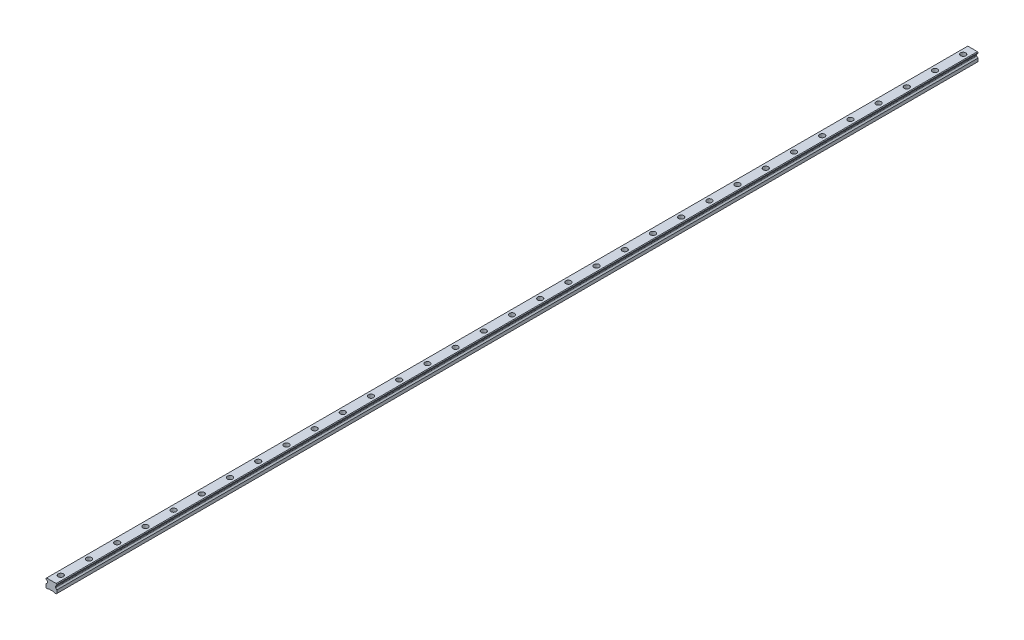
ISO-10303-21;
HEADER;
FILE_DESCRIPTION(('STEP AP214'),'2;1');
FILE_NAME('part.step','',(''),(''),'','','');
FILE_SCHEMA(('AUTOMOTIVE_DESIGN { 1 0 10303 214 1 1 1 1 }'));
ENDSEC;
DATA;
#1=APPLICATION_CONTEXT('core data for automotive mechanical design processes');
#2=APPLICATION_PROTOCOL_DEFINITION('international standard','automotive_design',2000,#1);
#3=PRODUCT_CONTEXT('',#1,'mechanical');
#4=PRODUCT('Part','Part','',(#3));
#5=PRODUCT_RELATED_PRODUCT_CATEGORY('part','',(#4));
#6=PRODUCT_DEFINITION_FORMATION('','',#4);
#7=PRODUCT_DEFINITION_CONTEXT('part definition',#1,'design');
#8=PRODUCT_DEFINITION('design','',#6,#7);
#9=PRODUCT_DEFINITION_SHAPE('','',#8);
#10=(LENGTH_UNIT() NAMED_UNIT(*) SI_UNIT(.MILLI.,.METRE.));
#11=(NAMED_UNIT(*) PLANE_ANGLE_UNIT() SI_UNIT($,.RADIAN.));
#12=(NAMED_UNIT(*) SI_UNIT($,.STERADIAN.) SOLID_ANGLE_UNIT());
#13=UNCERTAINTY_MEASURE_WITH_UNIT(LENGTH_MEASURE(1.E-05),#10,'distance_accuracy_value','');
#14=(GEOMETRIC_REPRESENTATION_CONTEXT(3) GLOBAL_UNCERTAINTY_ASSIGNED_CONTEXT((#13)) GLOBAL_UNIT_ASSIGNED_CONTEXT((#10,
#11,#12)) REPRESENTATION_CONTEXT('',''));
#15=CARTESIAN_POINT('',(0.,0.,0.));
#16=DIRECTION('',(0.,0.,1.));
#17=DIRECTION('',(1.,0.,0.));
#18=AXIS2_PLACEMENT_3D('',#15,#16,#17);
#19=CARTESIAN_POINT('',(0.,10.2,-960.));
#20=DIRECTION('',(0.,1.,0.));
#21=DIRECTION('',(0.,0.,1.));
#22=AXIS2_PLACEMENT_3D('',#19,#20,#21);
#23=PLANE('',#22);
#24=CARTESIAN_POINT('',(0.,10.2,-960.));
#25=DIRECTION('',(0.,1.,0.));
#26=DIRECTION('',(0.,0.,1.));
#27=AXIS2_PLACEMENT_3D('',#24,#25,#26);
#28=CIRCLE('',#27,3.5);
#29=CARTESIAN_POINT('',(0.,10.2,-956.5));
#30=VERTEX_POINT('',#29);
#31=EDGE_CURVE('E606',#30,#30,#28,.T.);
#32=ORIENTED_EDGE('',*,*,#31,.F.);
#33=EDGE_LOOP('',(#32));
#34=FACE_BOUND('',#33,.T.);
#35=CARTESIAN_POINT('',(0.,10.2,-960.));
#36=DIRECTION('',(0.,1.,0.));
#37=DIRECTION('',(0.,0.,1.));
#38=AXIS2_PLACEMENT_3D('',#35,#36,#37);
#39=CIRCLE('',#38,5.5);
#40=CARTESIAN_POINT('',(0.,10.2,-954.5));
#41=VERTEX_POINT('',#40);
#42=EDGE_CURVE('E11',#41,#41,#39,.T.);
#43=ORIENTED_EDGE('',*,*,#42,.T.);
#44=EDGE_LOOP('',(#43));
#45=FACE_BOUND('',#44,.T.);
#46=ADVANCED_FACE('F39',(#34,#45),#23,.T.);
#47=CARTESIAN_POINT('',(0.,10.2,-960.));
#48=DIRECTION('',(0.,1.,0.));
#49=DIRECTION('',(0.,0.,1.));
#50=AXIS2_PLACEMENT_3D('',#47,#48,#49);
#51=CYLINDRICAL_SURFACE('',#50,5.5);
#52=ORIENTED_EDGE('',*,*,#42,.F.);
#53=EDGE_LOOP('',(#52));
#54=FACE_BOUND('',#53,.T.);
#55=CARTESIAN_POINT('',(0.,19.2,-960.));
#56=DIRECTION('',(0.,1.,0.));
#57=DIRECTION('',(0.,0.,1.));
#58=AXIS2_PLACEMENT_3D('',#55,#56,#57);
#59=CIRCLE('',#58,5.5);
#60=CARTESIAN_POINT('',(0.,19.2,-954.5));
#61=VERTEX_POINT('',#60);
#62=EDGE_CURVE('E48',#61,#61,#59,.T.);
#63=ORIENTED_EDGE('',*,*,#62,.T.);
#64=EDGE_LOOP('',(#63));
#65=FACE_BOUND('',#64,.T.);
#66=ADVANCED_FACE('F1090',(#54,#65),#51,.F.);
#67=CARTESIAN_POINT('',(0.,10.2,-900.));
#68=DIRECTION('',(0.,1.,0.));
#69=DIRECTION('',(0.,0.,1.));
#70=AXIS2_PLACEMENT_3D('',#67,#68,#69);
#71=PLANE('',#70);
#72=CARTESIAN_POINT('',(0.,10.2,-900.));
#73=DIRECTION('',(0.,1.,0.));
#74=DIRECTION('',(0.,0.,1.));
#75=AXIS2_PLACEMENT_3D('',#72,#73,#74);
#76=CIRCLE('',#75,3.5);
#77=CARTESIAN_POINT('',(0.,10.2,-896.5));
#78=VERTEX_POINT('',#77);
#79=EDGE_CURVE('E611',#78,#78,#76,.T.);
#80=ORIENTED_EDGE('',*,*,#79,.F.);
#81=EDGE_LOOP('',(#80));
#82=FACE_BOUND('',#81,.T.);
#83=CARTESIAN_POINT('',(0.,10.2,-900.));
#84=DIRECTION('',(0.,1.,0.));
#85=DIRECTION('',(0.,0.,1.));
#86=AXIS2_PLACEMENT_3D('',#83,#84,#85);
#87=CIRCLE('',#86,5.5);
#88=CARTESIAN_POINT('',(0.,10.2,-894.5));
#89=VERTEX_POINT('',#88);
#90=EDGE_CURVE('E590',#89,#89,#87,.T.);
#91=ORIENTED_EDGE('',*,*,#90,.T.);
#92=EDGE_LOOP('',(#91));
#93=FACE_BOUND('',#92,.T.);
#94=ADVANCED_FACE('F1092',(#82,#93),#71,.T.);
#95=CARTESIAN_POINT('',(0.,10.2,-900.));
#96=DIRECTION('',(0.,1.,0.));
#97=DIRECTION('',(0.,0.,1.));
#98=AXIS2_PLACEMENT_3D('',#95,#96,#97);
#99=CYLINDRICAL_SURFACE('',#98,5.5);
#100=ORIENTED_EDGE('',*,*,#90,.F.);
#101=EDGE_LOOP('',(#100));
#102=FACE_BOUND('',#101,.T.);
#103=CARTESIAN_POINT('',(0.,19.2,-900.));
#104=DIRECTION('',(0.,1.,0.));
#105=DIRECTION('',(0.,0.,1.));
#106=AXIS2_PLACEMENT_3D('',#103,#104,#105);
#107=CIRCLE('',#106,5.5);
#108=CARTESIAN_POINT('',(0.,19.2,-894.5));
#109=VERTEX_POINT('',#108);
#110=EDGE_CURVE('E586',#109,#109,#107,.T.);
#111=ORIENTED_EDGE('',*,*,#110,.T.);
#112=EDGE_LOOP('',(#111));
#113=FACE_BOUND('',#112,.T.);
#114=ADVANCED_FACE('F1098',(#102,#113),#99,.F.);
#115=CARTESIAN_POINT('',(0.,10.2,-840.));
#116=DIRECTION('',(0.,1.,0.));
#117=DIRECTION('',(0.,0.,1.));
#118=AXIS2_PLACEMENT_3D('',#115,#116,#117);
#119=PLANE('',#118);
#120=CARTESIAN_POINT('',(0.,10.2,-840.));
#121=DIRECTION('',(0.,1.,0.));
#122=DIRECTION('',(0.,0.,1.));
#123=AXIS2_PLACEMENT_3D('',#120,#121,#122);
#124=CIRCLE('',#123,3.5);
#125=CARTESIAN_POINT('',(0.,10.2,-836.5));
#126=VERTEX_POINT('',#125);
#127=EDGE_CURVE('E616',#126,#126,#124,.T.);
#128=ORIENTED_EDGE('',*,*,#127,.F.);
#129=EDGE_LOOP('',(#128));
#130=FACE_BOUND('',#129,.T.);
#131=CARTESIAN_POINT('',(0.,10.2,-840.));
#132=DIRECTION('',(0.,1.,0.));
#133=DIRECTION('',(0.,0.,1.));
#134=AXIS2_PLACEMENT_3D('',#131,#132,#133);
#135=CIRCLE('',#134,5.5);
#136=CARTESIAN_POINT('',(0.,10.2,-834.5));
#137=VERTEX_POINT('',#136);
#138=EDGE_CURVE('E582',#137,#137,#135,.T.);
#139=ORIENTED_EDGE('',*,*,#138,.T.);
#140=EDGE_LOOP('',(#139));
#141=FACE_BOUND('',#140,.T.);
#142=ADVANCED_FACE('F1106',(#130,#141),#119,.T.);
#143=CARTESIAN_POINT('',(0.,10.2,-840.));
#144=DIRECTION('',(0.,1.,0.));
#145=DIRECTION('',(0.,0.,1.));
#146=AXIS2_PLACEMENT_3D('',#143,#144,#145);
#147=CYLINDRICAL_SURFACE('',#146,5.5);
#148=ORIENTED_EDGE('',*,*,#138,.F.);
#149=EDGE_LOOP('',(#148));
#150=FACE_BOUND('',#149,.T.);
#151=CARTESIAN_POINT('',(0.,19.2,-840.));
#152=DIRECTION('',(0.,1.,0.));
#153=DIRECTION('',(0.,0.,1.));
#154=AXIS2_PLACEMENT_3D('',#151,#152,#153);
#155=CIRCLE('',#154,5.5);
#156=CARTESIAN_POINT('',(0.,19.2,-834.5));
#157=VERTEX_POINT('',#156);
#158=EDGE_CURVE('E578',#157,#157,#155,.T.);
#159=ORIENTED_EDGE('',*,*,#158,.T.);
#160=EDGE_LOOP('',(#159));
#161=FACE_BOUND('',#160,.T.);
#162=ADVANCED_FACE('F1110',(#150,#161),#147,.F.);
#163=CARTESIAN_POINT('',(0.,10.2,-780.));
#164=DIRECTION('',(0.,1.,0.));
#165=DIRECTION('',(0.,0.,1.));
#166=AXIS2_PLACEMENT_3D('',#163,#164,#165);
#167=PLANE('',#166);
#168=CARTESIAN_POINT('',(0.,10.2,-780.));
#169=DIRECTION('',(0.,1.,0.));
#170=DIRECTION('',(0.,0.,1.));
#171=AXIS2_PLACEMENT_3D('',#168,#169,#170);
#172=CIRCLE('',#171,3.5);
#173=CARTESIAN_POINT('',(0.,10.2,-776.5));
#174=VERTEX_POINT('',#173);
#175=EDGE_CURVE('E621',#174,#174,#172,.T.);
#176=ORIENTED_EDGE('',*,*,#175,.F.);
#177=EDGE_LOOP('',(#176));
#178=FACE_BOUND('',#177,.T.);
#179=CARTESIAN_POINT('',(0.,10.2,-780.));
#180=DIRECTION('',(0.,1.,0.));
#181=DIRECTION('',(0.,0.,1.));
#182=AXIS2_PLACEMENT_3D('',#179,#180,#181);
#183=CIRCLE('',#182,5.5);
#184=CARTESIAN_POINT('',(0.,10.2,-774.5));
#185=VERTEX_POINT('',#184);
#186=EDGE_CURVE('E574',#185,#185,#183,.T.);
#187=ORIENTED_EDGE('',*,*,#186,.T.);
#188=EDGE_LOOP('',(#187));
#189=FACE_BOUND('',#188,.T.);
#190=ADVANCED_FACE('F1114',(#178,#189),#167,.T.);
#191=CARTESIAN_POINT('',(0.,10.2,-780.));
#192=DIRECTION('',(0.,1.,0.));
#193=DIRECTION('',(0.,0.,1.));
#194=AXIS2_PLACEMENT_3D('',#191,#192,#193);
#195=CYLINDRICAL_SURFACE('',#194,5.5);
#196=ORIENTED_EDGE('',*,*,#186,.F.);
#197=EDGE_LOOP('',(#196));
#198=FACE_BOUND('',#197,.T.);
#199=CARTESIAN_POINT('',(0.,19.2,-780.));
#200=DIRECTION('',(0.,1.,0.));
#201=DIRECTION('',(0.,0.,1.));
#202=AXIS2_PLACEMENT_3D('',#199,#200,#201);
#203=CIRCLE('',#202,5.5);
#204=CARTESIAN_POINT('',(0.,19.2,-774.5));
#205=VERTEX_POINT('',#204);
#206=EDGE_CURVE('E570',#205,#205,#203,.T.);
#207=ORIENTED_EDGE('',*,*,#206,.T.);
#208=EDGE_LOOP('',(#207));
#209=FACE_BOUND('',#208,.T.);
#210=ADVANCED_FACE('F1118',(#198,#209),#195,.F.);
#211=CARTESIAN_POINT('',(0.,10.2,-720.));
#212=DIRECTION('',(0.,1.,0.));
#213=DIRECTION('',(0.,0.,1.));
#214=AXIS2_PLACEMENT_3D('',#211,#212,#213);
#215=PLANE('',#214);
#216=CARTESIAN_POINT('',(0.,10.2,-720.));
#217=DIRECTION('',(0.,1.,0.));
#218=DIRECTION('',(0.,0.,1.));
#219=AXIS2_PLACEMENT_3D('',#216,#217,#218);
#220=CIRCLE('',#219,3.5);
#221=CARTESIAN_POINT('',(0.,10.2,-716.5));
#222=VERTEX_POINT('',#221);
#223=EDGE_CURVE('E626',#222,#222,#220,.T.);
#224=ORIENTED_EDGE('',*,*,#223,.F.);
#225=EDGE_LOOP('',(#224));
#226=FACE_BOUND('',#225,.T.);
#227=CARTESIAN_POINT('',(0.,10.2,-720.));
#228=DIRECTION('',(0.,1.,0.));
#229=DIRECTION('',(0.,0.,1.));
#230=AXIS2_PLACEMENT_3D('',#227,#228,#229);
#231=CIRCLE('',#230,5.5);
#232=CARTESIAN_POINT('',(0.,10.2,-714.5));
#233=VERTEX_POINT('',#232);
#234=EDGE_CURVE('E566',#233,#233,#231,.T.);
#235=ORIENTED_EDGE('',*,*,#234,.T.);
#236=EDGE_LOOP('',(#235));
#237=FACE_BOUND('',#236,.T.);
#238=ADVANCED_FACE('F1122',(#226,#237),#215,.T.);
#239=CARTESIAN_POINT('',(0.,10.2,-720.));
#240=DIRECTION('',(0.,1.,0.));
#241=DIRECTION('',(0.,0.,1.));
#242=AXIS2_PLACEMENT_3D('',#239,#240,#241);
#243=CYLINDRICAL_SURFACE('',#242,5.5);
#244=ORIENTED_EDGE('',*,*,#234,.F.);
#245=EDGE_LOOP('',(#244));
#246=FACE_BOUND('',#245,.T.);
#247=CARTESIAN_POINT('',(0.,19.2,-720.));
#248=DIRECTION('',(0.,1.,0.));
#249=DIRECTION('',(0.,0.,1.));
#250=AXIS2_PLACEMENT_3D('',#247,#248,#249);
#251=CIRCLE('',#250,5.5);
#252=CARTESIAN_POINT('',(0.,19.2,-714.5));
#253=VERTEX_POINT('',#252);
#254=EDGE_CURVE('E562',#253,#253,#251,.T.);
#255=ORIENTED_EDGE('',*,*,#254,.T.);
#256=EDGE_LOOP('',(#255));
#257=FACE_BOUND('',#256,.T.);
#258=ADVANCED_FACE('F1126',(#246,#257),#243,.F.);
#259=CARTESIAN_POINT('',(0.,10.2,-660.));
#260=DIRECTION('',(0.,1.,0.));
#261=DIRECTION('',(0.,0.,1.));
#262=AXIS2_PLACEMENT_3D('',#259,#260,#261);
#263=PLANE('',#262);
#264=CARTESIAN_POINT('',(0.,10.2,-660.));
#265=DIRECTION('',(0.,1.,0.));
#266=DIRECTION('',(0.,0.,1.));
#267=AXIS2_PLACEMENT_3D('',#264,#265,#266);
#268=CIRCLE('',#267,3.5);
#269=CARTESIAN_POINT('',(0.,10.2,-656.5));
#270=VERTEX_POINT('',#269);
#271=EDGE_CURVE('E631',#270,#270,#268,.T.);
#272=ORIENTED_EDGE('',*,*,#271,.F.);
#273=EDGE_LOOP('',(#272));
#274=FACE_BOUND('',#273,.T.);
#275=CARTESIAN_POINT('',(0.,10.2,-660.));
#276=DIRECTION('',(0.,1.,0.));
#277=DIRECTION('',(0.,0.,1.));
#278=AXIS2_PLACEMENT_3D('',#275,#276,#277);
#279=CIRCLE('',#278,5.5);
#280=CARTESIAN_POINT('',(0.,10.2,-654.5));
#281=VERTEX_POINT('',#280);
#282=EDGE_CURVE('E558',#281,#281,#279,.T.);
#283=ORIENTED_EDGE('',*,*,#282,.T.);
#284=EDGE_LOOP('',(#283));
#285=FACE_BOUND('',#284,.T.);
#286=ADVANCED_FACE('F1130',(#274,#285),#263,.T.);
#287=CARTESIAN_POINT('',(0.,10.2,-660.));
#288=DIRECTION('',(0.,1.,0.));
#289=DIRECTION('',(0.,0.,1.));
#290=AXIS2_PLACEMENT_3D('',#287,#288,#289);
#291=CYLINDRICAL_SURFACE('',#290,5.5);
#292=ORIENTED_EDGE('',*,*,#282,.F.);
#293=EDGE_LOOP('',(#292));
#294=FACE_BOUND('',#293,.T.);
#295=CARTESIAN_POINT('',(0.,19.2,-660.));
#296=DIRECTION('',(0.,1.,0.));
#297=DIRECTION('',(0.,0.,1.));
#298=AXIS2_PLACEMENT_3D('',#295,#296,#297);
#299=CIRCLE('',#298,5.5);
#300=CARTESIAN_POINT('',(0.,19.2,-654.5));
#301=VERTEX_POINT('',#300);
#302=EDGE_CURVE('E554',#301,#301,#299,.T.);
#303=ORIENTED_EDGE('',*,*,#302,.T.);
#304=EDGE_LOOP('',(#303));
#305=FACE_BOUND('',#304,.T.);
#306=ADVANCED_FACE('F1134',(#294,#305),#291,.F.);
#307=CARTESIAN_POINT('',(0.,10.2,-600.));
#308=DIRECTION('',(0.,1.,0.));
#309=DIRECTION('',(0.,0.,1.));
#310=AXIS2_PLACEMENT_3D('',#307,#308,#309);
#311=PLANE('',#310);
#312=CARTESIAN_POINT('',(0.,10.2,-600.));
#313=DIRECTION('',(0.,1.,0.));
#314=DIRECTION('',(0.,0.,1.));
#315=AXIS2_PLACEMENT_3D('',#312,#313,#314);
#316=CIRCLE('',#315,3.5);
#317=CARTESIAN_POINT('',(0.,10.2,-596.5));
#318=VERTEX_POINT('',#317);
#319=EDGE_CURVE('E636',#318,#318,#316,.T.);
#320=ORIENTED_EDGE('',*,*,#319,.F.);
#321=EDGE_LOOP('',(#320));
#322=FACE_BOUND('',#321,.T.);
#323=CARTESIAN_POINT('',(0.,10.2,-600.));
#324=DIRECTION('',(0.,1.,0.));
#325=DIRECTION('',(0.,0.,1.));
#326=AXIS2_PLACEMENT_3D('',#323,#324,#325);
#327=CIRCLE('',#326,5.5);
#328=CARTESIAN_POINT('',(0.,10.2,-594.5));
#329=VERTEX_POINT('',#328);
#330=EDGE_CURVE('E550',#329,#329,#327,.T.);
#331=ORIENTED_EDGE('',*,*,#330,.T.);
#332=EDGE_LOOP('',(#331));
#333=FACE_BOUND('',#332,.T.);
#334=ADVANCED_FACE('F1138',(#322,#333),#311,.T.);
#335=CARTESIAN_POINT('',(0.,10.2,-600.));
#336=DIRECTION('',(0.,1.,0.));
#337=DIRECTION('',(0.,0.,1.));
#338=AXIS2_PLACEMENT_3D('',#335,#336,#337);
#339=CYLINDRICAL_SURFACE('',#338,5.5);
#340=ORIENTED_EDGE('',*,*,#330,.F.);
#341=EDGE_LOOP('',(#340));
#342=FACE_BOUND('',#341,.T.);
#343=CARTESIAN_POINT('',(0.,19.2,-600.));
#344=DIRECTION('',(0.,1.,0.));
#345=DIRECTION('',(0.,0.,1.));
#346=AXIS2_PLACEMENT_3D('',#343,#344,#345);
#347=CIRCLE('',#346,5.5);
#348=CARTESIAN_POINT('',(0.,19.2,-594.5));
#349=VERTEX_POINT('',#348);
#350=EDGE_CURVE('E546',#349,#349,#347,.T.);
#351=ORIENTED_EDGE('',*,*,#350,.T.);
#352=EDGE_LOOP('',(#351));
#353=FACE_BOUND('',#352,.T.);
#354=ADVANCED_FACE('F1142',(#342,#353),#339,.F.);
#355=CARTESIAN_POINT('',(0.,10.2,-540.));
#356=DIRECTION('',(0.,1.,0.));
#357=DIRECTION('',(0.,0.,1.));
#358=AXIS2_PLACEMENT_3D('',#355,#356,#357);
#359=PLANE('',#358);
#360=CARTESIAN_POINT('',(0.,10.2,-540.));
#361=DIRECTION('',(0.,1.,0.));
#362=DIRECTION('',(0.,0.,1.));
#363=AXIS2_PLACEMENT_3D('',#360,#361,#362);
#364=CIRCLE('',#363,3.5);
#365=CARTESIAN_POINT('',(0.,10.2,-536.5));
#366=VERTEX_POINT('',#365);
#367=EDGE_CURVE('E641',#366,#366,#364,.T.);
#368=ORIENTED_EDGE('',*,*,#367,.F.);
#369=EDGE_LOOP('',(#368));
#370=FACE_BOUND('',#369,.T.);
#371=CARTESIAN_POINT('',(0.,10.2,-540.));
#372=DIRECTION('',(0.,1.,0.));
#373=DIRECTION('',(0.,0.,1.));
#374=AXIS2_PLACEMENT_3D('',#371,#372,#373);
#375=CIRCLE('',#374,5.5);
#376=CARTESIAN_POINT('',(0.,10.2,-534.5));
#377=VERTEX_POINT('',#376);
#378=EDGE_CURVE('E542',#377,#377,#375,.T.);
#379=ORIENTED_EDGE('',*,*,#378,.T.);
#380=EDGE_LOOP('',(#379));
#381=FACE_BOUND('',#380,.T.);
#382=ADVANCED_FACE('F1146',(#370,#381),#359,.T.);
#383=CARTESIAN_POINT('',(0.,10.2,-540.));
#384=DIRECTION('',(0.,1.,0.));
#385=DIRECTION('',(0.,0.,1.));
#386=AXIS2_PLACEMENT_3D('',#383,#384,#385);
#387=CYLINDRICAL_SURFACE('',#386,5.5);
#388=ORIENTED_EDGE('',*,*,#378,.F.);
#389=EDGE_LOOP('',(#388));
#390=FACE_BOUND('',#389,.T.);
#391=CARTESIAN_POINT('',(0.,19.2,-540.));
#392=DIRECTION('',(0.,1.,0.));
#393=DIRECTION('',(0.,0.,1.));
#394=AXIS2_PLACEMENT_3D('',#391,#392,#393);
#395=CIRCLE('',#394,5.5);
#396=CARTESIAN_POINT('',(0.,19.2,-534.5));
#397=VERTEX_POINT('',#396);
#398=EDGE_CURVE('E538',#397,#397,#395,.T.);
#399=ORIENTED_EDGE('',*,*,#398,.T.);
#400=EDGE_LOOP('',(#399));
#401=FACE_BOUND('',#400,.T.);
#402=ADVANCED_FACE('F1150',(#390,#401),#387,.F.);
#403=CARTESIAN_POINT('',(0.,10.2,-480.));
#404=DIRECTION('',(0.,1.,0.));
#405=DIRECTION('',(0.,0.,1.));
#406=AXIS2_PLACEMENT_3D('',#403,#404,#405);
#407=PLANE('',#406);
#408=CARTESIAN_POINT('',(0.,10.2,-480.));
#409=DIRECTION('',(0.,1.,0.));
#410=DIRECTION('',(0.,0.,1.));
#411=AXIS2_PLACEMENT_3D('',#408,#409,#410);
#412=CIRCLE('',#411,3.5);
#413=CARTESIAN_POINT('',(0.,10.2,-476.5));
#414=VERTEX_POINT('',#413);
#415=EDGE_CURVE('E646',#414,#414,#412,.T.);
#416=ORIENTED_EDGE('',*,*,#415,.F.);
#417=EDGE_LOOP('',(#416));
#418=FACE_BOUND('',#417,.T.);
#419=CARTESIAN_POINT('',(0.,10.2,-480.));
#420=DIRECTION('',(0.,1.,0.));
#421=DIRECTION('',(0.,0.,1.));
#422=AXIS2_PLACEMENT_3D('',#419,#420,#421);
#423=CIRCLE('',#422,5.5);
#424=CARTESIAN_POINT('',(0.,10.2,-474.5));
#425=VERTEX_POINT('',#424);
#426=EDGE_CURVE('E534',#425,#425,#423,.T.);
#427=ORIENTED_EDGE('',*,*,#426,.T.);
#428=EDGE_LOOP('',(#427));
#429=FACE_BOUND('',#428,.T.);
#430=ADVANCED_FACE('F1154',(#418,#429),#407,.T.);
#431=CARTESIAN_POINT('',(0.,10.2,-480.));
#432=DIRECTION('',(0.,1.,0.));
#433=DIRECTION('',(0.,0.,1.));
#434=AXIS2_PLACEMENT_3D('',#431,#432,#433);
#435=CYLINDRICAL_SURFACE('',#434,5.5);
#436=ORIENTED_EDGE('',*,*,#426,.F.);
#437=EDGE_LOOP('',(#436));
#438=FACE_BOUND('',#437,.T.);
#439=CARTESIAN_POINT('',(0.,19.2,-480.));
#440=DIRECTION('',(0.,1.,0.));
#441=DIRECTION('',(0.,0.,1.));
#442=AXIS2_PLACEMENT_3D('',#439,#440,#441);
#443=CIRCLE('',#442,5.5);
#444=CARTESIAN_POINT('',(0.,19.2,-474.5));
#445=VERTEX_POINT('',#444);
#446=EDGE_CURVE('E530',#445,#445,#443,.T.);
#447=ORIENTED_EDGE('',*,*,#446,.T.);
#448=EDGE_LOOP('',(#447));
#449=FACE_BOUND('',#448,.T.);
#450=ADVANCED_FACE('F1158',(#438,#449),#435,.F.);
#451=CARTESIAN_POINT('',(0.,10.2,-420.));
#452=DIRECTION('',(0.,1.,0.));
#453=DIRECTION('',(0.,0.,1.));
#454=AXIS2_PLACEMENT_3D('',#451,#452,#453);
#455=PLANE('',#454);
#456=CARTESIAN_POINT('',(0.,10.2,-420.));
#457=DIRECTION('',(0.,1.,0.));
#458=DIRECTION('',(0.,0.,1.));
#459=AXIS2_PLACEMENT_3D('',#456,#457,#458);
#460=CIRCLE('',#459,3.5);
#461=CARTESIAN_POINT('',(0.,10.2,-416.5));
#462=VERTEX_POINT('',#461);
#463=EDGE_CURVE('E651',#462,#462,#460,.T.);
#464=ORIENTED_EDGE('',*,*,#463,.F.);
#465=EDGE_LOOP('',(#464));
#466=FACE_BOUND('',#465,.T.);
#467=CARTESIAN_POINT('',(0.,10.2,-420.));
#468=DIRECTION('',(0.,1.,0.));
#469=DIRECTION('',(0.,0.,1.));
#470=AXIS2_PLACEMENT_3D('',#467,#468,#469);
#471=CIRCLE('',#470,5.5);
#472=CARTESIAN_POINT('',(0.,10.2,-414.5));
#473=VERTEX_POINT('',#472);
#474=EDGE_CURVE('E526',#473,#473,#471,.T.);
#475=ORIENTED_EDGE('',*,*,#474,.T.);
#476=EDGE_LOOP('',(#475));
#477=FACE_BOUND('',#476,.T.);
#478=ADVANCED_FACE('F1162',(#466,#477),#455,.T.);
#479=CARTESIAN_POINT('',(0.,10.2,-420.));
#480=DIRECTION('',(0.,1.,0.));
#481=DIRECTION('',(0.,0.,1.));
#482=AXIS2_PLACEMENT_3D('',#479,#480,#481);
#483=CYLINDRICAL_SURFACE('',#482,5.5);
#484=ORIENTED_EDGE('',*,*,#474,.F.);
#485=EDGE_LOOP('',(#484));
#486=FACE_BOUND('',#485,.T.);
#487=CARTESIAN_POINT('',(0.,19.2,-420.));
#488=DIRECTION('',(0.,1.,0.));
#489=DIRECTION('',(0.,0.,1.));
#490=AXIS2_PLACEMENT_3D('',#487,#488,#489);
#491=CIRCLE('',#490,5.5);
#492=CARTESIAN_POINT('',(0.,19.2,-414.5));
#493=VERTEX_POINT('',#492);
#494=EDGE_CURVE('E522',#493,#493,#491,.T.);
#495=ORIENTED_EDGE('',*,*,#494,.T.);
#496=EDGE_LOOP('',(#495));
#497=FACE_BOUND('',#496,.T.);
#498=ADVANCED_FACE('F1166',(#486,#497),#483,.F.);
#499=CARTESIAN_POINT('',(0.,10.2,-360.));
#500=DIRECTION('',(0.,1.,0.));
#501=DIRECTION('',(0.,0.,1.));
#502=AXIS2_PLACEMENT_3D('',#499,#500,#501);
#503=PLANE('',#502);
#504=CARTESIAN_POINT('',(0.,10.2,-360.));
#505=DIRECTION('',(0.,1.,0.));
#506=DIRECTION('',(0.,0.,1.));
#507=AXIS2_PLACEMENT_3D('',#504,#505,#506);
#508=CIRCLE('',#507,3.5);
#509=CARTESIAN_POINT('',(0.,10.2,-356.5));
#510=VERTEX_POINT('',#509);
#511=EDGE_CURVE('E656',#510,#510,#508,.T.);
#512=ORIENTED_EDGE('',*,*,#511,.F.);
#513=EDGE_LOOP('',(#512));
#514=FACE_BOUND('',#513,.T.);
#515=CARTESIAN_POINT('',(0.,10.2,-360.));
#516=DIRECTION('',(0.,1.,0.));
#517=DIRECTION('',(0.,0.,1.));
#518=AXIS2_PLACEMENT_3D('',#515,#516,#517);
#519=CIRCLE('',#518,5.5);
#520=CARTESIAN_POINT('',(0.,10.2,-354.5));
#521=VERTEX_POINT('',#520);
#522=EDGE_CURVE('E518',#521,#521,#519,.T.);
#523=ORIENTED_EDGE('',*,*,#522,.T.);
#524=EDGE_LOOP('',(#523));
#525=FACE_BOUND('',#524,.T.);
#526=ADVANCED_FACE('F1170',(#514,#525),#503,.T.);
#527=CARTESIAN_POINT('',(0.,10.2,-360.));
#528=DIRECTION('',(0.,1.,0.));
#529=DIRECTION('',(0.,0.,1.));
#530=AXIS2_PLACEMENT_3D('',#527,#528,#529);
#531=CYLINDRICAL_SURFACE('',#530,5.5);
#532=ORIENTED_EDGE('',*,*,#522,.F.);
#533=EDGE_LOOP('',(#532));
#534=FACE_BOUND('',#533,.T.);
#535=CARTESIAN_POINT('',(0.,19.2,-360.));
#536=DIRECTION('',(0.,1.,0.));
#537=DIRECTION('',(0.,0.,1.));
#538=AXIS2_PLACEMENT_3D('',#535,#536,#537);
#539=CIRCLE('',#538,5.5);
#540=CARTESIAN_POINT('',(0.,19.2,-354.5));
#541=VERTEX_POINT('',#540);
#542=EDGE_CURVE('E514',#541,#541,#539,.T.);
#543=ORIENTED_EDGE('',*,*,#542,.T.);
#544=EDGE_LOOP('',(#543));
#545=FACE_BOUND('',#544,.T.);
#546=ADVANCED_FACE('F1174',(#534,#545),#531,.F.);
#547=CARTESIAN_POINT('',(0.,10.2,-300.));
#548=DIRECTION('',(0.,1.,0.));
#549=DIRECTION('',(0.,0.,1.));
#550=AXIS2_PLACEMENT_3D('',#547,#548,#549);
#551=PLANE('',#550);
#552=CARTESIAN_POINT('',(0.,10.2,-300.));
#553=DIRECTION('',(0.,1.,0.));
#554=DIRECTION('',(0.,0.,1.));
#555=AXIS2_PLACEMENT_3D('',#552,#553,#554);
#556=CIRCLE('',#555,3.5);
#557=CARTESIAN_POINT('',(0.,10.2,-296.5));
#558=VERTEX_POINT('',#557);
#559=EDGE_CURVE('E661',#558,#558,#556,.T.);
#560=ORIENTED_EDGE('',*,*,#559,.F.);
#561=EDGE_LOOP('',(#560));
#562=FACE_BOUND('',#561,.T.);
#563=CARTESIAN_POINT('',(0.,10.2,-300.));
#564=DIRECTION('',(0.,1.,0.));
#565=DIRECTION('',(0.,0.,1.));
#566=AXIS2_PLACEMENT_3D('',#563,#564,#565);
#567=CIRCLE('',#566,5.5);
#568=CARTESIAN_POINT('',(0.,10.2,-294.5));
#569=VERTEX_POINT('',#568);
#570=EDGE_CURVE('E510',#569,#569,#567,.T.);
#571=ORIENTED_EDGE('',*,*,#570,.T.);
#572=EDGE_LOOP('',(#571));
#573=FACE_BOUND('',#572,.T.);
#574=ADVANCED_FACE('F1178',(#562,#573),#551,.T.);
#575=CARTESIAN_POINT('',(0.,10.2,-300.));
#576=DIRECTION('',(0.,1.,0.));
#577=DIRECTION('',(0.,0.,1.));
#578=AXIS2_PLACEMENT_3D('',#575,#576,#577);
#579=CYLINDRICAL_SURFACE('',#578,5.5);
#580=ORIENTED_EDGE('',*,*,#570,.F.);
#581=EDGE_LOOP('',(#580));
#582=FACE_BOUND('',#581,.T.);
#583=CARTESIAN_POINT('',(0.,19.2,-300.));
#584=DIRECTION('',(0.,1.,0.));
#585=DIRECTION('',(0.,0.,1.));
#586=AXIS2_PLACEMENT_3D('',#583,#584,#585);
#587=CIRCLE('',#586,5.5);
#588=CARTESIAN_POINT('',(0.,19.2,-294.5));
#589=VERTEX_POINT('',#588);
#590=EDGE_CURVE('E506',#589,#589,#587,.T.);
#591=ORIENTED_EDGE('',*,*,#590,.T.);
#592=EDGE_LOOP('',(#591));
#593=FACE_BOUND('',#592,.T.);
#594=ADVANCED_FACE('F1182',(#582,#593),#579,.F.);
#595=CARTESIAN_POINT('',(0.,10.2,-240.));
#596=DIRECTION('',(0.,1.,0.));
#597=DIRECTION('',(0.,0.,1.));
#598=AXIS2_PLACEMENT_3D('',#595,#596,#597);
#599=PLANE('',#598);
#600=CARTESIAN_POINT('',(0.,10.2,-240.));
#601=DIRECTION('',(0.,1.,0.));
#602=DIRECTION('',(0.,0.,1.));
#603=AXIS2_PLACEMENT_3D('',#600,#601,#602);
#604=CIRCLE('',#603,3.5);
#605=CARTESIAN_POINT('',(0.,10.2,-236.5));
#606=VERTEX_POINT('',#605);
#607=EDGE_CURVE('E666',#606,#606,#604,.T.);
#608=ORIENTED_EDGE('',*,*,#607,.F.);
#609=EDGE_LOOP('',(#608));
#610=FACE_BOUND('',#609,.T.);
#611=CARTESIAN_POINT('',(0.,10.2,-240.));
#612=DIRECTION('',(0.,1.,0.));
#613=DIRECTION('',(0.,0.,1.));
#614=AXIS2_PLACEMENT_3D('',#611,#612,#613);
#615=CIRCLE('',#614,5.5);
#616=CARTESIAN_POINT('',(0.,10.2,-234.5));
#617=VERTEX_POINT('',#616);
#618=EDGE_CURVE('E502',#617,#617,#615,.T.);
#619=ORIENTED_EDGE('',*,*,#618,.T.);
#620=EDGE_LOOP('',(#619));
#621=FACE_BOUND('',#620,.T.);
#622=ADVANCED_FACE('F1186',(#610,#621),#599,.T.);
#623=CARTESIAN_POINT('',(0.,10.2,-240.));
#624=DIRECTION('',(0.,1.,0.));
#625=DIRECTION('',(0.,0.,1.));
#626=AXIS2_PLACEMENT_3D('',#623,#624,#625);
#627=CYLINDRICAL_SURFACE('',#626,5.5);
#628=ORIENTED_EDGE('',*,*,#618,.F.);
#629=EDGE_LOOP('',(#628));
#630=FACE_BOUND('',#629,.T.);
#631=CARTESIAN_POINT('',(0.,19.2,-240.));
#632=DIRECTION('',(0.,1.,0.));
#633=DIRECTION('',(0.,0.,1.));
#634=AXIS2_PLACEMENT_3D('',#631,#632,#633);
#635=CIRCLE('',#634,5.5);
#636=CARTESIAN_POINT('',(0.,19.2,-234.5));
#637=VERTEX_POINT('',#636);
#638=EDGE_CURVE('E498',#637,#637,#635,.T.);
#639=ORIENTED_EDGE('',*,*,#638,.T.);
#640=EDGE_LOOP('',(#639));
#641=FACE_BOUND('',#640,.T.);
#642=ADVANCED_FACE('F1190',(#630,#641),#627,.F.);
#643=CARTESIAN_POINT('',(0.,10.2,-180.));
#644=DIRECTION('',(0.,1.,0.));
#645=DIRECTION('',(0.,0.,1.));
#646=AXIS2_PLACEMENT_3D('',#643,#644,#645);
#647=PLANE('',#646);
#648=CARTESIAN_POINT('',(0.,10.2,-180.));
#649=DIRECTION('',(0.,1.,0.));
#650=DIRECTION('',(0.,0.,1.));
#651=AXIS2_PLACEMENT_3D('',#648,#649,#650);
#652=CIRCLE('',#651,3.5);
#653=CARTESIAN_POINT('',(0.,10.2,-176.5));
#654=VERTEX_POINT('',#653);
#655=EDGE_CURVE('E671',#654,#654,#652,.T.);
#656=ORIENTED_EDGE('',*,*,#655,.F.);
#657=EDGE_LOOP('',(#656));
#658=FACE_BOUND('',#657,.T.);
#659=CARTESIAN_POINT('',(0.,10.2,-180.));
#660=DIRECTION('',(0.,1.,0.));
#661=DIRECTION('',(0.,0.,1.));
#662=AXIS2_PLACEMENT_3D('',#659,#660,#661);
#663=CIRCLE('',#662,5.5);
#664=CARTESIAN_POINT('',(0.,10.2,-174.5));
#665=VERTEX_POINT('',#664);
#666=EDGE_CURVE('E494',#665,#665,#663,.T.);
#667=ORIENTED_EDGE('',*,*,#666,.T.);
#668=EDGE_LOOP('',(#667));
#669=FACE_BOUND('',#668,.T.);
#670=ADVANCED_FACE('F1194',(#658,#669),#647,.T.);
#671=CARTESIAN_POINT('',(0.,10.2,-180.));
#672=DIRECTION('',(0.,1.,0.));
#673=DIRECTION('',(0.,0.,1.));
#674=AXIS2_PLACEMENT_3D('',#671,#672,#673);
#675=CYLINDRICAL_SURFACE('',#674,5.5);
#676=ORIENTED_EDGE('',*,*,#666,.F.);
#677=EDGE_LOOP('',(#676));
#678=FACE_BOUND('',#677,.T.);
#679=CARTESIAN_POINT('',(0.,19.2,-180.));
#680=DIRECTION('',(0.,1.,0.));
#681=DIRECTION('',(0.,0.,1.));
#682=AXIS2_PLACEMENT_3D('',#679,#680,#681);
#683=CIRCLE('',#682,5.5);
#684=CARTESIAN_POINT('',(0.,19.2,-174.5));
#685=VERTEX_POINT('',#684);
#686=EDGE_CURVE('E490',#685,#685,#683,.T.);
#687=ORIENTED_EDGE('',*,*,#686,.T.);
#688=EDGE_LOOP('',(#687));
#689=FACE_BOUND('',#688,.T.);
#690=ADVANCED_FACE('F1198',(#678,#689),#675,.F.);
#691=CARTESIAN_POINT('',(0.,10.2,-120.));
#692=DIRECTION('',(0.,1.,0.));
#693=DIRECTION('',(0.,0.,1.));
#694=AXIS2_PLACEMENT_3D('',#691,#692,#693);
#695=PLANE('',#694);
#696=CARTESIAN_POINT('',(0.,10.2,-120.));
#697=DIRECTION('',(0.,1.,0.));
#698=DIRECTION('',(0.,0.,1.));
#699=AXIS2_PLACEMENT_3D('',#696,#697,#698);
#700=CIRCLE('',#699,3.5);
#701=CARTESIAN_POINT('',(0.,10.2,-116.5));
#702=VERTEX_POINT('',#701);
#703=EDGE_CURVE('E676',#702,#702,#700,.T.);
#704=ORIENTED_EDGE('',*,*,#703,.F.);
#705=EDGE_LOOP('',(#704));
#706=FACE_BOUND('',#705,.T.);
#707=CARTESIAN_POINT('',(0.,10.2,-120.));
#708=DIRECTION('',(0.,1.,0.));
#709=DIRECTION('',(0.,0.,1.));
#710=AXIS2_PLACEMENT_3D('',#707,#708,#709);
#711=CIRCLE('',#710,5.5);
#712=CARTESIAN_POINT('',(0.,10.2,-114.5));
#713=VERTEX_POINT('',#712);
#714=EDGE_CURVE('E486',#713,#713,#711,.T.);
#715=ORIENTED_EDGE('',*,*,#714,.T.);
#716=EDGE_LOOP('',(#715));
#717=FACE_BOUND('',#716,.T.);
#718=ADVANCED_FACE('F1202',(#706,#717),#695,.T.);
#719=CARTESIAN_POINT('',(0.,10.2,-120.));
#720=DIRECTION('',(0.,1.,0.));
#721=DIRECTION('',(0.,0.,1.));
#722=AXIS2_PLACEMENT_3D('',#719,#720,#721);
#723=CYLINDRICAL_SURFACE('',#722,5.5);
#724=ORIENTED_EDGE('',*,*,#714,.F.);
#725=EDGE_LOOP('',(#724));
#726=FACE_BOUND('',#725,.T.);
#727=CARTESIAN_POINT('',(0.,19.2,-120.));
#728=DIRECTION('',(0.,1.,0.));
#729=DIRECTION('',(0.,0.,1.));
#730=AXIS2_PLACEMENT_3D('',#727,#728,#729);
#731=CIRCLE('',#730,5.5);
#732=CARTESIAN_POINT('',(0.,19.2,-114.5));
#733=VERTEX_POINT('',#732);
#734=EDGE_CURVE('E482',#733,#733,#731,.T.);
#735=ORIENTED_EDGE('',*,*,#734,.T.);
#736=EDGE_LOOP('',(#735));
#737=FACE_BOUND('',#736,.T.);
#738=ADVANCED_FACE('F1206',(#726,#737),#723,.F.);
#739=CARTESIAN_POINT('',(0.,10.2,-60.0000000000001));
#740=DIRECTION('',(0.,1.,0.));
#741=DIRECTION('',(0.,0.,1.));
#742=AXIS2_PLACEMENT_3D('',#739,#740,#741);
#743=PLANE('',#742);
#744=CARTESIAN_POINT('',(0.,10.2,-60.0000000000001));
#745=DIRECTION('',(0.,1.,0.));
#746=DIRECTION('',(0.,0.,1.));
#747=AXIS2_PLACEMENT_3D('',#744,#745,#746);
#748=CIRCLE('',#747,3.5);
#749=CARTESIAN_POINT('',(0.,10.2,-56.5));
#750=VERTEX_POINT('',#749);
#751=EDGE_CURVE('E681',#750,#750,#748,.T.);
#752=ORIENTED_EDGE('',*,*,#751,.F.);
#753=EDGE_LOOP('',(#752));
#754=FACE_BOUND('',#753,.T.);
#755=CARTESIAN_POINT('',(0.,10.2,-60.0000000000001));
#756=DIRECTION('',(0.,1.,0.));
#757=DIRECTION('',(0.,0.,1.));
#758=AXIS2_PLACEMENT_3D('',#755,#756,#757);
#759=CIRCLE('',#758,5.5);
#760=CARTESIAN_POINT('',(0.,10.2,-54.5000000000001));
#761=VERTEX_POINT('',#760);
#762=EDGE_CURVE('E478',#761,#761,#759,.T.);
#763=ORIENTED_EDGE('',*,*,#762,.T.);
#764=EDGE_LOOP('',(#763));
#765=FACE_BOUND('',#764,.T.);
#766=ADVANCED_FACE('F1210',(#754,#765),#743,.T.);
#767=CARTESIAN_POINT('',(0.,10.2,-60.0000000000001));
#768=DIRECTION('',(0.,1.,0.));
#769=DIRECTION('',(0.,0.,1.));
#770=AXIS2_PLACEMENT_3D('',#767,#768,#769);
#771=CYLINDRICAL_SURFACE('',#770,5.5);
#772=ORIENTED_EDGE('',*,*,#762,.F.);
#773=EDGE_LOOP('',(#772));
#774=FACE_BOUND('',#773,.T.);
#775=CARTESIAN_POINT('',(0.,19.2,-60.0000000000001));
#776=DIRECTION('',(0.,1.,0.));
#777=DIRECTION('',(0.,0.,1.));
#778=AXIS2_PLACEMENT_3D('',#775,#776,#777);
#779=CIRCLE('',#778,5.5);
#780=CARTESIAN_POINT('',(0.,19.2,-54.5000000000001));
#781=VERTEX_POINT('',#780);
#782=EDGE_CURVE('E474',#781,#781,#779,.T.);
#783=ORIENTED_EDGE('',*,*,#782,.T.);
#784=EDGE_LOOP('',(#783));
#785=FACE_BOUND('',#784,.T.);
#786=ADVANCED_FACE('F1214',(#774,#785),#771,.F.);
#787=CARTESIAN_POINT('',(0.,10.2,0.));
#788=DIRECTION('',(0.,1.,0.));
#789=DIRECTION('',(0.,0.,1.));
#790=AXIS2_PLACEMENT_3D('',#787,#788,#789);
#791=PLANE('',#790);
#792=CARTESIAN_POINT('',(0.,10.2,0.));
#793=DIRECTION('',(0.,1.,0.));
#794=DIRECTION('',(0.,0.,1.));
#795=AXIS2_PLACEMENT_3D('',#792,#793,#794);
#796=CIRCLE('',#795,3.5);
#797=CARTESIAN_POINT('',(0.,10.2,3.5));
#798=VERTEX_POINT('',#797);
#799=EDGE_CURVE('E686',#798,#798,#796,.T.);
#800=ORIENTED_EDGE('',*,*,#799,.F.);
#801=EDGE_LOOP('',(#800));
#802=FACE_BOUND('',#801,.T.);
#803=CARTESIAN_POINT('',(0.,10.2,0.));
#804=DIRECTION('',(0.,1.,0.));
#805=DIRECTION('',(0.,0.,1.));
#806=AXIS2_PLACEMENT_3D('',#803,#804,#805);
#807=CIRCLE('',#806,5.5);
#808=CARTESIAN_POINT('',(0.,10.2,5.5));
#809=VERTEX_POINT('',#808);
#810=EDGE_CURVE('E470',#809,#809,#807,.T.);
#811=ORIENTED_EDGE('',*,*,#810,.T.);
#812=EDGE_LOOP('',(#811));
#813=FACE_BOUND('',#812,.T.);
#814=ADVANCED_FACE('F1218',(#802,#813),#791,.T.);
#815=CARTESIAN_POINT('',(0.,10.2,0.));
#816=DIRECTION('',(0.,1.,0.));
#817=DIRECTION('',(0.,0.,1.));
#818=AXIS2_PLACEMENT_3D('',#815,#816,#817);
#819=CYLINDRICAL_SURFACE('',#818,5.5);
#820=ORIENTED_EDGE('',*,*,#810,.F.);
#821=EDGE_LOOP('',(#820));
#822=FACE_BOUND('',#821,.T.);
#823=CARTESIAN_POINT('',(0.,19.2,0.));
#824=DIRECTION('',(0.,1.,0.));
#825=DIRECTION('',(0.,0.,1.));
#826=AXIS2_PLACEMENT_3D('',#823,#824,#825);
#827=CIRCLE('',#826,5.5);
#828=CARTESIAN_POINT('',(0.,19.2,5.5));
#829=VERTEX_POINT('',#828);
#830=EDGE_CURVE('E466',#829,#829,#827,.T.);
#831=ORIENTED_EDGE('',*,*,#830,.T.);
#832=EDGE_LOOP('',(#831));
#833=FACE_BOUND('',#832,.T.);
#834=ADVANCED_FACE('F1222',(#822,#833),#819,.F.);
#835=CARTESIAN_POINT('',(0.,10.2,60.0000000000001));
#836=DIRECTION('',(0.,1.,0.));
#837=DIRECTION('',(0.,0.,1.));
#838=AXIS2_PLACEMENT_3D('',#835,#836,#837);
#839=PLANE('',#838);
#840=CARTESIAN_POINT('',(0.,10.2,60.0000000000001));
#841=DIRECTION('',(0.,1.,0.));
#842=DIRECTION('',(0.,0.,1.));
#843=AXIS2_PLACEMENT_3D('',#840,#841,#842);
#844=CIRCLE('',#843,3.5);
#845=CARTESIAN_POINT('',(0.,10.2,63.5000000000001));
#846=VERTEX_POINT('',#845);
#847=EDGE_CURVE('E691',#846,#846,#844,.T.);
#848=ORIENTED_EDGE('',*,*,#847,.F.);
#849=EDGE_LOOP('',(#848));
#850=FACE_BOUND('',#849,.T.);
#851=CARTESIAN_POINT('',(0.,10.2,60.0000000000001));
#852=DIRECTION('',(0.,1.,0.));
#853=DIRECTION('',(0.,0.,1.));
#854=AXIS2_PLACEMENT_3D('',#851,#852,#853);
#855=CIRCLE('',#854,5.5);
#856=CARTESIAN_POINT('',(0.,10.2,65.5000000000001));
#857=VERTEX_POINT('',#856);
#858=EDGE_CURVE('E462',#857,#857,#855,.T.);
#859=ORIENTED_EDGE('',*,*,#858,.T.);
#860=EDGE_LOOP('',(#859));
#861=FACE_BOUND('',#860,.T.);
#862=ADVANCED_FACE('F1226',(#850,#861),#839,.T.);
#863=CARTESIAN_POINT('',(0.,10.2,60.0000000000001));
#864=DIRECTION('',(0.,1.,0.));
#865=DIRECTION('',(0.,0.,1.));
#866=AXIS2_PLACEMENT_3D('',#863,#864,#865);
#867=CYLINDRICAL_SURFACE('',#866,5.5);
#868=ORIENTED_EDGE('',*,*,#858,.F.);
#869=EDGE_LOOP('',(#868));
#870=FACE_BOUND('',#869,.T.);
#871=CARTESIAN_POINT('',(0.,19.2,60.0000000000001));
#872=DIRECTION('',(0.,1.,0.));
#873=DIRECTION('',(0.,0.,1.));
#874=AXIS2_PLACEMENT_3D('',#871,#872,#873);
#875=CIRCLE('',#874,5.5);
#876=CARTESIAN_POINT('',(0.,19.2,65.5000000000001));
#877=VERTEX_POINT('',#876);
#878=EDGE_CURVE('E458',#877,#877,#875,.T.);
#879=ORIENTED_EDGE('',*,*,#878,.T.);
#880=EDGE_LOOP('',(#879));
#881=FACE_BOUND('',#880,.T.);
#882=ADVANCED_FACE('F1230',(#870,#881),#867,.F.);
#883=CARTESIAN_POINT('',(0.,10.2,120.));
#884=DIRECTION('',(0.,1.,0.));
#885=DIRECTION('',(0.,0.,1.));
#886=AXIS2_PLACEMENT_3D('',#883,#884,#885);
#887=PLANE('',#886);
#888=CARTESIAN_POINT('',(0.,10.2,120.));
#889=DIRECTION('',(0.,1.,0.));
#890=DIRECTION('',(0.,0.,1.));
#891=AXIS2_PLACEMENT_3D('',#888,#889,#890);
#892=CIRCLE('',#891,3.5);
#893=CARTESIAN_POINT('',(0.,10.2,123.5));
#894=VERTEX_POINT('',#893);
#895=EDGE_CURVE('E696',#894,#894,#892,.T.);
#896=ORIENTED_EDGE('',*,*,#895,.F.);
#897=EDGE_LOOP('',(#896));
#898=FACE_BOUND('',#897,.T.);
#899=CARTESIAN_POINT('',(0.,10.2,120.));
#900=DIRECTION('',(0.,1.,0.));
#901=DIRECTION('',(0.,0.,1.));
#902=AXIS2_PLACEMENT_3D('',#899,#900,#901);
#903=CIRCLE('',#902,5.5);
#904=CARTESIAN_POINT('',(0.,10.2,125.5));
#905=VERTEX_POINT('',#904);
#906=EDGE_CURVE('E454',#905,#905,#903,.T.);
#907=ORIENTED_EDGE('',*,*,#906,.T.);
#908=EDGE_LOOP('',(#907));
#909=FACE_BOUND('',#908,.T.);
#910=ADVANCED_FACE('F1234',(#898,#909),#887,.T.);
#911=CARTESIAN_POINT('',(0.,10.2,120.));
#912=DIRECTION('',(0.,1.,0.));
#913=DIRECTION('',(0.,0.,1.));
#914=AXIS2_PLACEMENT_3D('',#911,#912,#913);
#915=CYLINDRICAL_SURFACE('',#914,5.5);
#916=ORIENTED_EDGE('',*,*,#906,.F.);
#917=EDGE_LOOP('',(#916));
#918=FACE_BOUND('',#917,.T.);
#919=CARTESIAN_POINT('',(0.,19.2,120.));
#920=DIRECTION('',(0.,1.,0.));
#921=DIRECTION('',(0.,0.,1.));
#922=AXIS2_PLACEMENT_3D('',#919,#920,#921);
#923=CIRCLE('',#922,5.5);
#924=CARTESIAN_POINT('',(0.,19.2,125.5));
#925=VERTEX_POINT('',#924);
#926=EDGE_CURVE('E450',#925,#925,#923,.T.);
#927=ORIENTED_EDGE('',*,*,#926,.T.);
#928=EDGE_LOOP('',(#927));
#929=FACE_BOUND('',#928,.T.);
#930=ADVANCED_FACE('F1238',(#918,#929),#915,.F.);
#931=CARTESIAN_POINT('',(0.,10.2,180.));
#932=DIRECTION('',(0.,1.,0.));
#933=DIRECTION('',(0.,0.,1.));
#934=AXIS2_PLACEMENT_3D('',#931,#932,#933);
#935=PLANE('',#934);
#936=CARTESIAN_POINT('',(0.,10.2,180.));
#937=DIRECTION('',(0.,1.,0.));
#938=DIRECTION('',(0.,0.,1.));
#939=AXIS2_PLACEMENT_3D('',#936,#937,#938);
#940=CIRCLE('',#939,3.5);
#941=CARTESIAN_POINT('',(0.,10.2,183.5));
#942=VERTEX_POINT('',#941);
#943=EDGE_CURVE('E701',#942,#942,#940,.T.);
#944=ORIENTED_EDGE('',*,*,#943,.F.);
#945=EDGE_LOOP('',(#944));
#946=FACE_BOUND('',#945,.T.);
#947=CARTESIAN_POINT('',(0.,10.2,180.));
#948=DIRECTION('',(0.,1.,0.));
#949=DIRECTION('',(0.,0.,1.));
#950=AXIS2_PLACEMENT_3D('',#947,#948,#949);
#951=CIRCLE('',#950,5.5);
#952=CARTESIAN_POINT('',(0.,10.2,185.5));
#953=VERTEX_POINT('',#952);
#954=EDGE_CURVE('E446',#953,#953,#951,.T.);
#955=ORIENTED_EDGE('',*,*,#954,.T.);
#956=EDGE_LOOP('',(#955));
#957=FACE_BOUND('',#956,.T.);
#958=ADVANCED_FACE('F1242',(#946,#957),#935,.T.);
#959=CARTESIAN_POINT('',(0.,10.2,180.));
#960=DIRECTION('',(0.,1.,0.));
#961=DIRECTION('',(0.,0.,1.));
#962=AXIS2_PLACEMENT_3D('',#959,#960,#961);
#963=CYLINDRICAL_SURFACE('',#962,5.5);
#964=ORIENTED_EDGE('',*,*,#954,.F.);
#965=EDGE_LOOP('',(#964));
#966=FACE_BOUND('',#965,.T.);
#967=CARTESIAN_POINT('',(0.,19.2,180.));
#968=DIRECTION('',(0.,1.,0.));
#969=DIRECTION('',(0.,0.,1.));
#970=AXIS2_PLACEMENT_3D('',#967,#968,#969);
#971=CIRCLE('',#970,5.5);
#972=CARTESIAN_POINT('',(0.,19.2,185.5));
#973=VERTEX_POINT('',#972);
#974=EDGE_CURVE('E442',#973,#973,#971,.T.);
#975=ORIENTED_EDGE('',*,*,#974,.T.);
#976=EDGE_LOOP('',(#975));
#977=FACE_BOUND('',#976,.T.);
#978=ADVANCED_FACE('F1246',(#966,#977),#963,.F.);
#979=CARTESIAN_POINT('',(0.,10.2,240.));
#980=DIRECTION('',(0.,1.,0.));
#981=DIRECTION('',(0.,0.,1.));
#982=AXIS2_PLACEMENT_3D('',#979,#980,#981);
#983=PLANE('',#982);
#984=CARTESIAN_POINT('',(0.,10.2,240.));
#985=DIRECTION('',(0.,1.,0.));
#986=DIRECTION('',(0.,0.,1.));
#987=AXIS2_PLACEMENT_3D('',#984,#985,#986);
#988=CIRCLE('',#987,3.5);
#989=CARTESIAN_POINT('',(0.,10.2,243.5));
#990=VERTEX_POINT('',#989);
#991=EDGE_CURVE('E706',#990,#990,#988,.T.);
#992=ORIENTED_EDGE('',*,*,#991,.F.);
#993=EDGE_LOOP('',(#992));
#994=FACE_BOUND('',#993,.T.);
#995=CARTESIAN_POINT('',(0.,10.2,240.));
#996=DIRECTION('',(0.,1.,0.));
#997=DIRECTION('',(0.,0.,1.));
#998=AXIS2_PLACEMENT_3D('',#995,#996,#997);
#999=CIRCLE('',#998,5.5);
#1000=CARTESIAN_POINT('',(0.,10.2,245.5));
#1001=VERTEX_POINT('',#1000);
#1002=EDGE_CURVE('E438',#1001,#1001,#999,.T.);
#1003=ORIENTED_EDGE('',*,*,#1002,.T.);
#1004=EDGE_LOOP('',(#1003));
#1005=FACE_BOUND('',#1004,.T.);
#1006=ADVANCED_FACE('F1250',(#994,#1005),#983,.T.);
#1007=CARTESIAN_POINT('',(0.,10.2,240.));
#1008=DIRECTION('',(0.,1.,0.));
#1009=DIRECTION('',(0.,0.,1.));
#1010=AXIS2_PLACEMENT_3D('',#1007,#1008,#1009);
#1011=CYLINDRICAL_SURFACE('',#1010,5.5);
#1012=ORIENTED_EDGE('',*,*,#1002,.F.);
#1013=EDGE_LOOP('',(#1012));
#1014=FACE_BOUND('',#1013,.T.);
#1015=CARTESIAN_POINT('',(0.,19.2,240.));
#1016=DIRECTION('',(0.,1.,0.));
#1017=DIRECTION('',(0.,0.,1.));
#1018=AXIS2_PLACEMENT_3D('',#1015,#1016,#1017);
#1019=CIRCLE('',#1018,5.5);
#1020=CARTESIAN_POINT('',(0.,19.2,245.5));
#1021=VERTEX_POINT('',#1020);
#1022=EDGE_CURVE('E434',#1021,#1021,#1019,.T.);
#1023=ORIENTED_EDGE('',*,*,#1022,.T.);
#1024=EDGE_LOOP('',(#1023));
#1025=FACE_BOUND('',#1024,.T.);
#1026=ADVANCED_FACE('F1254',(#1014,#1025),#1011,.F.);
#1027=CARTESIAN_POINT('',(0.,10.2,300.));
#1028=DIRECTION('',(0.,1.,0.));
#1029=DIRECTION('',(0.,0.,1.));
#1030=AXIS2_PLACEMENT_3D('',#1027,#1028,#1029);
#1031=PLANE('',#1030);
#1032=CARTESIAN_POINT('',(0.,10.2,300.));
#1033=DIRECTION('',(0.,1.,0.));
#1034=DIRECTION('',(0.,0.,1.));
#1035=AXIS2_PLACEMENT_3D('',#1032,#1033,#1034);
#1036=CIRCLE('',#1035,3.5);
#1037=CARTESIAN_POINT('',(0.,10.2,303.5));
#1038=VERTEX_POINT('',#1037);
#1039=EDGE_CURVE('E711',#1038,#1038,#1036,.T.);
#1040=ORIENTED_EDGE('',*,*,#1039,.F.);
#1041=EDGE_LOOP('',(#1040));
#1042=FACE_BOUND('',#1041,.T.);
#1043=CARTESIAN_POINT('',(0.,10.2,300.));
#1044=DIRECTION('',(0.,1.,0.));
#1045=DIRECTION('',(0.,0.,1.));
#1046=AXIS2_PLACEMENT_3D('',#1043,#1044,#1045);
#1047=CIRCLE('',#1046,5.5);
#1048=CARTESIAN_POINT('',(0.,10.2,305.5));
#1049=VERTEX_POINT('',#1048);
#1050=EDGE_CURVE('E430',#1049,#1049,#1047,.T.);
#1051=ORIENTED_EDGE('',*,*,#1050,.T.);
#1052=EDGE_LOOP('',(#1051));
#1053=FACE_BOUND('',#1052,.T.);
#1054=ADVANCED_FACE('F1258',(#1042,#1053),#1031,.T.);
#1055=CARTESIAN_POINT('',(0.,10.2,300.));
#1056=DIRECTION('',(0.,1.,0.));
#1057=DIRECTION('',(0.,0.,1.));
#1058=AXIS2_PLACEMENT_3D('',#1055,#1056,#1057);
#1059=CYLINDRICAL_SURFACE('',#1058,5.5);
#1060=ORIENTED_EDGE('',*,*,#1050,.F.);
#1061=EDGE_LOOP('',(#1060));
#1062=FACE_BOUND('',#1061,.T.);
#1063=CARTESIAN_POINT('',(0.,19.2,300.));
#1064=DIRECTION('',(0.,1.,0.));
#1065=DIRECTION('',(0.,0.,1.));
#1066=AXIS2_PLACEMENT_3D('',#1063,#1064,#1065);
#1067=CIRCLE('',#1066,5.5);
#1068=CARTESIAN_POINT('',(0.,19.2,305.5));
#1069=VERTEX_POINT('',#1068);
#1070=EDGE_CURVE('E426',#1069,#1069,#1067,.T.);
#1071=ORIENTED_EDGE('',*,*,#1070,.T.);
#1072=EDGE_LOOP('',(#1071));
#1073=FACE_BOUND('',#1072,.T.);
#1074=ADVANCED_FACE('F1262',(#1062,#1073),#1059,.F.);
#1075=CARTESIAN_POINT('',(0.,10.2,360.));
#1076=DIRECTION('',(0.,1.,0.));
#1077=DIRECTION('',(0.,0.,1.));
#1078=AXIS2_PLACEMENT_3D('',#1075,#1076,#1077);
#1079=PLANE('',#1078);
#1080=CARTESIAN_POINT('',(0.,10.2,360.));
#1081=DIRECTION('',(0.,1.,0.));
#1082=DIRECTION('',(0.,0.,1.));
#1083=AXIS2_PLACEMENT_3D('',#1080,#1081,#1082);
#1084=CIRCLE('',#1083,3.5);
#1085=CARTESIAN_POINT('',(0.,10.2,363.5));
#1086=VERTEX_POINT('',#1085);
#1087=EDGE_CURVE('E716',#1086,#1086,#1084,.T.);
#1088=ORIENTED_EDGE('',*,*,#1087,.F.);
#1089=EDGE_LOOP('',(#1088));
#1090=FACE_BOUND('',#1089,.T.);
#1091=CARTESIAN_POINT('',(0.,10.2,360.));
#1092=DIRECTION('',(0.,1.,0.));
#1093=DIRECTION('',(0.,0.,1.));
#1094=AXIS2_PLACEMENT_3D('',#1091,#1092,#1093);
#1095=CIRCLE('',#1094,5.5);
#1096=CARTESIAN_POINT('',(0.,10.2,365.5));
#1097=VERTEX_POINT('',#1096);
#1098=EDGE_CURVE('E422',#1097,#1097,#1095,.T.);
#1099=ORIENTED_EDGE('',*,*,#1098,.T.);
#1100=EDGE_LOOP('',(#1099));
#1101=FACE_BOUND('',#1100,.T.);
#1102=ADVANCED_FACE('F1266',(#1090,#1101),#1079,.T.);
#1103=CARTESIAN_POINT('',(0.,10.2,360.));
#1104=DIRECTION('',(0.,1.,0.));
#1105=DIRECTION('',(0.,0.,1.));
#1106=AXIS2_PLACEMENT_3D('',#1103,#1104,#1105);
#1107=CYLINDRICAL_SURFACE('',#1106,5.5);
#1108=ORIENTED_EDGE('',*,*,#1098,.F.);
#1109=EDGE_LOOP('',(#1108));
#1110=FACE_BOUND('',#1109,.T.);
#1111=CARTESIAN_POINT('',(0.,19.2,360.));
#1112=DIRECTION('',(0.,1.,0.));
#1113=DIRECTION('',(0.,0.,1.));
#1114=AXIS2_PLACEMENT_3D('',#1111,#1112,#1113);
#1115=CIRCLE('',#1114,5.5);
#1116=CARTESIAN_POINT('',(0.,19.2,365.5));
#1117=VERTEX_POINT('',#1116);
#1118=EDGE_CURVE('E418',#1117,#1117,#1115,.T.);
#1119=ORIENTED_EDGE('',*,*,#1118,.T.);
#1120=EDGE_LOOP('',(#1119));
#1121=FACE_BOUND('',#1120,.T.);
#1122=ADVANCED_FACE('F1270',(#1110,#1121),#1107,.F.);
#1123=CARTESIAN_POINT('',(0.,10.2,420.));
#1124=DIRECTION('',(0.,1.,0.));
#1125=DIRECTION('',(0.,0.,1.));
#1126=AXIS2_PLACEMENT_3D('',#1123,#1124,#1125);
#1127=PLANE('',#1126);
#1128=CARTESIAN_POINT('',(0.,10.2,420.));
#1129=DIRECTION('',(0.,1.,0.));
#1130=DIRECTION('',(0.,0.,1.));
#1131=AXIS2_PLACEMENT_3D('',#1128,#1129,#1130);
#1132=CIRCLE('',#1131,3.5);
#1133=CARTESIAN_POINT('',(0.,10.2,423.5));
#1134=VERTEX_POINT('',#1133);
#1135=EDGE_CURVE('E721',#1134,#1134,#1132,.T.);
#1136=ORIENTED_EDGE('',*,*,#1135,.F.);
#1137=EDGE_LOOP('',(#1136));
#1138=FACE_BOUND('',#1137,.T.);
#1139=CARTESIAN_POINT('',(0.,10.2,420.));
#1140=DIRECTION('',(0.,1.,0.));
#1141=DIRECTION('',(0.,0.,1.));
#1142=AXIS2_PLACEMENT_3D('',#1139,#1140,#1141);
#1143=CIRCLE('',#1142,5.5);
#1144=CARTESIAN_POINT('',(0.,10.2,425.5));
#1145=VERTEX_POINT('',#1144);
#1146=EDGE_CURVE('E414',#1145,#1145,#1143,.T.);
#1147=ORIENTED_EDGE('',*,*,#1146,.T.);
#1148=EDGE_LOOP('',(#1147));
#1149=FACE_BOUND('',#1148,.T.);
#1150=ADVANCED_FACE('F1274',(#1138,#1149),#1127,.T.);
#1151=CARTESIAN_POINT('',(0.,10.2,420.));
#1152=DIRECTION('',(0.,1.,0.));
#1153=DIRECTION('',(0.,0.,1.));
#1154=AXIS2_PLACEMENT_3D('',#1151,#1152,#1153);
#1155=CYLINDRICAL_SURFACE('',#1154,5.5);
#1156=ORIENTED_EDGE('',*,*,#1146,.F.);
#1157=EDGE_LOOP('',(#1156));
#1158=FACE_BOUND('',#1157,.T.);
#1159=CARTESIAN_POINT('',(0.,19.2,420.));
#1160=DIRECTION('',(0.,1.,0.));
#1161=DIRECTION('',(0.,0.,1.));
#1162=AXIS2_PLACEMENT_3D('',#1159,#1160,#1161);
#1163=CIRCLE('',#1162,5.5);
#1164=CARTESIAN_POINT('',(0.,19.2,425.5));
#1165=VERTEX_POINT('',#1164);
#1166=EDGE_CURVE('E410',#1165,#1165,#1163,.T.);
#1167=ORIENTED_EDGE('',*,*,#1166,.T.);
#1168=EDGE_LOOP('',(#1167));
#1169=FACE_BOUND('',#1168,.T.);
#1170=ADVANCED_FACE('F1278',(#1158,#1169),#1155,.F.);
#1171=CARTESIAN_POINT('',(0.,10.2,480.));
#1172=DIRECTION('',(0.,1.,0.));
#1173=DIRECTION('',(0.,0.,1.));
#1174=AXIS2_PLACEMENT_3D('',#1171,#1172,#1173);
#1175=PLANE('',#1174);
#1176=CARTESIAN_POINT('',(0.,10.2,480.));
#1177=DIRECTION('',(0.,1.,0.));
#1178=DIRECTION('',(0.,0.,1.));
#1179=AXIS2_PLACEMENT_3D('',#1176,#1177,#1178);
#1180=CIRCLE('',#1179,3.5);
#1181=CARTESIAN_POINT('',(0.,10.2,483.5));
#1182=VERTEX_POINT('',#1181);
#1183=EDGE_CURVE('E726',#1182,#1182,#1180,.T.);
#1184=ORIENTED_EDGE('',*,*,#1183,.F.);
#1185=EDGE_LOOP('',(#1184));
#1186=FACE_BOUND('',#1185,.T.);
#1187=CARTESIAN_POINT('',(0.,10.2,480.));
#1188=DIRECTION('',(0.,1.,0.));
#1189=DIRECTION('',(0.,0.,1.));
#1190=AXIS2_PLACEMENT_3D('',#1187,#1188,#1189);
#1191=CIRCLE('',#1190,5.5);
#1192=CARTESIAN_POINT('',(0.,10.2,485.5));
#1193=VERTEX_POINT('',#1192);
#1194=EDGE_CURVE('E406',#1193,#1193,#1191,.T.);
#1195=ORIENTED_EDGE('',*,*,#1194,.T.);
#1196=EDGE_LOOP('',(#1195));
#1197=FACE_BOUND('',#1196,.T.);
#1198=ADVANCED_FACE('F1282',(#1186,#1197),#1175,.T.);
#1199=CARTESIAN_POINT('',(0.,10.2,480.));
#1200=DIRECTION('',(0.,1.,0.));
#1201=DIRECTION('',(0.,0.,1.));
#1202=AXIS2_PLACEMENT_3D('',#1199,#1200,#1201);
#1203=CYLINDRICAL_SURFACE('',#1202,5.5);
#1204=ORIENTED_EDGE('',*,*,#1194,.F.);
#1205=EDGE_LOOP('',(#1204));
#1206=FACE_BOUND('',#1205,.T.);
#1207=CARTESIAN_POINT('',(0.,19.2,480.));
#1208=DIRECTION('',(0.,1.,0.));
#1209=DIRECTION('',(0.,0.,1.));
#1210=AXIS2_PLACEMENT_3D('',#1207,#1208,#1209);
#1211=CIRCLE('',#1210,5.5);
#1212=CARTESIAN_POINT('',(0.,19.2,485.5));
#1213=VERTEX_POINT('',#1212);
#1214=EDGE_CURVE('E402',#1213,#1213,#1211,.T.);
#1215=ORIENTED_EDGE('',*,*,#1214,.T.);
#1216=EDGE_LOOP('',(#1215));
#1217=FACE_BOUND('',#1216,.T.);
#1218=ADVANCED_FACE('F1286',(#1206,#1217),#1203,.F.);
#1219=CARTESIAN_POINT('',(0.,10.2,540.));
#1220=DIRECTION('',(0.,1.,0.));
#1221=DIRECTION('',(0.,0.,1.));
#1222=AXIS2_PLACEMENT_3D('',#1219,#1220,#1221);
#1223=PLANE('',#1222);
#1224=CARTESIAN_POINT('',(0.,10.2,540.));
#1225=DIRECTION('',(0.,1.,0.));
#1226=DIRECTION('',(0.,0.,1.));
#1227=AXIS2_PLACEMENT_3D('',#1224,#1225,#1226);
#1228=CIRCLE('',#1227,3.5);
#1229=CARTESIAN_POINT('',(0.,10.2,543.5));
#1230=VERTEX_POINT('',#1229);
#1231=EDGE_CURVE('E731',#1230,#1230,#1228,.T.);
#1232=ORIENTED_EDGE('',*,*,#1231,.F.);
#1233=EDGE_LOOP('',(#1232));
#1234=FACE_BOUND('',#1233,.T.);
#1235=CARTESIAN_POINT('',(0.,10.2,540.));
#1236=DIRECTION('',(0.,1.,0.));
#1237=DIRECTION('',(0.,0.,1.));
#1238=AXIS2_PLACEMENT_3D('',#1235,#1236,#1237);
#1239=CIRCLE('',#1238,5.5);
#1240=CARTESIAN_POINT('',(0.,10.2,545.5));
#1241=VERTEX_POINT('',#1240);
#1242=EDGE_CURVE('E398',#1241,#1241,#1239,.T.);
#1243=ORIENTED_EDGE('',*,*,#1242,.T.);
#1244=EDGE_LOOP('',(#1243));
#1245=FACE_BOUND('',#1244,.T.);
#1246=ADVANCED_FACE('F1290',(#1234,#1245),#1223,.T.);
#1247=CARTESIAN_POINT('',(0.,10.2,540.));
#1248=DIRECTION('',(0.,1.,0.));
#1249=DIRECTION('',(0.,0.,1.));
#1250=AXIS2_PLACEMENT_3D('',#1247,#1248,#1249);
#1251=CYLINDRICAL_SURFACE('',#1250,5.5);
#1252=ORIENTED_EDGE('',*,*,#1242,.F.);
#1253=EDGE_LOOP('',(#1252));
#1254=FACE_BOUND('',#1253,.T.);
#1255=CARTESIAN_POINT('',(0.,19.2,540.));
#1256=DIRECTION('',(0.,1.,0.));
#1257=DIRECTION('',(0.,0.,1.));
#1258=AXIS2_PLACEMENT_3D('',#1255,#1256,#1257);
#1259=CIRCLE('',#1258,5.5);
#1260=CARTESIAN_POINT('',(0.,19.2,545.5));
#1261=VERTEX_POINT('',#1260);
#1262=EDGE_CURVE('E394',#1261,#1261,#1259,.T.);
#1263=ORIENTED_EDGE('',*,*,#1262,.T.);
#1264=EDGE_LOOP('',(#1263));
#1265=FACE_BOUND('',#1264,.T.);
#1266=ADVANCED_FACE('F1022',(#1254,#1265),#1251,.F.);
#1267=CARTESIAN_POINT('',(0.,10.2,600.));
#1268=DIRECTION('',(0.,1.,0.));
#1269=DIRECTION('',(0.,0.,1.));
#1270=AXIS2_PLACEMENT_3D('',#1267,#1268,#1269);
#1271=PLANE('',#1270);
#1272=CARTESIAN_POINT('',(0.,10.2,600.));
#1273=DIRECTION('',(0.,1.,0.));
#1274=DIRECTION('',(0.,0.,1.));
#1275=AXIS2_PLACEMENT_3D('',#1272,#1273,#1274);
#1276=CIRCLE('',#1275,3.5);
#1277=CARTESIAN_POINT('',(0.,10.2,603.5));
#1278=VERTEX_POINT('',#1277);
#1279=EDGE_CURVE('E736',#1278,#1278,#1276,.T.);
#1280=ORIENTED_EDGE('',*,*,#1279,.F.);
#1281=EDGE_LOOP('',(#1280));
#1282=FACE_BOUND('',#1281,.T.);
#1283=CARTESIAN_POINT('',(0.,10.2,600.));
#1284=DIRECTION('',(0.,1.,0.));
#1285=DIRECTION('',(0.,0.,1.));
#1286=AXIS2_PLACEMENT_3D('',#1283,#1284,#1285);
#1287=CIRCLE('',#1286,5.5);
#1288=CARTESIAN_POINT('',(0.,10.2,605.5));
#1289=VERTEX_POINT('',#1288);
#1290=EDGE_CURVE('E390',#1289,#1289,#1287,.T.);
#1291=ORIENTED_EDGE('',*,*,#1290,.T.);
#1292=EDGE_LOOP('',(#1291));
#1293=FACE_BOUND('',#1292,.T.);
#1294=ADVANCED_FACE('F1018',(#1282,#1293),#1271,.T.);
#1295=CARTESIAN_POINT('',(0.,10.2,600.));
#1296=DIRECTION('',(0.,1.,0.));
#1297=DIRECTION('',(0.,0.,1.));
#1298=AXIS2_PLACEMENT_3D('',#1295,#1296,#1297);
#1299=CYLINDRICAL_SURFACE('',#1298,5.5);
#1300=ORIENTED_EDGE('',*,*,#1290,.F.);
#1301=EDGE_LOOP('',(#1300));
#1302=FACE_BOUND('',#1301,.T.);
#1303=CARTESIAN_POINT('',(0.,19.2,600.));
#1304=DIRECTION('',(0.,1.,0.));
#1305=DIRECTION('',(0.,0.,1.));
#1306=AXIS2_PLACEMENT_3D('',#1303,#1304,#1305);
#1307=CIRCLE('',#1306,5.5);
#1308=CARTESIAN_POINT('',(0.,19.2,605.5));
#1309=VERTEX_POINT('',#1308);
#1310=EDGE_CURVE('E386',#1309,#1309,#1307,.T.);
#1311=ORIENTED_EDGE('',*,*,#1310,.T.);
#1312=EDGE_LOOP('',(#1311));
#1313=FACE_BOUND('',#1312,.T.);
#1314=ADVANCED_FACE('F1021',(#1302,#1313),#1299,.F.);
#1315=CARTESIAN_POINT('',(0.,10.2,660.));
#1316=DIRECTION('',(0.,1.,0.));
#1317=DIRECTION('',(0.,0.,1.));
#1318=AXIS2_PLACEMENT_3D('',#1315,#1316,#1317);
#1319=PLANE('',#1318);
#1320=CARTESIAN_POINT('',(0.,10.2,660.));
#1321=DIRECTION('',(0.,1.,0.));
#1322=DIRECTION('',(0.,0.,1.));
#1323=AXIS2_PLACEMENT_3D('',#1320,#1321,#1322);
#1324=CIRCLE('',#1323,3.5);
#1325=CARTESIAN_POINT('',(0.,10.2,663.5));
#1326=VERTEX_POINT('',#1325);
#1327=EDGE_CURVE('E741',#1326,#1326,#1324,.T.);
#1328=ORIENTED_EDGE('',*,*,#1327,.F.);
#1329=EDGE_LOOP('',(#1328));
#1330=FACE_BOUND('',#1329,.T.);
#1331=CARTESIAN_POINT('',(0.,10.2,660.));
#1332=DIRECTION('',(0.,1.,0.));
#1333=DIRECTION('',(0.,0.,1.));
#1334=AXIS2_PLACEMENT_3D('',#1331,#1332,#1333);
#1335=CIRCLE('',#1334,5.5);
#1336=CARTESIAN_POINT('',(0.,10.2,665.5));
#1337=VERTEX_POINT('',#1336);
#1338=EDGE_CURVE('E382',#1337,#1337,#1335,.T.);
#1339=ORIENTED_EDGE('',*,*,#1338,.T.);
#1340=EDGE_LOOP('',(#1339));
#1341=FACE_BOUND('',#1340,.T.);
#1342=ADVANCED_FACE('F1028',(#1330,#1341),#1319,.T.);
#1343=CARTESIAN_POINT('',(0.,10.2,660.));
#1344=DIRECTION('',(0.,1.,0.));
#1345=DIRECTION('',(0.,0.,1.));
#1346=AXIS2_PLACEMENT_3D('',#1343,#1344,#1345);
#1347=CYLINDRICAL_SURFACE('',#1346,5.5);
#1348=ORIENTED_EDGE('',*,*,#1338,.F.);
#1349=EDGE_LOOP('',(#1348));
#1350=FACE_BOUND('',#1349,.T.);
#1351=CARTESIAN_POINT('',(0.,19.2,660.));
#1352=DIRECTION('',(0.,1.,0.));
#1353=DIRECTION('',(0.,0.,1.));
#1354=AXIS2_PLACEMENT_3D('',#1351,#1352,#1353);
#1355=CIRCLE('',#1354,5.5);
#1356=CARTESIAN_POINT('',(0.,19.2,665.5));
#1357=VERTEX_POINT('',#1356);
#1358=EDGE_CURVE('E378',#1357,#1357,#1355,.T.);
#1359=ORIENTED_EDGE('',*,*,#1358,.T.);
#1360=EDGE_LOOP('',(#1359));
#1361=FACE_BOUND('',#1360,.T.);
#1362=ADVANCED_FACE('F1300',(#1350,#1361),#1347,.F.);
#1363=CARTESIAN_POINT('',(0.,10.2,720.));
#1364=DIRECTION('',(0.,1.,0.));
#1365=DIRECTION('',(0.,0.,1.));
#1366=AXIS2_PLACEMENT_3D('',#1363,#1364,#1365);
#1367=PLANE('',#1366);
#1368=CARTESIAN_POINT('',(0.,10.2,720.));
#1369=DIRECTION('',(0.,1.,0.));
#1370=DIRECTION('',(0.,0.,1.));
#1371=AXIS2_PLACEMENT_3D('',#1368,#1369,#1370);
#1372=CIRCLE('',#1371,3.5);
#1373=CARTESIAN_POINT('',(0.,10.2,723.5));
#1374=VERTEX_POINT('',#1373);
#1375=EDGE_CURVE('E745',#1374,#1374,#1372,.T.);
#1376=ORIENTED_EDGE('',*,*,#1375,.F.);
#1377=EDGE_LOOP('',(#1376));
#1378=FACE_BOUND('',#1377,.T.);
#1379=CARTESIAN_POINT('',(0.,10.2,720.));
#1380=DIRECTION('',(0.,1.,0.));
#1381=DIRECTION('',(0.,0.,1.));
#1382=AXIS2_PLACEMENT_3D('',#1379,#1380,#1381);
#1383=CIRCLE('',#1382,5.5);
#1384=CARTESIAN_POINT('',(0.,10.2,725.5));
#1385=VERTEX_POINT('',#1384);
#1386=EDGE_CURVE('E374',#1385,#1385,#1383,.T.);
#1387=ORIENTED_EDGE('',*,*,#1386,.T.);
#1388=EDGE_LOOP('',(#1387));
#1389=FACE_BOUND('',#1388,.T.);
#1390=ADVANCED_FACE('F1304',(#1378,#1389),#1367,.T.);
#1391=CARTESIAN_POINT('',(0.,10.2,720.));
#1392=DIRECTION('',(0.,1.,0.));
#1393=DIRECTION('',(0.,0.,1.));
#1394=AXIS2_PLACEMENT_3D('',#1391,#1392,#1393);
#1395=CYLINDRICAL_SURFACE('',#1394,5.5);
#1396=ORIENTED_EDGE('',*,*,#1386,.F.);
#1397=EDGE_LOOP('',(#1396));
#1398=FACE_BOUND('',#1397,.T.);
#1399=CARTESIAN_POINT('',(0.,19.2,720.));
#1400=DIRECTION('',(0.,1.,0.));
#1401=DIRECTION('',(0.,0.,1.));
#1402=AXIS2_PLACEMENT_3D('',#1399,#1400,#1401);
#1403=CIRCLE('',#1402,5.5);
#1404=CARTESIAN_POINT('',(0.,19.2,725.5));
#1405=VERTEX_POINT('',#1404);
#1406=EDGE_CURVE('E370',#1405,#1405,#1403,.T.);
#1407=ORIENTED_EDGE('',*,*,#1406,.T.);
#1408=EDGE_LOOP('',(#1407));
#1409=FACE_BOUND('',#1408,.T.);
#1410=ADVANCED_FACE('F1308',(#1398,#1409),#1395,.F.);
#1411=CARTESIAN_POINT('',(0.,10.2,780.));
#1412=DIRECTION('',(0.,1.,0.));
#1413=DIRECTION('',(0.,0.,1.));
#1414=AXIS2_PLACEMENT_3D('',#1411,#1412,#1413);
#1415=PLANE('',#1414);
#1416=CARTESIAN_POINT('',(0.,10.2,780.));
#1417=DIRECTION('',(0.,1.,0.));
#1418=DIRECTION('',(0.,0.,1.));
#1419=AXIS2_PLACEMENT_3D('',#1416,#1417,#1418);
#1420=CIRCLE('',#1419,3.5);
#1421=CARTESIAN_POINT('',(0.,10.2,783.5));
#1422=VERTEX_POINT('',#1421);
#1423=EDGE_CURVE('E749',#1422,#1422,#1420,.T.);
#1424=ORIENTED_EDGE('',*,*,#1423,.F.);
#1425=EDGE_LOOP('',(#1424));
#1426=FACE_BOUND('',#1425,.T.);
#1427=CARTESIAN_POINT('',(0.,10.2,780.));
#1428=DIRECTION('',(0.,1.,0.));
#1429=DIRECTION('',(0.,0.,1.));
#1430=AXIS2_PLACEMENT_3D('',#1427,#1428,#1429);
#1431=CIRCLE('',#1430,5.5);
#1432=CARTESIAN_POINT('',(0.,10.2,785.5));
#1433=VERTEX_POINT('',#1432);
#1434=EDGE_CURVE('E366',#1433,#1433,#1431,.T.);
#1435=ORIENTED_EDGE('',*,*,#1434,.T.);
#1436=EDGE_LOOP('',(#1435));
#1437=FACE_BOUND('',#1436,.T.);
#1438=ADVANCED_FACE('F1312',(#1426,#1437),#1415,.T.);
#1439=CARTESIAN_POINT('',(0.,10.2,780.));
#1440=DIRECTION('',(0.,1.,0.));
#1441=DIRECTION('',(0.,0.,1.));
#1442=AXIS2_PLACEMENT_3D('',#1439,#1440,#1441);
#1443=CYLINDRICAL_SURFACE('',#1442,5.5);
#1444=ORIENTED_EDGE('',*,*,#1434,.F.);
#1445=EDGE_LOOP('',(#1444));
#1446=FACE_BOUND('',#1445,.T.);
#1447=CARTESIAN_POINT('',(0.,19.2,780.));
#1448=DIRECTION('',(0.,1.,0.));
#1449=DIRECTION('',(0.,0.,1.));
#1450=AXIS2_PLACEMENT_3D('',#1447,#1448,#1449);
#1451=CIRCLE('',#1450,5.5);
#1452=CARTESIAN_POINT('',(0.,19.2,785.5));
#1453=VERTEX_POINT('',#1452);
#1454=EDGE_CURVE('E362',#1453,#1453,#1451,.T.);
#1455=ORIENTED_EDGE('',*,*,#1454,.T.);
#1456=EDGE_LOOP('',(#1455));
#1457=FACE_BOUND('',#1456,.T.);
#1458=ADVANCED_FACE('F1316',(#1446,#1457),#1443,.F.);
#1459=CARTESIAN_POINT('',(0.,10.2,840.));
#1460=DIRECTION('',(0.,1.,0.));
#1461=DIRECTION('',(0.,0.,1.));
#1462=AXIS2_PLACEMENT_3D('',#1459,#1460,#1461);
#1463=PLANE('',#1462);
#1464=CARTESIAN_POINT('',(0.,10.2,840.));
#1465=DIRECTION('',(0.,1.,0.));
#1466=DIRECTION('',(0.,0.,1.));
#1467=AXIS2_PLACEMENT_3D('',#1464,#1465,#1466);
#1468=CIRCLE('',#1467,3.5);
#1469=CARTESIAN_POINT('',(0.,10.2,843.5));
#1470=VERTEX_POINT('',#1469);
#1471=EDGE_CURVE('E764',#1470,#1470,#1468,.T.);
#1472=ORIENTED_EDGE('',*,*,#1471,.F.);
#1473=EDGE_LOOP('',(#1472));
#1474=FACE_BOUND('',#1473,.T.);
#1475=CARTESIAN_POINT('',(0.,10.2,840.));
#1476=DIRECTION('',(0.,1.,0.));
#1477=DIRECTION('',(0.,0.,1.));
#1478=AXIS2_PLACEMENT_3D('',#1475,#1476,#1477);
#1479=CIRCLE('',#1478,5.5);
#1480=CARTESIAN_POINT('',(0.,10.2,845.5));
#1481=VERTEX_POINT('',#1480);
#1482=EDGE_CURVE('E358',#1481,#1481,#1479,.T.);
#1483=ORIENTED_EDGE('',*,*,#1482,.T.);
#1484=EDGE_LOOP('',(#1483));
#1485=FACE_BOUND('',#1484,.T.);
#1486=ADVANCED_FACE('F1320',(#1474,#1485),#1463,.T.);
#1487=CARTESIAN_POINT('',(0.,10.2,840.));
#1488=DIRECTION('',(0.,1.,0.));
#1489=DIRECTION('',(0.,0.,1.));
#1490=AXIS2_PLACEMENT_3D('',#1487,#1488,#1489);
#1491=CYLINDRICAL_SURFACE('',#1490,5.5);
#1492=ORIENTED_EDGE('',*,*,#1482,.F.);
#1493=EDGE_LOOP('',(#1492));
#1494=FACE_BOUND('',#1493,.T.);
#1495=CARTESIAN_POINT('',(0.,19.2,840.));
#1496=DIRECTION('',(0.,1.,0.));
#1497=DIRECTION('',(0.,0.,1.));
#1498=AXIS2_PLACEMENT_3D('',#1495,#1496,#1497);
#1499=CIRCLE('',#1498,5.5);
#1500=CARTESIAN_POINT('',(0.,19.2,845.5));
#1501=VERTEX_POINT('',#1500);
#1502=EDGE_CURVE('E354',#1501,#1501,#1499,.T.);
#1503=ORIENTED_EDGE('',*,*,#1502,.T.);
#1504=EDGE_LOOP('',(#1503));
#1505=FACE_BOUND('',#1504,.T.);
#1506=ADVANCED_FACE('F1324',(#1494,#1505),#1491,.F.);
#1507=CARTESIAN_POINT('',(11.5,0.,980.));
#1508=DIRECTION('',(0.,1.,0.));
#1509=DIRECTION('',(-1.,0.,0.));
#1510=AXIS2_PLACEMENT_3D('',#1507,#1508,#1509);
#1511=PLANE('',#1510);
#1512=DIRECTION('',(1.,0.,0.));
#1513=VECTOR('',#1512,1.);
#1514=CARTESIAN_POINT('',(11.5,0.,-980.));
#1515=LINE('',#1514,#1513);
#1516=CARTESIAN_POINT('',(-10.2500000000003,0.,-980.));
#1517=VERTEX_POINT('',#1516);
#1518=CARTESIAN_POINT('',(-7.,0.,-980.));
#1519=VERTEX_POINT('',#1518);
#1520=EDGE_CURVE('E229',#1517,#1519,#1515,.T.);
#1521=ORIENTED_EDGE('',*,*,#1520,.T.);
#1522=DIRECTION('',(0.,0.,1.));
#1523=VECTOR('',#1522,1.);
#1524=CARTESIAN_POINT('',(-7.,0.,-980.));
#1525=LINE('',#1524,#1523);
#1526=CARTESIAN_POINT('',(-7.,0.,980.));
#1527=VERTEX_POINT('',#1526);
#1528=EDGE_CURVE('E804',#1519,#1527,#1525,.T.);
#1529=ORIENTED_EDGE('',*,*,#1528,.T.);
#1530=DIRECTION('',(1.,0.,0.));
#1531=VECTOR('',#1530,1.);
#1532=CARTESIAN_POINT('',(11.5,0.,980.));
#1533=LINE('',#1532,#1531);
#1534=CARTESIAN_POINT('',(-10.2500000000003,0.,980.));
#1535=VERTEX_POINT('',#1534);
#1536=EDGE_CURVE('E873',#1535,#1527,#1533,.T.);
#1537=ORIENTED_EDGE('',*,*,#1536,.F.);
#1538=DIRECTION('',(0.,0.,-1.));
#1539=VECTOR('',#1538,1.);
#1540=CARTESIAN_POINT('',(-10.2500000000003,0.,980.));
#1541=LINE('',#1540,#1539);
#1542=EDGE_CURVE('E290',#1535,#1517,#1541,.T.);
#1543=ORIENTED_EDGE('',*,*,#1542,.T.);
#1544=EDGE_LOOP('',(#1521,#1529,#1537,#1543));
#1545=FACE_BOUND('',#1544,.T.);
#1546=ADVANCED_FACE('F1328',(#1545),#1511,.F.);
#1547=CARTESIAN_POINT('',(-11.5,19.2,980.));
#1548=DIRECTION('',(1.,0.,0.));
#1549=DIRECTION('',(0.,1.,0.));
#1550=AXIS2_PLACEMENT_3D('',#1547,#1548,#1549);
#1551=PLANE('',#1550);
#1552=DIRECTION('',(0.,-1.,0.));
#1553=VECTOR('',#1552,1.);
#1554=CARTESIAN_POINT('',(-11.5,19.2,980.));
#1555=LINE('',#1554,#1553);
#1556=CARTESIAN_POINT('',(-11.5,17.95,980.));
#1557=VERTEX_POINT('',#1556);
#1558=CARTESIAN_POINT('',(-11.5,16.7,980.));
#1559=VERTEX_POINT('',#1558);
#1560=EDGE_CURVE('E869',#1557,#1559,#1555,.T.);
#1561=ORIENTED_EDGE('',*,*,#1560,.F.);
#1562=DIRECTION('',(0.,0.,-1.));
#1563=VECTOR('',#1562,1.);
#1564=CARTESIAN_POINT('',(-11.5,17.95,980.));
#1565=LINE('',#1564,#1563);
#1566=CARTESIAN_POINT('',(-11.5,17.95,-980.));
#1567=VERTEX_POINT('',#1566);
#1568=EDGE_CURVE('E252',#1557,#1567,#1565,.T.);
#1569=ORIENTED_EDGE('',*,*,#1568,.T.);
#1570=DIRECTION('',(0.,-1.,0.));
#1571=VECTOR('',#1570,1.);
#1572=CARTESIAN_POINT('',(-11.5,19.2,-980.));
#1573=LINE('',#1572,#1571);
#1574=CARTESIAN_POINT('',(-11.5,16.7,-980.));
#1575=VERTEX_POINT('',#1574);
#1576=EDGE_CURVE('E230',#1567,#1575,#1573,.T.);
#1577=ORIENTED_EDGE('',*,*,#1576,.T.);
#1578=DIRECTION('',(0.,0.,1.));
#1579=VECTOR('',#1578,1.);
#1580=CARTESIAN_POINT('',(-11.5,16.7,-980.));
#1581=LINE('',#1580,#1579);
#1582=EDGE_CURVE('E825',#1575,#1559,#1581,.T.);
#1583=ORIENTED_EDGE('',*,*,#1582,.T.);
#1584=EDGE_LOOP('',(#1561,#1569,#1577,#1583));
#1585=FACE_BOUND('',#1584,.T.);
#1586=ADVANCED_FACE('F898',(#1585),#1551,.F.);
#1587=CARTESIAN_POINT('',(11.5,19.2,980.));
#1588=DIRECTION('',(-1.,0.,0.));
#1589=DIRECTION('',(0.,0.,1.));
#1590=AXIS2_PLACEMENT_3D('',#1587,#1588,#1589);
#1591=PLANE('',#1590);
#1592=DIRECTION('',(0.,1.,0.));
#1593=VECTOR('',#1592,1.);
#1594=CARTESIAN_POINT('',(11.5,19.2,980.));
#1595=LINE('',#1594,#1593);
#1596=CARTESIAN_POINT('',(11.5,1.24999999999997,980.));
#1597=VERTEX_POINT('',#1596);
#1598=CARTESIAN_POINT('',(11.5,7.95,980.));
#1599=VERTEX_POINT('',#1598);
#1600=EDGE_CURVE('E878',#1597,#1599,#1595,.T.);
#1601=ORIENTED_EDGE('',*,*,#1600,.F.);
#1602=DIRECTION('',(0.,0.,-1.));
#1603=VECTOR('',#1602,1.);
#1604=CARTESIAN_POINT('',(11.5,1.24999999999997,980.));
#1605=LINE('',#1604,#1603);
#1606=CARTESIAN_POINT('',(11.5,1.24999999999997,-980.));
#1607=VERTEX_POINT('',#1606);
#1608=EDGE_CURVE('E297',#1597,#1607,#1605,.T.);
#1609=ORIENTED_EDGE('',*,*,#1608,.T.);
#1610=DIRECTION('',(0.,1.,0.));
#1611=VECTOR('',#1610,1.);
#1612=CARTESIAN_POINT('',(11.5,19.2,-980.));
#1613=LINE('',#1612,#1611);
#1614=CARTESIAN_POINT('',(11.5,7.95,-980.));
#1615=VERTEX_POINT('',#1614);
#1616=EDGE_CURVE('E243',#1607,#1615,#1613,.T.);
#1617=ORIENTED_EDGE('',*,*,#1616,.T.);
#1618=DIRECTION('',(0.,0.,1.));
#1619=VECTOR('',#1618,1.);
#1620=CARTESIAN_POINT('',(11.5,7.95,-980.));
#1621=LINE('',#1620,#1619);
#1622=EDGE_CURVE('E855',#1615,#1599,#1621,.T.);
#1623=ORIENTED_EDGE('',*,*,#1622,.T.);
#1624=EDGE_LOOP('',(#1601,#1609,#1617,#1623));
#1625=FACE_BOUND('',#1624,.T.);
#1626=ADVANCED_FACE('F1359',(#1625),#1591,.F.);
#1627=CARTESIAN_POINT('',(-11.5,7.95,-980.));
#1628=VERTEX_POINT('',#1627);
#1629=CARTESIAN_POINT('',(-11.5,1.24999999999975,-980.));
#1630=VERTEX_POINT('',#1629);
#1631=EDGE_CURVE('E239',#1628,#1630,#1573,.T.);
#1632=ORIENTED_EDGE('',*,*,#1631,.T.);
#1633=DIRECTION('',(0.,0.,1.));
#1634=VECTOR('',#1633,1.);
#1635=CARTESIAN_POINT('',(-11.5,1.24999999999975,980.));
#1636=LINE('',#1635,#1634);
#1637=CARTESIAN_POINT('',(-11.5,1.24999999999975,980.));
#1638=VERTEX_POINT('',#1637);
#1639=EDGE_CURVE('E294',#1630,#1638,#1636,.T.);
#1640=ORIENTED_EDGE('',*,*,#1639,.T.);
#1641=CARTESIAN_POINT('',(-11.5,7.95,980.));
#1642=VERTEX_POINT('',#1641);
#1643=EDGE_CURVE('E251',#1642,#1638,#1555,.T.);
#1644=ORIENTED_EDGE('',*,*,#1643,.F.);
#1645=DIRECTION('',(0.,0.,1.));
#1646=VECTOR('',#1645,1.);
#1647=CARTESIAN_POINT('',(-11.5,7.95,-980.));
#1648=LINE('',#1647,#1646);
#1649=EDGE_CURVE('E837',#1628,#1642,#1648,.T.);
#1650=ORIENTED_EDGE('',*,*,#1649,.F.);
#1651=EDGE_LOOP('',(#1632,#1640,#1644,#1650));
#1652=FACE_BOUND('',#1651,.T.);
#1653=ADVANCED_FACE('F926',(#1652),#1551,.F.);
#1654=CARTESIAN_POINT('',(7.,0.,980.));
#1655=VERTEX_POINT('',#1654);
#1656=CARTESIAN_POINT('',(10.2499999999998,0.,980.));
#1657=VERTEX_POINT('',#1656);
#1658=EDGE_CURVE('E219',#1655,#1657,#1533,.T.);
#1659=ORIENTED_EDGE('',*,*,#1658,.F.);
#1660=DIRECTION('',(0.,0.,1.));
#1661=VECTOR('',#1660,1.);
#1662=CARTESIAN_POINT('',(7.,0.,-980.));
#1663=LINE('',#1662,#1661);
#1664=CARTESIAN_POINT('',(7.,0.,-980.));
#1665=VERTEX_POINT('',#1664);
#1666=EDGE_CURVE('E206',#1665,#1655,#1663,.T.);
#1667=ORIENTED_EDGE('',*,*,#1666,.F.);
#1668=CARTESIAN_POINT('',(10.2499999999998,0.,-980.));
#1669=VERTEX_POINT('',#1668);
#1670=EDGE_CURVE('E217',#1665,#1669,#1515,.T.);
#1671=ORIENTED_EDGE('',*,*,#1670,.T.);
#1672=DIRECTION('',(0.,0.,1.));
#1673=VECTOR('',#1672,1.);
#1674=CARTESIAN_POINT('',(10.2499999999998,0.,980.));
#1675=LINE('',#1674,#1673);
#1676=EDGE_CURVE('E287',#1669,#1657,#1675,.T.);
#1677=ORIENTED_EDGE('',*,*,#1676,.T.);
#1678=EDGE_LOOP('',(#1659,#1667,#1671,#1677));
#1679=FACE_BOUND('',#1678,.T.);
#1680=ADVANCED_FACE('F215',(#1679),#1511,.F.);
#1681=CARTESIAN_POINT('',(11.5,16.7,-980.));
#1682=VERTEX_POINT('',#1681);
#1683=CARTESIAN_POINT('',(11.5,17.95,-980.));
#1684=VERTEX_POINT('',#1683);
#1685=EDGE_CURVE('E236',#1682,#1684,#1613,.T.);
#1686=ORIENTED_EDGE('',*,*,#1685,.T.);
#1687=DIRECTION('',(0.,0.,1.));
#1688=VECTOR('',#1687,1.);
#1689=CARTESIAN_POINT('',(11.5,17.95,980.));
#1690=LINE('',#1689,#1688);
#1691=CARTESIAN_POINT('',(11.5,17.95,980.));
#1692=VERTEX_POINT('',#1691);
#1693=EDGE_CURVE('E300',#1684,#1692,#1690,.T.);
#1694=ORIENTED_EDGE('',*,*,#1693,.T.);
#1695=CARTESIAN_POINT('',(11.5,16.7,980.));
#1696=VERTEX_POINT('',#1695);
#1697=EDGE_CURVE('E877',#1696,#1692,#1595,.T.);
#1698=ORIENTED_EDGE('',*,*,#1697,.F.);
#1699=DIRECTION('',(0.,0.,1.));
#1700=VECTOR('',#1699,1.);
#1701=CARTESIAN_POINT('',(11.5,16.7,-980.));
#1702=LINE('',#1701,#1700);
#1703=EDGE_CURVE('E830',#1682,#1696,#1702,.T.);
#1704=ORIENTED_EDGE('',*,*,#1703,.F.);
#1705=EDGE_LOOP('',(#1686,#1694,#1698,#1704));
#1706=FACE_BOUND('',#1705,.T.);
#1707=ADVANCED_FACE('F1035',(#1706),#1591,.F.);
#1708=CARTESIAN_POINT('',(11.5,19.2,980.));
#1709=DIRECTION('',(0.,-1.,0.));
#1710=DIRECTION('',(0.,0.,-1.));
#1711=AXIS2_PLACEMENT_3D('',#1708,#1709,#1710);
#1712=PLANE('',#1711);
#1713=CARTESIAN_POINT('',(0.,19.2,900.));
#1714=DIRECTION('',(0.,1.,0.));
#1715=DIRECTION('',(0.,0.,1.));
#1716=AXIS2_PLACEMENT_3D('',#1713,#1714,#1715);
#1717=CIRCLE('',#1716,5.5);
#1718=CARTESIAN_POINT('',(0.,19.2,905.5));
#1719=VERTEX_POINT('',#1718);
#1720=EDGE_CURVE('E768',#1719,#1719,#1717,.T.);
#1721=ORIENTED_EDGE('',*,*,#1720,.F.);
#1722=EDGE_LOOP('',(#1721));
#1723=FACE_BOUND('',#1722,.T.);
#1724=CARTESIAN_POINT('',(0.,19.2,960.));
#1725=DIRECTION('',(0.,1.,0.));
#1726=DIRECTION('',(0.,0.,1.));
#1727=AXIS2_PLACEMENT_3D('',#1724,#1725,#1726);
#1728=CIRCLE('',#1727,5.5);
#1729=CARTESIAN_POINT('',(0.,19.2,965.5));
#1730=VERTEX_POINT('',#1729);
#1731=EDGE_CURVE('E783',#1730,#1730,#1728,.T.);
#1732=ORIENTED_EDGE('',*,*,#1731,.F.);
#1733=EDGE_LOOP('',(#1732));
#1734=FACE_BOUND('',#1733,.T.);
#1735=DIRECTION('',(-1.,0.,0.));
#1736=VECTOR('',#1735,1.);
#1737=CARTESIAN_POINT('',(11.5,19.2,-980.));
#1738=LINE('',#1737,#1736);
#1739=CARTESIAN_POINT('',(10.2499999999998,19.2,-980.));
#1740=VERTEX_POINT('',#1739);
#1741=CARTESIAN_POINT('',(-10.2499999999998,19.2,-980.));
#1742=VERTEX_POINT('',#1741);
#1743=EDGE_CURVE('E247',#1740,#1742,#1738,.T.);
#1744=ORIENTED_EDGE('',*,*,#1743,.T.);
#1745=DIRECTION('',(0.,0.,1.));
#1746=VECTOR('',#1745,1.);
#1747=CARTESIAN_POINT('',(-10.2499999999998,19.2,980.));
#1748=LINE('',#1747,#1746);
#1749=CARTESIAN_POINT('',(-10.2499999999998,19.2,980.));
#1750=VERTEX_POINT('',#1749);
#1751=EDGE_CURVE('E272',#1742,#1750,#1748,.T.);
#1752=ORIENTED_EDGE('',*,*,#1751,.T.);
#1753=DIRECTION('',(-1.,0.,0.));
#1754=VECTOR('',#1753,1.);
#1755=CARTESIAN_POINT('',(11.5,19.2,980.));
#1756=LINE('',#1755,#1754);
#1757=CARTESIAN_POINT('',(10.2499999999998,19.2,980.));
#1758=VERTEX_POINT('',#1757);
#1759=EDGE_CURVE('E257',#1758,#1750,#1756,.T.);
#1760=ORIENTED_EDGE('',*,*,#1759,.F.);
#1761=DIRECTION('',(0.,0.,-1.));
#1762=VECTOR('',#1761,1.);
#1763=CARTESIAN_POINT('',(10.2499999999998,19.2,980.));
#1764=LINE('',#1763,#1762);
#1765=EDGE_CURVE('E268',#1758,#1740,#1764,.T.);
#1766=ORIENTED_EDGE('',*,*,#1765,.T.);
#1767=EDGE_LOOP('',(#1744,#1752,#1760,#1766));
#1768=FACE_BOUND('',#1767,.T.);
#1769=ORIENTED_EDGE('',*,*,#1502,.F.);
#1770=EDGE_LOOP('',(#1769));
#1771=FACE_BOUND('',#1770,.T.);
#1772=ORIENTED_EDGE('',*,*,#1454,.F.);
#1773=EDGE_LOOP('',(#1772));
#1774=FACE_BOUND('',#1773,.T.);
#1775=ORIENTED_EDGE('',*,*,#1406,.F.);
#1776=EDGE_LOOP('',(#1775));
#1777=FACE_BOUND('',#1776,.T.);
#1778=ORIENTED_EDGE('',*,*,#1358,.F.);
#1779=EDGE_LOOP('',(#1778));
#1780=FACE_BOUND('',#1779,.T.);
#1781=ORIENTED_EDGE('',*,*,#1310,.F.);
#1782=EDGE_LOOP('',(#1781));
#1783=FACE_BOUND('',#1782,.T.);
#1784=ORIENTED_EDGE('',*,*,#1262,.F.);
#1785=EDGE_LOOP('',(#1784));
#1786=FACE_BOUND('',#1785,.T.);
#1787=ORIENTED_EDGE('',*,*,#1214,.F.);
#1788=EDGE_LOOP('',(#1787));
#1789=FACE_BOUND('',#1788,.T.);
#1790=ORIENTED_EDGE('',*,*,#1166,.F.);
#1791=EDGE_LOOP('',(#1790));
#1792=FACE_BOUND('',#1791,.T.);
#1793=ORIENTED_EDGE('',*,*,#1118,.F.);
#1794=EDGE_LOOP('',(#1793));
#1795=FACE_BOUND('',#1794,.T.);
#1796=ORIENTED_EDGE('',*,*,#1070,.F.);
#1797=EDGE_LOOP('',(#1796));
#1798=FACE_BOUND('',#1797,.T.);
#1799=ORIENTED_EDGE('',*,*,#1022,.F.);
#1800=EDGE_LOOP('',(#1799));
#1801=FACE_BOUND('',#1800,.T.);
#1802=ORIENTED_EDGE('',*,*,#974,.F.);
#1803=EDGE_LOOP('',(#1802));
#1804=FACE_BOUND('',#1803,.T.);
#1805=ORIENTED_EDGE('',*,*,#926,.F.);
#1806=EDGE_LOOP('',(#1805));
#1807=FACE_BOUND('',#1806,.T.);
#1808=ORIENTED_EDGE('',*,*,#878,.F.);
#1809=EDGE_LOOP('',(#1808));
#1810=FACE_BOUND('',#1809,.T.);
#1811=ORIENTED_EDGE('',*,*,#830,.F.);
#1812=EDGE_LOOP('',(#1811));
#1813=FACE_BOUND('',#1812,.T.);
#1814=ORIENTED_EDGE('',*,*,#782,.F.);
#1815=EDGE_LOOP('',(#1814));
#1816=FACE_BOUND('',#1815,.T.);
#1817=ORIENTED_EDGE('',*,*,#734,.F.);
#1818=EDGE_LOOP('',(#1817));
#1819=FACE_BOUND('',#1818,.T.);
#1820=ORIENTED_EDGE('',*,*,#686,.F.);
#1821=EDGE_LOOP('',(#1820));
#1822=FACE_BOUND('',#1821,.T.);
#1823=ORIENTED_EDGE('',*,*,#638,.F.);
#1824=EDGE_LOOP('',(#1823));
#1825=FACE_BOUND('',#1824,.T.);
#1826=ORIENTED_EDGE('',*,*,#590,.F.);
#1827=EDGE_LOOP('',(#1826));
#1828=FACE_BOUND('',#1827,.T.);
#1829=ORIENTED_EDGE('',*,*,#542,.F.);
#1830=EDGE_LOOP('',(#1829));
#1831=FACE_BOUND('',#1830,.T.);
#1832=ORIENTED_EDGE('',*,*,#494,.F.);
#1833=EDGE_LOOP('',(#1832));
#1834=FACE_BOUND('',#1833,.T.);
#1835=ORIENTED_EDGE('',*,*,#446,.F.);
#1836=EDGE_LOOP('',(#1835));
#1837=FACE_BOUND('',#1836,.T.);
#1838=ORIENTED_EDGE('',*,*,#398,.F.);
#1839=EDGE_LOOP('',(#1838));
#1840=FACE_BOUND('',#1839,.T.);
#1841=ORIENTED_EDGE('',*,*,#350,.F.);
#1842=EDGE_LOOP('',(#1841));
#1843=FACE_BOUND('',#1842,.T.);
#1844=ORIENTED_EDGE('',*,*,#302,.F.);
#1845=EDGE_LOOP('',(#1844));
#1846=FACE_BOUND('',#1845,.T.);
#1847=ORIENTED_EDGE('',*,*,#254,.F.);
#1848=EDGE_LOOP('',(#1847));
#1849=FACE_BOUND('',#1848,.T.);
#1850=ORIENTED_EDGE('',*,*,#206,.F.);
#1851=EDGE_LOOP('',(#1850));
#1852=FACE_BOUND('',#1851,.T.);
#1853=ORIENTED_EDGE('',*,*,#158,.F.);
#1854=EDGE_LOOP('',(#1853));
#1855=FACE_BOUND('',#1854,.T.);
#1856=ORIENTED_EDGE('',*,*,#110,.F.);
#1857=EDGE_LOOP('',(#1856));
#1858=FACE_BOUND('',#1857,.T.);
#1859=ORIENTED_EDGE('',*,*,#62,.F.);
#1860=EDGE_LOOP('',(#1859));
#1861=FACE_BOUND('',#1860,.T.);
#1862=ADVANCED_FACE('F1032',(#1723,#1734,#1768,#1771,#1774,#1777,#1780,#1783,#1786,#1789,#1792,
#1795,#1798,#1801,#1804,#1807,#1810,#1813,#1816,#1819,#1822,#1825,#1828,#1831,#1834,#1837,#1840,
#1843,#1846,#1849,#1852,#1855,#1858,#1861),#1712,.F.);
#1863=CARTESIAN_POINT('',(0.,0.,980.));
#1864=DIRECTION('',(0.,0.,-1.));
#1865=DIRECTION('',(-1.,0.,0.));
#1866=AXIS2_PLACEMENT_3D('',#1863,#1864,#1865);
#1867=PLANE('',#1866);
#1868=ORIENTED_EDGE('',*,*,#1536,.T.);
#1869=DIRECTION('',(-0.707106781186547,-0.707106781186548,0.));
#1870=VECTOR('',#1869,1.);
#1871=CARTESIAN_POINT('',(-7.,0.,980.));
#1872=LINE('',#1871,#1870);
#1873=CARTESIAN_POINT('',(-5.75,1.25,980.));
#1874=VERTEX_POINT('',#1873);
#1875=EDGE_CURVE('E211',#1874,#1527,#1872,.T.);
#1876=ORIENTED_EDGE('',*,*,#1875,.F.);
#1877=DIRECTION('',(-1.,0.,0.));
#1878=VECTOR('',#1877,1.);
#1879=CARTESIAN_POINT('',(-5.75,1.25,980.));
#1880=LINE('',#1879,#1878);
#1881=CARTESIAN_POINT('',(5.75,1.25,980.));
#1882=VERTEX_POINT('',#1881);
#1883=EDGE_CURVE('E798',#1882,#1874,#1880,.T.);
#1884=ORIENTED_EDGE('',*,*,#1883,.F.);
#1885=DIRECTION('',(-0.707106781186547,0.707106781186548,0.));
#1886=VECTOR('',#1885,1.);
#1887=CARTESIAN_POINT('',(5.75,1.25,980.));
#1888=LINE('',#1887,#1886);
#1889=EDGE_CURVE('E788',#1655,#1882,#1888,.T.);
#1890=ORIENTED_EDGE('',*,*,#1889,.F.);
#1891=ORIENTED_EDGE('',*,*,#1658,.T.);
#1892=DIRECTION('',(-0.707106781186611,-0.707106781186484,0.));
#1893=VECTOR('',#1892,1.);
#1894=CARTESIAN_POINT('',(11.5,1.24999999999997,980.));
#1895=LINE('',#1894,#1893);
#1896=EDGE_CURVE('E278',#1657,#1597,#1895,.F.);
#1897=ORIENTED_EDGE('',*,*,#1896,.T.);
#1898=ORIENTED_EDGE('',*,*,#1600,.T.);
#1899=DIRECTION('',(0.707106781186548,-0.707106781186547,0.));
#1900=VECTOR('',#1899,1.);
#1901=CARTESIAN_POINT('',(11.5,7.95,980.));
#1902=LINE('',#1901,#1900);
#1903=CARTESIAN_POINT('',(8.94944985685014,10.5005501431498,980.));
#1904=VERTEX_POINT('',#1903);
#1905=EDGE_CURVE('E808',#1904,#1599,#1902,.T.);
#1906=ORIENTED_EDGE('',*,*,#1905,.F.);
#1907=CARTESIAN_POINT('',(9.83333333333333,11.384433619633,980.));
#1908=DIRECTION('',(0.,0.,-1.));
#1909=DIRECTION('',(-1.,0.,0.));
#1910=AXIS2_PLACEMENT_3D('',#1907,#1908,#1909);
#1911=CIRCLE('',#1910,1.25);
#1912=CARTESIAN_POINT('',(8.58333333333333,11.384433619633,980.));
#1913=VERTEX_POINT('',#1912);
#1914=EDGE_CURVE('E331',#1904,#1913,#1911,.T.);
#1915=ORIENTED_EDGE('',*,*,#1914,.T.);
#1916=DIRECTION('',(0.,-1.,0.));
#1917=VECTOR('',#1916,1.);
#1918=CARTESIAN_POINT('',(8.58333333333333,10.8666666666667,980.));
#1919=LINE('',#1918,#1917);
#1920=CARTESIAN_POINT('',(8.58333333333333,13.265566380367,980.));
#1921=VERTEX_POINT('',#1920);
#1922=EDGE_CURVE('E847',#1921,#1913,#1919,.T.);
#1923=ORIENTED_EDGE('',*,*,#1922,.F.);
#1924=CARTESIAN_POINT('',(9.83333333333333,13.265566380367,980.));
#1925=DIRECTION('',(0.,0.,-1.));
#1926=DIRECTION('',(-1.,0.,0.));
#1927=AXIS2_PLACEMENT_3D('',#1924,#1925,#1926);
#1928=CIRCLE('',#1927,1.25);
#1929=CARTESIAN_POINT('',(8.94944985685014,14.1494498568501,980.));
#1930=VERTEX_POINT('',#1929);
#1931=EDGE_CURVE('E337',#1921,#1930,#1928,.T.);
#1932=ORIENTED_EDGE('',*,*,#1931,.T.);
#1933=DIRECTION('',(-0.707106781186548,-0.707106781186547,0.));
#1934=VECTOR('',#1933,1.);
#1935=CARTESIAN_POINT('',(8.58333333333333,13.7833333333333,980.));
#1936=LINE('',#1935,#1934);
#1937=EDGE_CURVE('E858',#1696,#1930,#1936,.T.);
#1938=ORIENTED_EDGE('',*,*,#1937,.F.);
#1939=ORIENTED_EDGE('',*,*,#1697,.T.);
#1940=DIRECTION('',(0.70710678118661,-0.707106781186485,0.));
#1941=VECTOR('',#1940,1.);
#1942=CARTESIAN_POINT('',(10.2499999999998,19.2,980.));
#1943=LINE('',#1942,#1941);
#1944=EDGE_CURVE('E275',#1692,#1758,#1943,.F.);
#1945=ORIENTED_EDGE('',*,*,#1944,.T.);
#1946=ORIENTED_EDGE('',*,*,#1759,.T.);
#1947=DIRECTION('',(0.70710678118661,0.707106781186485,0.));
#1948=VECTOR('',#1947,1.);
#1949=CARTESIAN_POINT('',(-11.5,17.95,980.));
#1950=LINE('',#1949,#1948);
#1951=EDGE_CURVE('E284',#1750,#1557,#1950,.F.);
#1952=ORIENTED_EDGE('',*,*,#1951,.T.);
#1953=ORIENTED_EDGE('',*,*,#1560,.T.);
#1954=DIRECTION('',(-0.707106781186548,0.707106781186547,0.));
#1955=VECTOR('',#1954,1.);
#1956=CARTESIAN_POINT('',(-8.58333333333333,13.7833333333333,980.));
#1957=LINE('',#1956,#1955);
#1958=CARTESIAN_POINT('',(-8.94944985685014,14.1494498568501,980.));
#1959=VERTEX_POINT('',#1958);
#1960=EDGE_CURVE('E826',#1959,#1559,#1957,.T.);
#1961=ORIENTED_EDGE('',*,*,#1960,.F.);
#1962=CARTESIAN_POINT('',(-9.83333333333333,13.265566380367,980.));
#1963=DIRECTION('',(0.,0.,-1.));
#1964=DIRECTION('',(-1.,0.,0.));
#1965=AXIS2_PLACEMENT_3D('',#1962,#1963,#1964);
#1966=CIRCLE('',#1965,1.25);
#1967=CARTESIAN_POINT('',(-8.58333333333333,13.265566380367,980.));
#1968=VERTEX_POINT('',#1967);
#1969=EDGE_CURVE('E349',#1959,#1968,#1966,.T.);
#1970=ORIENTED_EDGE('',*,*,#1969,.T.);
#1971=DIRECTION('',(0.,1.,0.));
#1972=VECTOR('',#1971,1.);
#1973=CARTESIAN_POINT('',(-8.58333333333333,10.8666666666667,980.));
#1974=LINE('',#1973,#1972);
#1975=CARTESIAN_POINT('',(-8.58333333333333,11.384433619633,980.));
#1976=VERTEX_POINT('',#1975);
#1977=EDGE_CURVE('E818',#1976,#1968,#1974,.T.);
#1978=ORIENTED_EDGE('',*,*,#1977,.F.);
#1979=CARTESIAN_POINT('',(-9.83333333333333,11.384433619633,980.));
#1980=DIRECTION('',(0.,0.,-1.));
#1981=DIRECTION('',(-1.,0.,0.));
#1982=AXIS2_PLACEMENT_3D('',#1979,#1980,#1981);
#1983=CIRCLE('',#1982,1.25);
#1984=CARTESIAN_POINT('',(-8.94944985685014,10.5005501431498,980.));
#1985=VERTEX_POINT('',#1984);
#1986=EDGE_CURVE('E343',#1976,#1985,#1983,.T.);
#1987=ORIENTED_EDGE('',*,*,#1986,.T.);
#1988=DIRECTION('',(0.707106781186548,0.707106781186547,0.));
#1989=VECTOR('',#1988,1.);
#1990=CARTESIAN_POINT('',(-11.5,7.95,980.));
#1991=LINE('',#1990,#1989);
#1992=EDGE_CURVE('E829',#1642,#1985,#1991,.T.);
#1993=ORIENTED_EDGE('',*,*,#1992,.F.);
#1994=ORIENTED_EDGE('',*,*,#1643,.T.);
#1995=DIRECTION('',(-0.707106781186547,0.707106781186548,0.));
#1996=VECTOR('',#1995,1.);
#1997=CARTESIAN_POINT('',(-10.2500000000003,0.,980.));
#1998=LINE('',#1997,#1996);
#1999=EDGE_CURVE('E281',#1638,#1535,#1998,.F.);
#2000=ORIENTED_EDGE('',*,*,#1999,.T.);
#2001=EDGE_LOOP('',(#1868,#1876,#1884,#1890,#1891,#1897,#1898,#1906,#1915,#1923,#1932,#1938,
#1939,#1945,#1946,#1952,#1953,#1961,#1970,#1978,#1987,#1993,#1994,#2000));
#2002=FACE_BOUND('',#2001,.T.);
#2003=ADVANCED_FACE('F886',(#2002),#1867,.F.);
#2004=CARTESIAN_POINT('',(0.,0.,-980.));
#2005=DIRECTION('',(0.,0.,-1.));
#2006=DIRECTION('',(-1.,0.,0.));
#2007=AXIS2_PLACEMENT_3D('',#2004,#2005,#2006);
#2008=PLANE('',#2007);
#2009=DIRECTION('',(-0.707106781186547,-0.707106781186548,0.));
#2010=VECTOR('',#2009,1.);
#2011=CARTESIAN_POINT('',(-7.,0.,-980.));
#2012=LINE('',#2011,#2010);
#2013=CARTESIAN_POINT('',(-5.75,1.25,-980.));
#2014=VERTEX_POINT('',#2013);
#2015=EDGE_CURVE('E221',#2014,#1519,#2012,.T.);
#2016=ORIENTED_EDGE('',*,*,#2015,.T.);
#2017=ORIENTED_EDGE('',*,*,#1520,.F.);
#2018=DIRECTION('',(0.707106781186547,-0.707106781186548,0.));
#2019=VECTOR('',#2018,1.);
#2020=CARTESIAN_POINT('',(-5.12500000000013,-5.12500000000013,-980.));
#2021=LINE('',#2020,#2019);
#2022=EDGE_CURVE('E262',#1517,#1630,#2021,.F.);
#2023=ORIENTED_EDGE('',*,*,#2022,.T.);
#2024=ORIENTED_EDGE('',*,*,#1631,.F.);
#2025=DIRECTION('',(0.707106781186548,0.707106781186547,0.));
#2026=VECTOR('',#2025,1.);
#2027=CARTESIAN_POINT('',(-11.5,7.95,-980.));
#2028=LINE('',#2027,#2026);
#2029=CARTESIAN_POINT('',(-8.94944985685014,10.5005501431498,-980.));
#2030=VERTEX_POINT('',#2029);
#2031=EDGE_CURVE('E817',#1628,#2030,#2028,.T.);
#2032=ORIENTED_EDGE('',*,*,#2031,.T.);
#2033=CARTESIAN_POINT('',(-9.83333333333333,11.384433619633,-980.));
#2034=DIRECTION('',(0.,0.,-1.));
#2035=DIRECTION('',(-1.,0.,0.));
#2036=AXIS2_PLACEMENT_3D('',#2033,#2034,#2035);
#2037=CIRCLE('',#2036,1.25);
#2038=CARTESIAN_POINT('',(-8.58333333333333,11.384433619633,-980.));
#2039=VERTEX_POINT('',#2038);
#2040=EDGE_CURVE('E346',#2030,#2039,#2037,.F.);
#2041=ORIENTED_EDGE('',*,*,#2040,.T.);
#2042=DIRECTION('',(0.,1.,0.));
#2043=VECTOR('',#2042,1.);
#2044=CARTESIAN_POINT('',(-8.58333333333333,10.8666666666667,-980.));
#2045=LINE('',#2044,#2043);
#2046=CARTESIAN_POINT('',(-8.58333333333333,13.265566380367,-980.));
#2047=VERTEX_POINT('',#2046);
#2048=EDGE_CURVE('E822',#2039,#2047,#2045,.T.);
#2049=ORIENTED_EDGE('',*,*,#2048,.T.);
#2050=CARTESIAN_POINT('',(-9.83333333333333,13.265566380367,-980.));
#2051=DIRECTION('',(0.,0.,-1.));
#2052=DIRECTION('',(-1.,0.,0.));
#2053=AXIS2_PLACEMENT_3D('',#2050,#2051,#2052);
#2054=CIRCLE('',#2053,1.25);
#2055=CARTESIAN_POINT('',(-8.94944985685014,14.1494498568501,-980.));
#2056=VERTEX_POINT('',#2055);
#2057=EDGE_CURVE('E64',#2047,#2056,#2054,.F.);
#2058=ORIENTED_EDGE('',*,*,#2057,.T.);
#2059=DIRECTION('',(-0.707106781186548,0.707106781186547,0.));
#2060=VECTOR('',#2059,1.);
#2061=CARTESIAN_POINT('',(-8.58333333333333,13.7833333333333,-980.));
#2062=LINE('',#2061,#2060);
#2063=EDGE_CURVE('E814',#2056,#1575,#2062,.T.);
#2064=ORIENTED_EDGE('',*,*,#2063,.T.);
#2065=ORIENTED_EDGE('',*,*,#1576,.F.);
#2066=DIRECTION('',(-0.70710678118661,-0.707106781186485,0.));
#2067=VECTOR('',#2066,1.);
#2068=CARTESIAN_POINT('',(-14.724999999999,14.7250000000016,-980.));
#2069=LINE('',#2068,#2067);
#2070=EDGE_CURVE('E265',#1567,#1742,#2069,.F.);
#2071=ORIENTED_EDGE('',*,*,#2070,.T.);
#2072=ORIENTED_EDGE('',*,*,#1743,.F.);
#2073=DIRECTION('',(-0.70710678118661,0.707106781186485,0.));
#2074=VECTOR('',#2073,1.);
#2075=CARTESIAN_POINT('',(14.724999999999,14.7250000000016,-980.));
#2076=LINE('',#2075,#2074);
#2077=EDGE_CURVE('E256',#1740,#1684,#2076,.F.);
#2078=ORIENTED_EDGE('',*,*,#2077,.T.);
#2079=ORIENTED_EDGE('',*,*,#1685,.F.);
#2080=DIRECTION('',(-0.707106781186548,-0.707106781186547,0.));
#2081=VECTOR('',#2080,1.);
#2082=CARTESIAN_POINT('',(8.58333333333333,13.7833333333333,-980.));
#2083=LINE('',#2082,#2081);
#2084=CARTESIAN_POINT('',(8.94944985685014,14.1494498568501,-980.));
#2085=VERTEX_POINT('',#2084);
#2086=EDGE_CURVE('E846',#1682,#2085,#2083,.T.);
#2087=ORIENTED_EDGE('',*,*,#2086,.T.);
#2088=CARTESIAN_POINT('',(9.83333333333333,13.265566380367,-980.));
#2089=DIRECTION('',(0.,0.,-1.));
#2090=DIRECTION('',(-1.,0.,0.));
#2091=AXIS2_PLACEMENT_3D('',#2088,#2089,#2090);
#2092=CIRCLE('',#2091,1.25);
#2093=CARTESIAN_POINT('',(8.58333333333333,13.265566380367,-980.));
#2094=VERTEX_POINT('',#2093);
#2095=EDGE_CURVE('E340',#2085,#2094,#2092,.F.);
#2096=ORIENTED_EDGE('',*,*,#2095,.T.);
#2097=DIRECTION('',(0.,-1.,0.));
#2098=VECTOR('',#2097,1.);
#2099=CARTESIAN_POINT('',(8.58333333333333,10.8666666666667,-980.));
#2100=LINE('',#2099,#2098);
#2101=CARTESIAN_POINT('',(8.58333333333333,11.384433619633,-980.));
#2102=VERTEX_POINT('',#2101);
#2103=EDGE_CURVE('E851',#2094,#2102,#2100,.T.);
#2104=ORIENTED_EDGE('',*,*,#2103,.T.);
#2105=CARTESIAN_POINT('',(9.83333333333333,11.384433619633,-980.));
#2106=DIRECTION('',(0.,0.,-1.));
#2107=DIRECTION('',(-1.,0.,0.));
#2108=AXIS2_PLACEMENT_3D('',#2105,#2106,#2107);
#2109=CIRCLE('',#2108,1.25);
#2110=CARTESIAN_POINT('',(8.94944985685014,10.5005501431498,-980.));
#2111=VERTEX_POINT('',#2110);
#2112=EDGE_CURVE('E334',#2102,#2111,#2109,.F.);
#2113=ORIENTED_EDGE('',*,*,#2112,.T.);
#2114=DIRECTION('',(0.707106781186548,-0.707106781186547,0.));
#2115=VECTOR('',#2114,1.);
#2116=CARTESIAN_POINT('',(11.5,7.95,-980.));
#2117=LINE('',#2116,#2115);
#2118=EDGE_CURVE('E843',#2111,#1615,#2117,.T.);
#2119=ORIENTED_EDGE('',*,*,#2118,.T.);
#2120=ORIENTED_EDGE('',*,*,#1616,.F.);
#2121=DIRECTION('',(0.707106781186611,0.707106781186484,0.));
#2122=VECTOR('',#2121,1.);
#2123=CARTESIAN_POINT('',(5.12499999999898,-5.1249999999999,-980.));
#2124=LINE('',#2123,#2122);
#2125=EDGE_CURVE('E226',#1607,#1669,#2124,.F.);
#2126=ORIENTED_EDGE('',*,*,#2125,.T.);
#2127=ORIENTED_EDGE('',*,*,#1670,.F.);
#2128=DIRECTION('',(-0.707106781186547,0.707106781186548,0.));
#2129=VECTOR('',#2128,1.);
#2130=CARTESIAN_POINT('',(5.75,1.25,-980.));
#2131=LINE('',#2130,#2129);
#2132=CARTESIAN_POINT('',(5.75,1.25,-980.));
#2133=VERTEX_POINT('',#2132);
#2134=EDGE_CURVE('E202',#1665,#2133,#2131,.T.);
#2135=ORIENTED_EDGE('',*,*,#2134,.T.);
#2136=DIRECTION('',(-1.,0.,0.));
#2137=VECTOR('',#2136,1.);
#2138=CARTESIAN_POINT('',(-5.75,1.25,-980.));
#2139=LINE('',#2138,#2137);
#2140=EDGE_CURVE('E56',#2133,#2014,#2139,.T.);
#2141=ORIENTED_EDGE('',*,*,#2140,.T.);
#2142=EDGE_LOOP('',(#2016,#2017,#2023,#2024,#2032,#2041,#2049,#2058,#2064,#2065,#2071,#2072,
#2078,#2079,#2087,#2096,#2104,#2113,#2119,#2120,#2126,#2127,#2135,#2141));
#2143=FACE_BOUND('',#2142,.T.);
#2144=ADVANCED_FACE('F224',(#2143),#2008,.T.);
#2145=CARTESIAN_POINT('',(11.5,7.95,-980.));
#2146=DIRECTION('',(-0.707106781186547,-0.707106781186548,0.));
#2147=DIRECTION('',(0.707106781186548,-0.707106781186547,0.));
#2148=AXIS2_PLACEMENT_3D('',#2145,#2146,#2147);
#2149=PLANE('',#2148);
#2150=ORIENTED_EDGE('',*,*,#2118,.F.);
#2151=DIRECTION('',(0.,0.,1.));
#2152=VECTOR('',#2151,1.);
#2153=CARTESIAN_POINT('',(8.94944985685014,10.5005501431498,980.));
#2154=LINE('',#2153,#2152);
#2155=EDGE_CURVE('E303',#2111,#1904,#2154,.T.);
#2156=ORIENTED_EDGE('',*,*,#2155,.T.);
#2157=ORIENTED_EDGE('',*,*,#1905,.T.);
#2158=ORIENTED_EDGE('',*,*,#1622,.F.);
#2159=EDGE_LOOP('',(#2150,#2156,#2157,#2158));
#2160=FACE_BOUND('',#2159,.T.);
#2161=ADVANCED_FACE('F1367',(#2160),#2149,.F.);
#2162=CARTESIAN_POINT('',(8.58333333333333,10.8666666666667,-980.));
#2163=DIRECTION('',(-1.,0.,0.));
#2164=DIRECTION('',(0.,0.,1.));
#2165=AXIS2_PLACEMENT_3D('',#2162,#2163,#2164);
#2166=PLANE('',#2165);
#2167=ORIENTED_EDGE('',*,*,#1922,.T.);
#2168=DIRECTION('',(0.,0.,1.));
#2169=VECTOR('',#2168,1.);
#2170=CARTESIAN_POINT('',(8.58333333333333,11.384433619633,-980.));
#2171=LINE('',#2170,#2169);
#2172=EDGE_CURVE('E311',#1913,#2102,#2171,.F.);
#2173=ORIENTED_EDGE('',*,*,#2172,.T.);
#2174=ORIENTED_EDGE('',*,*,#2103,.F.);
#2175=DIRECTION('',(0.,0.,1.));
#2176=VECTOR('',#2175,1.);
#2177=CARTESIAN_POINT('',(8.58333333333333,13.265566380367,980.));
#2178=LINE('',#2177,#2176);
#2179=EDGE_CURVE('E307',#2094,#1921,#2178,.T.);
#2180=ORIENTED_EDGE('',*,*,#2179,.T.);
#2181=EDGE_LOOP('',(#2167,#2173,#2174,#2180));
#2182=FACE_BOUND('',#2181,.T.);
#2183=ADVANCED_FACE('F1372',(#2182),#2166,.F.);
#2184=CARTESIAN_POINT('',(8.58333333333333,13.7833333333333,-980.));
#2185=DIRECTION('',(-0.707106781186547,0.707106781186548,0.));
#2186=DIRECTION('',(-0.707106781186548,-0.707106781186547,0.));
#2187=AXIS2_PLACEMENT_3D('',#2184,#2185,#2186);
#2188=PLANE('',#2187);
#2189=ORIENTED_EDGE('',*,*,#1937,.T.);
#2190=DIRECTION('',(0.,0.,1.));
#2191=VECTOR('',#2190,1.);
#2192=CARTESIAN_POINT('',(8.94944985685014,14.1494498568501,-980.));
#2193=LINE('',#2192,#2191);
#2194=EDGE_CURVE('E314',#1930,#2085,#2193,.F.);
#2195=ORIENTED_EDGE('',*,*,#2194,.T.);
#2196=ORIENTED_EDGE('',*,*,#2086,.F.);
#2197=ORIENTED_EDGE('',*,*,#1703,.T.);
#2198=EDGE_LOOP('',(#2189,#2195,#2196,#2197));
#2199=FACE_BOUND('',#2198,.T.);
#2200=ADVANCED_FACE('F1374',(#2199),#2188,.F.);
#2201=CARTESIAN_POINT('',(-8.58333333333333,13.7833333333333,-980.));
#2202=DIRECTION('',(0.707106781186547,0.707106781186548,0.));
#2203=DIRECTION('',(-0.707106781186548,0.707106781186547,0.));
#2204=AXIS2_PLACEMENT_3D('',#2201,#2202,#2203);
#2205=PLANE('',#2204);
#2206=ORIENTED_EDGE('',*,*,#2063,.F.);
#2207=DIRECTION('',(0.,0.,1.));
#2208=VECTOR('',#2207,1.);
#2209=CARTESIAN_POINT('',(-8.94944985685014,14.1494498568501,980.));
#2210=LINE('',#2209,#2208);
#2211=EDGE_CURVE('E327',#2056,#1959,#2210,.T.);
#2212=ORIENTED_EDGE('',*,*,#2211,.T.);
#2213=ORIENTED_EDGE('',*,*,#1960,.T.);
#2214=ORIENTED_EDGE('',*,*,#1582,.F.);
#2215=EDGE_LOOP('',(#2206,#2212,#2213,#2214));
#2216=FACE_BOUND('',#2215,.T.);
#2217=ADVANCED_FACE('F903',(#2216),#2205,.F.);
#2218=CARTESIAN_POINT('',(-8.58333333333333,10.8666666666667,-980.));
#2219=DIRECTION('',(1.,0.,0.));
#2220=DIRECTION('',(0.,0.,-1.));
#2221=AXIS2_PLACEMENT_3D('',#2218,#2219,#2220);
#2222=PLANE('',#2221);
#2223=ORIENTED_EDGE('',*,*,#2048,.F.);
#2224=DIRECTION('',(0.,0.,1.));
#2225=VECTOR('',#2224,1.);
#2226=CARTESIAN_POINT('',(-8.58333333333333,11.384433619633,980.));
#2227=LINE('',#2226,#2225);
#2228=EDGE_CURVE('E320',#2039,#1976,#2227,.T.);
#2229=ORIENTED_EDGE('',*,*,#2228,.T.);
#2230=ORIENTED_EDGE('',*,*,#1977,.T.);
#2231=DIRECTION('',(0.,0.,1.));
#2232=VECTOR('',#2231,1.);
#2233=CARTESIAN_POINT('',(-8.58333333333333,13.265566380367,-980.));
#2234=LINE('',#2233,#2232);
#2235=EDGE_CURVE('E317',#1968,#2047,#2234,.F.);
#2236=ORIENTED_EDGE('',*,*,#2235,.T.);
#2237=EDGE_LOOP('',(#2223,#2229,#2230,#2236));
#2238=FACE_BOUND('',#2237,.T.);
#2239=ADVANCED_FACE('F911',(#2238),#2222,.F.);
#2240=CARTESIAN_POINT('',(-11.5,7.95,-980.));
#2241=DIRECTION('',(0.707106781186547,-0.707106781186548,0.));
#2242=DIRECTION('',(0.707106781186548,0.707106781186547,0.));
#2243=AXIS2_PLACEMENT_3D('',#2240,#2241,#2242);
#2244=PLANE('',#2243);
#2245=ORIENTED_EDGE('',*,*,#1992,.T.);
#2246=DIRECTION('',(0.,0.,1.));
#2247=VECTOR('',#2246,1.);
#2248=CARTESIAN_POINT('',(-8.94944985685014,10.5005501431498,-980.));
#2249=LINE('',#2248,#2247);
#2250=EDGE_CURVE('E324',#1985,#2030,#2249,.F.);
#2251=ORIENTED_EDGE('',*,*,#2250,.T.);
#2252=ORIENTED_EDGE('',*,*,#2031,.F.);
#2253=ORIENTED_EDGE('',*,*,#1649,.T.);
#2254=EDGE_LOOP('',(#2245,#2251,#2252,#2253));
#2255=FACE_BOUND('',#2254,.T.);
#2256=ADVANCED_FACE('F921',(#2255),#2244,.F.);
#2257=CARTESIAN_POINT('',(-11.5,17.95,980.));
#2258=DIRECTION('',(0.707106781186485,-0.70710678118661,0.));
#2259=DIRECTION('',(0.,0.,-1.));
#2260=AXIS2_PLACEMENT_3D('',#2257,#2258,#2259);
#2261=PLANE('',#2260);
#2262=ORIENTED_EDGE('',*,*,#1951,.F.);
#2263=ORIENTED_EDGE('',*,*,#1751,.F.);
#2264=ORIENTED_EDGE('',*,*,#2070,.F.);
#2265=ORIENTED_EDGE('',*,*,#1568,.F.);
#2266=EDGE_LOOP('',(#2262,#2263,#2264,#2265));
#2267=FACE_BOUND('',#2266,.T.);
#2268=ADVANCED_FACE('F895',(#2267),#2261,.F.);
#2269=CARTESIAN_POINT('',(-10.2500000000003,0.,980.));
#2270=DIRECTION('',(0.707106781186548,0.707106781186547,0.));
#2271=DIRECTION('',(0.,0.,-1.));
#2272=AXIS2_PLACEMENT_3D('',#2269,#2270,#2271);
#2273=PLANE('',#2272);
#2274=ORIENTED_EDGE('',*,*,#1999,.F.);
#2275=ORIENTED_EDGE('',*,*,#1639,.F.);
#2276=ORIENTED_EDGE('',*,*,#2022,.F.);
#2277=ORIENTED_EDGE('',*,*,#1542,.F.);
#2278=EDGE_LOOP('',(#2274,#2275,#2276,#2277));
#2279=FACE_BOUND('',#2278,.T.);
#2280=ADVANCED_FACE('F1350',(#2279),#2273,.F.);
#2281=CARTESIAN_POINT('',(11.5,1.24999999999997,980.));
#2282=DIRECTION('',(-0.707106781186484,0.707106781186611,0.));
#2283=DIRECTION('',(0.,0.,-1.));
#2284=AXIS2_PLACEMENT_3D('',#2281,#2282,#2283);
#2285=PLANE('',#2284);
#2286=ORIENTED_EDGE('',*,*,#1896,.F.);
#2287=ORIENTED_EDGE('',*,*,#1676,.F.);
#2288=ORIENTED_EDGE('',*,*,#2125,.F.);
#2289=ORIENTED_EDGE('',*,*,#1608,.F.);
#2290=EDGE_LOOP('',(#2286,#2287,#2288,#2289));
#2291=FACE_BOUND('',#2290,.T.);
#2292=ADVANCED_FACE('F1346',(#2291),#2285,.F.);
#2293=CARTESIAN_POINT('',(10.2499999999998,19.2,980.));
#2294=DIRECTION('',(-0.707106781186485,-0.70710678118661,0.));
#2295=DIRECTION('',(0.,0.,-1.));
#2296=AXIS2_PLACEMENT_3D('',#2293,#2294,#2295);
#2297=PLANE('',#2296);
#2298=ORIENTED_EDGE('',*,*,#1944,.F.);
#2299=ORIENTED_EDGE('',*,*,#1693,.F.);
#2300=ORIENTED_EDGE('',*,*,#2077,.F.);
#2301=ORIENTED_EDGE('',*,*,#1765,.F.);
#2302=EDGE_LOOP('',(#2298,#2299,#2300,#2301));
#2303=FACE_BOUND('',#2302,.T.);
#2304=ADVANCED_FACE('F1342',(#2303),#2297,.F.);
#2305=CARTESIAN_POINT('',(9.83333333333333,11.384433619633,-980.));
#2306=DIRECTION('',(0.,0.,-1.));
#2307=DIRECTION('',(-1.,0.,0.));
#2308=AXIS2_PLACEMENT_3D('',#2305,#2306,#2307);
#2309=CYLINDRICAL_SURFACE('',#2308,1.25);
#2310=ORIENTED_EDGE('',*,*,#2112,.F.);
#2311=ORIENTED_EDGE('',*,*,#2172,.F.);
#2312=ORIENTED_EDGE('',*,*,#1914,.F.);
#2313=ORIENTED_EDGE('',*,*,#2155,.F.);
#2314=EDGE_LOOP('',(#2310,#2311,#2312,#2313));
#2315=FACE_BOUND('',#2314,.T.);
#2316=ADVANCED_FACE('F1338',(#2315),#2309,.F.);
#2317=CARTESIAN_POINT('',(9.83333333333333,13.265566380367,-980.));
#2318=DIRECTION('',(0.,0.,-1.));
#2319=DIRECTION('',(-1.,0.,0.));
#2320=AXIS2_PLACEMENT_3D('',#2317,#2318,#2319);
#2321=CYLINDRICAL_SURFACE('',#2320,1.25);
#2322=ORIENTED_EDGE('',*,*,#2095,.F.);
#2323=ORIENTED_EDGE('',*,*,#2194,.F.);
#2324=ORIENTED_EDGE('',*,*,#1931,.F.);
#2325=ORIENTED_EDGE('',*,*,#2179,.F.);
#2326=EDGE_LOOP('',(#2322,#2323,#2324,#2325));
#2327=FACE_BOUND('',#2326,.T.);
#2328=ADVANCED_FACE('F1335',(#2327),#2321,.F.);
#2329=CARTESIAN_POINT('',(-9.83333333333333,11.384433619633,-980.));
#2330=DIRECTION('',(0.,0.,-1.));
#2331=DIRECTION('',(-1.,0.,0.));
#2332=AXIS2_PLACEMENT_3D('',#2329,#2330,#2331);
#2333=CYLINDRICAL_SURFACE('',#2332,1.25);
#2334=ORIENTED_EDGE('',*,*,#2040,.F.);
#2335=ORIENTED_EDGE('',*,*,#2250,.F.);
#2336=ORIENTED_EDGE('',*,*,#1986,.F.);
#2337=ORIENTED_EDGE('',*,*,#2228,.F.);
#2338=EDGE_LOOP('',(#2334,#2335,#2336,#2337));
#2339=FACE_BOUND('',#2338,.T.);
#2340=ADVANCED_FACE('F915',(#2339),#2333,.F.);
#2341=CARTESIAN_POINT('',(-9.83333333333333,13.265566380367,-980.));
#2342=DIRECTION('',(0.,0.,-1.));
#2343=DIRECTION('',(-1.,0.,0.));
#2344=AXIS2_PLACEMENT_3D('',#2341,#2342,#2343);
#2345=CYLINDRICAL_SURFACE('',#2344,1.25);
#2346=ORIENTED_EDGE('',*,*,#2057,.F.);
#2347=ORIENTED_EDGE('',*,*,#2235,.F.);
#2348=ORIENTED_EDGE('',*,*,#1969,.F.);
#2349=ORIENTED_EDGE('',*,*,#2211,.F.);
#2350=EDGE_LOOP('',(#2346,#2347,#2348,#2349));
#2351=FACE_BOUND('',#2350,.T.);
#2352=ADVANCED_FACE('F906',(#2351),#2345,.F.);
#2353=CARTESIAN_POINT('',(-7.,0.,-980.));
#2354=DIRECTION('',(-0.707106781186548,0.707106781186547,0.));
#2355=DIRECTION('',(-0.707106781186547,-0.707106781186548,0.));
#2356=AXIS2_PLACEMENT_3D('',#2353,#2354,#2355);
#2357=PLANE('',#2356);
#2358=ORIENTED_EDGE('',*,*,#1875,.T.);
#2359=ORIENTED_EDGE('',*,*,#1528,.F.);
#2360=ORIENTED_EDGE('',*,*,#2015,.F.);
#2361=DIRECTION('',(0.,0.,1.));
#2362=VECTOR('',#2361,1.);
#2363=CARTESIAN_POINT('',(-5.75,1.25,-980.));
#2364=LINE('',#2363,#2362);
#2365=EDGE_CURVE('E809',#2014,#1874,#2364,.T.);
#2366=ORIENTED_EDGE('',*,*,#2365,.T.);
#2367=EDGE_LOOP('',(#2358,#2359,#2360,#2366));
#2368=FACE_BOUND('',#2367,.T.);
#2369=ADVANCED_FACE('F1332',(#2368),#2357,.F.);
#2370=CARTESIAN_POINT('',(-5.75,1.25,-980.));
#2371=DIRECTION('',(0.,1.,0.));
#2372=DIRECTION('',(0.,0.,1.));
#2373=AXIS2_PLACEMENT_3D('',#2370,#2371,#2372);
#2374=PLANE('',#2373);
#2375=CARTESIAN_POINT('',(0.,1.25,900.));
#2376=DIRECTION('',(0.,1.,0.));
#2377=DIRECTION('',(0.,0.,1.));
#2378=AXIS2_PLACEMENT_3D('',#2375,#2376,#2377);
#2379=CIRCLE('',#2378,3.5);
#2380=CARTESIAN_POINT('',(0.,1.25,903.5));
#2381=VERTEX_POINT('',#2380);
#2382=EDGE_CURVE('E601',#2381,#2381,#2379,.T.);
#2383=ORIENTED_EDGE('',*,*,#2382,.T.);
#2384=EDGE_LOOP('',(#2383));
#2385=FACE_BOUND('',#2384,.T.);
#2386=CARTESIAN_POINT('',(0.,1.25,840.));
#2387=DIRECTION('',(0.,1.,0.));
#2388=DIRECTION('',(0.,0.,1.));
#2389=AXIS2_PLACEMENT_3D('',#2386,#2387,#2388);
#2390=CIRCLE('',#2389,3.5);
#2391=CARTESIAN_POINT('',(0.,1.25,843.5));
#2392=VERTEX_POINT('',#2391);
#2393=EDGE_CURVE('E42',#2392,#2392,#2390,.T.);
#2394=ORIENTED_EDGE('',*,*,#2393,.T.);
#2395=EDGE_LOOP('',(#2394));
#2396=FACE_BOUND('',#2395,.T.);
#2397=CARTESIAN_POINT('',(0.,1.25,780.));
#2398=DIRECTION('',(0.,1.,0.));
#2399=DIRECTION('',(0.,0.,1.));
#2400=AXIS2_PLACEMENT_3D('',#2397,#2398,#2399);
#2401=CIRCLE('',#2400,3.5);
#2402=CARTESIAN_POINT('',(0.,1.25,783.5));
#2403=VERTEX_POINT('',#2402);
#2404=EDGE_CURVE('E746',#2403,#2403,#2401,.T.);
#2405=ORIENTED_EDGE('',*,*,#2404,.T.);
#2406=EDGE_LOOP('',(#2405));
#2407=FACE_BOUND('',#2406,.T.);
#2408=CARTESIAN_POINT('',(0.,1.25,720.));
#2409=DIRECTION('',(0.,1.,0.));
#2410=DIRECTION('',(0.,0.,1.));
#2411=AXIS2_PLACEMENT_3D('',#2408,#2409,#2410);
#2412=CIRCLE('',#2411,3.5);
#2413=CARTESIAN_POINT('',(0.,1.25,723.5));
#2414=VERTEX_POINT('',#2413);
#2415=EDGE_CURVE('E742',#2414,#2414,#2412,.T.);
#2416=ORIENTED_EDGE('',*,*,#2415,.T.);
#2417=EDGE_LOOP('',(#2416));
#2418=FACE_BOUND('',#2417,.T.);
#2419=CARTESIAN_POINT('',(0.,1.25,660.));
#2420=DIRECTION('',(0.,1.,0.));
#2421=DIRECTION('',(0.,0.,1.));
#2422=AXIS2_PLACEMENT_3D('',#2419,#2420,#2421);
#2423=CIRCLE('',#2422,3.5);
#2424=CARTESIAN_POINT('',(0.,1.25,663.5));
#2425=VERTEX_POINT('',#2424);
#2426=EDGE_CURVE('E737',#2425,#2425,#2423,.T.);
#2427=ORIENTED_EDGE('',*,*,#2426,.T.);
#2428=EDGE_LOOP('',(#2427));
#2429=FACE_BOUND('',#2428,.T.);
#2430=CARTESIAN_POINT('',(0.,1.25,600.));
#2431=DIRECTION('',(0.,1.,0.));
#2432=DIRECTION('',(0.,0.,1.));
#2433=AXIS2_PLACEMENT_3D('',#2430,#2431,#2432);
#2434=CIRCLE('',#2433,3.5);
#2435=CARTESIAN_POINT('',(0.,1.25,603.5));
#2436=VERTEX_POINT('',#2435);
#2437=EDGE_CURVE('E732',#2436,#2436,#2434,.T.);
#2438=ORIENTED_EDGE('',*,*,#2437,.T.);
#2439=EDGE_LOOP('',(#2438));
#2440=FACE_BOUND('',#2439,.T.);
#2441=CARTESIAN_POINT('',(0.,1.25,540.));
#2442=DIRECTION('',(0.,1.,0.));
#2443=DIRECTION('',(0.,0.,1.));
#2444=AXIS2_PLACEMENT_3D('',#2441,#2442,#2443);
#2445=CIRCLE('',#2444,3.5);
#2446=CARTESIAN_POINT('',(0.,1.25,543.5));
#2447=VERTEX_POINT('',#2446);
#2448=EDGE_CURVE('E727',#2447,#2447,#2445,.T.);
#2449=ORIENTED_EDGE('',*,*,#2448,.T.);
#2450=EDGE_LOOP('',(#2449));
#2451=FACE_BOUND('',#2450,.T.);
#2452=CARTESIAN_POINT('',(0.,1.25,480.));
#2453=DIRECTION('',(0.,1.,0.));
#2454=DIRECTION('',(0.,0.,1.));
#2455=AXIS2_PLACEMENT_3D('',#2452,#2453,#2454);
#2456=CIRCLE('',#2455,3.5);
#2457=CARTESIAN_POINT('',(0.,1.25,483.5));
#2458=VERTEX_POINT('',#2457);
#2459=EDGE_CURVE('E722',#2458,#2458,#2456,.T.);
#2460=ORIENTED_EDGE('',*,*,#2459,.T.);
#2461=EDGE_LOOP('',(#2460));
#2462=FACE_BOUND('',#2461,.T.);
#2463=CARTESIAN_POINT('',(0.,1.25,420.));
#2464=DIRECTION('',(0.,1.,0.));
#2465=DIRECTION('',(0.,0.,1.));
#2466=AXIS2_PLACEMENT_3D('',#2463,#2464,#2465);
#2467=CIRCLE('',#2466,3.5);
#2468=CARTESIAN_POINT('',(0.,1.25,423.5));
#2469=VERTEX_POINT('',#2468);
#2470=EDGE_CURVE('E717',#2469,#2469,#2467,.T.);
#2471=ORIENTED_EDGE('',*,*,#2470,.T.);
#2472=EDGE_LOOP('',(#2471));
#2473=FACE_BOUND('',#2472,.T.);
#2474=CARTESIAN_POINT('',(0.,1.25,360.));
#2475=DIRECTION('',(0.,1.,0.));
#2476=DIRECTION('',(0.,0.,1.));
#2477=AXIS2_PLACEMENT_3D('',#2474,#2475,#2476);
#2478=CIRCLE('',#2477,3.5);
#2479=CARTESIAN_POINT('',(0.,1.25,363.5));
#2480=VERTEX_POINT('',#2479);
#2481=EDGE_CURVE('E712',#2480,#2480,#2478,.T.);
#2482=ORIENTED_EDGE('',*,*,#2481,.T.);
#2483=EDGE_LOOP('',(#2482));
#2484=FACE_BOUND('',#2483,.T.);
#2485=CARTESIAN_POINT('',(0.,1.25,300.));
#2486=DIRECTION('',(0.,1.,0.));
#2487=DIRECTION('',(0.,0.,1.));
#2488=AXIS2_PLACEMENT_3D('',#2485,#2486,#2487);
#2489=CIRCLE('',#2488,3.5);
#2490=CARTESIAN_POINT('',(0.,1.25,303.5));
#2491=VERTEX_POINT('',#2490);
#2492=EDGE_CURVE('E707',#2491,#2491,#2489,.T.);
#2493=ORIENTED_EDGE('',*,*,#2492,.T.);
#2494=EDGE_LOOP('',(#2493));
#2495=FACE_BOUND('',#2494,.T.);
#2496=CARTESIAN_POINT('',(0.,1.25,240.));
#2497=DIRECTION('',(0.,1.,0.));
#2498=DIRECTION('',(0.,0.,1.));
#2499=AXIS2_PLACEMENT_3D('',#2496,#2497,#2498);
#2500=CIRCLE('',#2499,3.5);
#2501=CARTESIAN_POINT('',(0.,1.25,243.5));
#2502=VERTEX_POINT('',#2501);
#2503=EDGE_CURVE('E702',#2502,#2502,#2500,.T.);
#2504=ORIENTED_EDGE('',*,*,#2503,.T.);
#2505=EDGE_LOOP('',(#2504));
#2506=FACE_BOUND('',#2505,.T.);
#2507=CARTESIAN_POINT('',(0.,1.25,180.));
#2508=DIRECTION('',(0.,1.,0.));
#2509=DIRECTION('',(0.,0.,1.));
#2510=AXIS2_PLACEMENT_3D('',#2507,#2508,#2509);
#2511=CIRCLE('',#2510,3.5);
#2512=CARTESIAN_POINT('',(0.,1.25,183.5));
#2513=VERTEX_POINT('',#2512);
#2514=EDGE_CURVE('E697',#2513,#2513,#2511,.T.);
#2515=ORIENTED_EDGE('',*,*,#2514,.T.);
#2516=EDGE_LOOP('',(#2515));
#2517=FACE_BOUND('',#2516,.T.);
#2518=CARTESIAN_POINT('',(0.,1.25,120.));
#2519=DIRECTION('',(0.,1.,0.));
#2520=DIRECTION('',(0.,0.,1.));
#2521=AXIS2_PLACEMENT_3D('',#2518,#2519,#2520);
#2522=CIRCLE('',#2521,3.5);
#2523=CARTESIAN_POINT('',(0.,1.25,123.5));
#2524=VERTEX_POINT('',#2523);
#2525=EDGE_CURVE('E692',#2524,#2524,#2522,.T.);
#2526=ORIENTED_EDGE('',*,*,#2525,.T.);
#2527=EDGE_LOOP('',(#2526));
#2528=FACE_BOUND('',#2527,.T.);
#2529=CARTESIAN_POINT('',(0.,1.25,60.0000000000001));
#2530=DIRECTION('',(0.,1.,0.));
#2531=DIRECTION('',(0.,0.,1.));
#2532=AXIS2_PLACEMENT_3D('',#2529,#2530,#2531);
#2533=CIRCLE('',#2532,3.5);
#2534=CARTESIAN_POINT('',(0.,1.25,63.5000000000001));
#2535=VERTEX_POINT('',#2534);
#2536=EDGE_CURVE('E687',#2535,#2535,#2533,.T.);
#2537=ORIENTED_EDGE('',*,*,#2536,.T.);
#2538=EDGE_LOOP('',(#2537));
#2539=FACE_BOUND('',#2538,.T.);
#2540=CARTESIAN_POINT('',(0.,1.25,0.));
#2541=DIRECTION('',(0.,1.,0.));
#2542=DIRECTION('',(0.,0.,1.));
#2543=AXIS2_PLACEMENT_3D('',#2540,#2541,#2542);
#2544=CIRCLE('',#2543,3.5);
#2545=CARTESIAN_POINT('',(0.,1.25,3.5));
#2546=VERTEX_POINT('',#2545);
#2547=EDGE_CURVE('E682',#2546,#2546,#2544,.T.);
#2548=ORIENTED_EDGE('',*,*,#2547,.T.);
#2549=EDGE_LOOP('',(#2548));
#2550=FACE_BOUND('',#2549,.T.);
#2551=CARTESIAN_POINT('',(0.,1.25,-60.0000000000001));
#2552=DIRECTION('',(0.,1.,0.));
#2553=DIRECTION('',(0.,0.,1.));
#2554=AXIS2_PLACEMENT_3D('',#2551,#2552,#2553);
#2555=CIRCLE('',#2554,3.5);
#2556=CARTESIAN_POINT('',(0.,1.25,-56.5));
#2557=VERTEX_POINT('',#2556);
#2558=EDGE_CURVE('E677',#2557,#2557,#2555,.T.);
#2559=ORIENTED_EDGE('',*,*,#2558,.T.);
#2560=EDGE_LOOP('',(#2559));
#2561=FACE_BOUND('',#2560,.T.);
#2562=CARTESIAN_POINT('',(0.,1.25,-120.));
#2563=DIRECTION('',(0.,1.,0.));
#2564=DIRECTION('',(0.,0.,1.));
#2565=AXIS2_PLACEMENT_3D('',#2562,#2563,#2564);
#2566=CIRCLE('',#2565,3.5);
#2567=CARTESIAN_POINT('',(0.,1.25,-116.5));
#2568=VERTEX_POINT('',#2567);
#2569=EDGE_CURVE('E672',#2568,#2568,#2566,.T.);
#2570=ORIENTED_EDGE('',*,*,#2569,.T.);
#2571=EDGE_LOOP('',(#2570));
#2572=FACE_BOUND('',#2571,.T.);
#2573=CARTESIAN_POINT('',(0.,1.25,-180.));
#2574=DIRECTION('',(0.,1.,0.));
#2575=DIRECTION('',(0.,0.,1.));
#2576=AXIS2_PLACEMENT_3D('',#2573,#2574,#2575);
#2577=CIRCLE('',#2576,3.5);
#2578=CARTESIAN_POINT('',(0.,1.25,-176.5));
#2579=VERTEX_POINT('',#2578);
#2580=EDGE_CURVE('E667',#2579,#2579,#2577,.T.);
#2581=ORIENTED_EDGE('',*,*,#2580,.T.);
#2582=EDGE_LOOP('',(#2581));
#2583=FACE_BOUND('',#2582,.T.);
#2584=CARTESIAN_POINT('',(0.,1.25,-240.));
#2585=DIRECTION('',(0.,1.,0.));
#2586=DIRECTION('',(0.,0.,1.));
#2587=AXIS2_PLACEMENT_3D('',#2584,#2585,#2586);
#2588=CIRCLE('',#2587,3.5);
#2589=CARTESIAN_POINT('',(0.,1.25,-236.5));
#2590=VERTEX_POINT('',#2589);
#2591=EDGE_CURVE('E662',#2590,#2590,#2588,.T.);
#2592=ORIENTED_EDGE('',*,*,#2591,.T.);
#2593=EDGE_LOOP('',(#2592));
#2594=FACE_BOUND('',#2593,.T.);
#2595=CARTESIAN_POINT('',(0.,1.25,-300.));
#2596=DIRECTION('',(0.,1.,0.));
#2597=DIRECTION('',(0.,0.,1.));
#2598=AXIS2_PLACEMENT_3D('',#2595,#2596,#2597);
#2599=CIRCLE('',#2598,3.5);
#2600=CARTESIAN_POINT('',(0.,1.25,-296.5));
#2601=VERTEX_POINT('',#2600);
#2602=EDGE_CURVE('E657',#2601,#2601,#2599,.T.);
#2603=ORIENTED_EDGE('',*,*,#2602,.T.);
#2604=EDGE_LOOP('',(#2603));
#2605=FACE_BOUND('',#2604,.T.);
#2606=CARTESIAN_POINT('',(0.,1.25,-360.));
#2607=DIRECTION('',(0.,1.,0.));
#2608=DIRECTION('',(0.,0.,1.));
#2609=AXIS2_PLACEMENT_3D('',#2606,#2607,#2608);
#2610=CIRCLE('',#2609,3.5);
#2611=CARTESIAN_POINT('',(0.,1.25,-356.5));
#2612=VERTEX_POINT('',#2611);
#2613=EDGE_CURVE('E652',#2612,#2612,#2610,.T.);
#2614=ORIENTED_EDGE('',*,*,#2613,.T.);
#2615=EDGE_LOOP('',(#2614));
#2616=FACE_BOUND('',#2615,.T.);
#2617=CARTESIAN_POINT('',(0.,1.25,-420.));
#2618=DIRECTION('',(0.,1.,0.));
#2619=DIRECTION('',(0.,0.,1.));
#2620=AXIS2_PLACEMENT_3D('',#2617,#2618,#2619);
#2621=CIRCLE('',#2620,3.5);
#2622=CARTESIAN_POINT('',(0.,1.25,-416.5));
#2623=VERTEX_POINT('',#2622);
#2624=EDGE_CURVE('E647',#2623,#2623,#2621,.T.);
#2625=ORIENTED_EDGE('',*,*,#2624,.T.);
#2626=EDGE_LOOP('',(#2625));
#2627=FACE_BOUND('',#2626,.T.);
#2628=CARTESIAN_POINT('',(0.,1.25,-480.));
#2629=DIRECTION('',(0.,1.,0.));
#2630=DIRECTION('',(0.,0.,1.));
#2631=AXIS2_PLACEMENT_3D('',#2628,#2629,#2630);
#2632=CIRCLE('',#2631,3.5);
#2633=CARTESIAN_POINT('',(0.,1.25,-476.5));
#2634=VERTEX_POINT('',#2633);
#2635=EDGE_CURVE('E642',#2634,#2634,#2632,.T.);
#2636=ORIENTED_EDGE('',*,*,#2635,.T.);
#2637=EDGE_LOOP('',(#2636));
#2638=FACE_BOUND('',#2637,.T.);
#2639=CARTESIAN_POINT('',(0.,1.25,-540.));
#2640=DIRECTION('',(0.,1.,0.));
#2641=DIRECTION('',(0.,0.,1.));
#2642=AXIS2_PLACEMENT_3D('',#2639,#2640,#2641);
#2643=CIRCLE('',#2642,3.5);
#2644=CARTESIAN_POINT('',(0.,1.25,-536.5));
#2645=VERTEX_POINT('',#2644);
#2646=EDGE_CURVE('E637',#2645,#2645,#2643,.T.);
#2647=ORIENTED_EDGE('',*,*,#2646,.T.);
#2648=EDGE_LOOP('',(#2647));
#2649=FACE_BOUND('',#2648,.T.);
#2650=CARTESIAN_POINT('',(0.,1.25,-600.));
#2651=DIRECTION('',(0.,1.,0.));
#2652=DIRECTION('',(0.,0.,1.));
#2653=AXIS2_PLACEMENT_3D('',#2650,#2651,#2652);
#2654=CIRCLE('',#2653,3.5);
#2655=CARTESIAN_POINT('',(0.,1.25,-596.5));
#2656=VERTEX_POINT('',#2655);
#2657=EDGE_CURVE('E632',#2656,#2656,#2654,.T.);
#2658=ORIENTED_EDGE('',*,*,#2657,.T.);
#2659=EDGE_LOOP('',(#2658));
#2660=FACE_BOUND('',#2659,.T.);
#2661=CARTESIAN_POINT('',(0.,1.25,-660.));
#2662=DIRECTION('',(0.,1.,0.));
#2663=DIRECTION('',(0.,0.,1.));
#2664=AXIS2_PLACEMENT_3D('',#2661,#2662,#2663);
#2665=CIRCLE('',#2664,3.5);
#2666=CARTESIAN_POINT('',(0.,1.25,-656.5));
#2667=VERTEX_POINT('',#2666);
#2668=EDGE_CURVE('E627',#2667,#2667,#2665,.T.);
#2669=ORIENTED_EDGE('',*,*,#2668,.T.);
#2670=EDGE_LOOP('',(#2669));
#2671=FACE_BOUND('',#2670,.T.);
#2672=CARTESIAN_POINT('',(0.,1.25,-720.));
#2673=DIRECTION('',(0.,1.,0.));
#2674=DIRECTION('',(0.,0.,1.));
#2675=AXIS2_PLACEMENT_3D('',#2672,#2673,#2674);
#2676=CIRCLE('',#2675,3.5);
#2677=CARTESIAN_POINT('',(0.,1.25,-716.5));
#2678=VERTEX_POINT('',#2677);
#2679=EDGE_CURVE('E622',#2678,#2678,#2676,.T.);
#2680=ORIENTED_EDGE('',*,*,#2679,.T.);
#2681=EDGE_LOOP('',(#2680));
#2682=FACE_BOUND('',#2681,.T.);
#2683=CARTESIAN_POINT('',(0.,1.25,-780.));
#2684=DIRECTION('',(0.,1.,0.));
#2685=DIRECTION('',(0.,0.,1.));
#2686=AXIS2_PLACEMENT_3D('',#2683,#2684,#2685);
#2687=CIRCLE('',#2686,3.5);
#2688=CARTESIAN_POINT('',(0.,1.25,-776.5));
#2689=VERTEX_POINT('',#2688);
#2690=EDGE_CURVE('E617',#2689,#2689,#2687,.T.);
#2691=ORIENTED_EDGE('',*,*,#2690,.T.);
#2692=EDGE_LOOP('',(#2691));
#2693=FACE_BOUND('',#2692,.T.);
#2694=CARTESIAN_POINT('',(0.,1.25,-840.));
#2695=DIRECTION('',(0.,1.,0.));
#2696=DIRECTION('',(0.,0.,1.));
#2697=AXIS2_PLACEMENT_3D('',#2694,#2695,#2696);
#2698=CIRCLE('',#2697,3.5);
#2699=CARTESIAN_POINT('',(0.,1.25,-836.5));
#2700=VERTEX_POINT('',#2699);
#2701=EDGE_CURVE('E612',#2700,#2700,#2698,.T.);
#2702=ORIENTED_EDGE('',*,*,#2701,.T.);
#2703=EDGE_LOOP('',(#2702));
#2704=FACE_BOUND('',#2703,.T.);
#2705=CARTESIAN_POINT('',(0.,1.25,-900.));
#2706=DIRECTION('',(0.,1.,0.));
#2707=DIRECTION('',(0.,0.,1.));
#2708=AXIS2_PLACEMENT_3D('',#2705,#2706,#2707);
#2709=CIRCLE('',#2708,3.5);
#2710=CARTESIAN_POINT('',(0.,1.25,-896.5));
#2711=VERTEX_POINT('',#2710);
#2712=EDGE_CURVE('E607',#2711,#2711,#2709,.T.);
#2713=ORIENTED_EDGE('',*,*,#2712,.T.);
#2714=EDGE_LOOP('',(#2713));
#2715=FACE_BOUND('',#2714,.T.);
#2716=CARTESIAN_POINT('',(0.,1.25,-960.));
#2717=DIRECTION('',(0.,1.,0.));
#2718=DIRECTION('',(0.,0.,1.));
#2719=AXIS2_PLACEMENT_3D('',#2716,#2717,#2718);
#2720=CIRCLE('',#2719,3.5);
#2721=CARTESIAN_POINT('',(0.,1.25,-956.5));
#2722=VERTEX_POINT('',#2721);
#2723=EDGE_CURVE('E602',#2722,#2722,#2720,.T.);
#2724=ORIENTED_EDGE('',*,*,#2723,.T.);
#2725=EDGE_LOOP('',(#2724));
#2726=FACE_BOUND('',#2725,.T.);
#2727=CARTESIAN_POINT('',(0.,1.25,960.));
#2728=DIRECTION('',(0.,1.,0.));
#2729=DIRECTION('',(0.,0.,1.));
#2730=AXIS2_PLACEMENT_3D('',#2727,#2728,#2729);
#2731=CIRCLE('',#2730,3.5);
#2732=CARTESIAN_POINT('',(0.,1.25,963.5));
#2733=VERTEX_POINT('',#2732);
#2734=EDGE_CURVE('E780',#2733,#2733,#2731,.T.);
#2735=ORIENTED_EDGE('',*,*,#2734,.T.);
#2736=EDGE_LOOP('',(#2735));
#2737=FACE_BOUND('',#2736,.T.);
#2738=ORIENTED_EDGE('',*,*,#1883,.T.);
#2739=ORIENTED_EDGE('',*,*,#2365,.F.);
#2740=ORIENTED_EDGE('',*,*,#2140,.F.);
#2741=DIRECTION('',(0.,0.,1.));
#2742=VECTOR('',#2741,1.);
#2743=CARTESIAN_POINT('',(5.75,1.25,-980.));
#2744=LINE('',#2743,#2742);
#2745=EDGE_CURVE('E208',#2133,#1882,#2744,.T.);
#2746=ORIENTED_EDGE('',*,*,#2745,.T.);
#2747=EDGE_LOOP('',(#2738,#2739,#2740,#2746));
#2748=FACE_BOUND('',#2747,.T.);
#2749=ADVANCED_FACE('F1390',(#2385,#2396,#2407,#2418,#2429,#2440,#2451,#2462,#2473,#2484,#2495,
#2506,#2517,#2528,#2539,#2550,#2561,#2572,#2583,#2594,#2605,#2616,#2627,#2638,#2649,#2660,#2671,
#2682,#2693,#2704,#2715,#2726,#2737,#2748),#2374,.F.);
#2750=CARTESIAN_POINT('',(5.75,1.25,-980.));
#2751=DIRECTION('',(0.707106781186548,0.707106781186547,0.));
#2752=DIRECTION('',(-0.707106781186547,0.707106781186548,0.));
#2753=AXIS2_PLACEMENT_3D('',#2750,#2751,#2752);
#2754=PLANE('',#2753);
#2755=ORIENTED_EDGE('',*,*,#1889,.T.);
#2756=ORIENTED_EDGE('',*,*,#2745,.F.);
#2757=ORIENTED_EDGE('',*,*,#2134,.F.);
#2758=ORIENTED_EDGE('',*,*,#1666,.T.);
#2759=EDGE_LOOP('',(#2755,#2756,#2757,#2758));
#2760=FACE_BOUND('',#2759,.T.);
#2761=ADVANCED_FACE('F205',(#2760),#2754,.F.);
#2762=CARTESIAN_POINT('',(0.,10.2,960.));
#2763=DIRECTION('',(0.,1.,0.));
#2764=DIRECTION('',(0.,0.,1.));
#2765=AXIS2_PLACEMENT_3D('',#2762,#2763,#2764);
#2766=CYLINDRICAL_SURFACE('',#2765,5.5);
#2767=CARTESIAN_POINT('',(0.,10.2,960.));
#2768=DIRECTION('',(0.,1.,0.));
#2769=DIRECTION('',(0.,0.,1.));
#2770=AXIS2_PLACEMENT_3D('',#2767,#2768,#2769);
#2771=CIRCLE('',#2770,5.5);
#2772=CARTESIAN_POINT('',(0.,10.2,965.5));
#2773=VERTEX_POINT('',#2772);
#2774=EDGE_CURVE('E784',#2773,#2773,#2771,.T.);
#2775=ORIENTED_EDGE('',*,*,#2774,.F.);
#2776=EDGE_LOOP('',(#2775));
#2777=FACE_BOUND('',#2776,.T.);
#2778=ORIENTED_EDGE('',*,*,#1731,.T.);
#2779=EDGE_LOOP('',(#2778));
#2780=FACE_BOUND('',#2779,.T.);
#2781=ADVANCED_FACE('F1389',(#2777,#2780),#2766,.F.);
#2782=CARTESIAN_POINT('',(0.,10.2,960.));
#2783=DIRECTION('',(0.,1.,0.));
#2784=DIRECTION('',(0.,0.,1.));
#2785=AXIS2_PLACEMENT_3D('',#2782,#2783,#2784);
#2786=PLANE('',#2785);
#2787=CARTESIAN_POINT('',(0.,10.2,960.));
#2788=DIRECTION('',(0.,1.,0.));
#2789=DIRECTION('',(0.,0.,1.));
#2790=AXIS2_PLACEMENT_3D('',#2787,#2788,#2789);
#2791=CIRCLE('',#2790,3.5);
#2792=CARTESIAN_POINT('',(0.,10.2,963.5));
#2793=VERTEX_POINT('',#2792);
#2794=EDGE_CURVE('E776',#2793,#2793,#2791,.T.);
#2795=ORIENTED_EDGE('',*,*,#2794,.F.);
#2796=EDGE_LOOP('',(#2795));
#2797=FACE_BOUND('',#2796,.T.);
#2798=ORIENTED_EDGE('',*,*,#2774,.T.);
#2799=EDGE_LOOP('',(#2798));
#2800=FACE_BOUND('',#2799,.T.);
#2801=ADVANCED_FACE('F1399',(#2797,#2800),#2786,.T.);
#2802=CARTESIAN_POINT('',(0.,0.,960.));
#2803=DIRECTION('',(0.,1.,0.));
#2804=DIRECTION('',(0.,0.,1.));
#2805=AXIS2_PLACEMENT_3D('',#2802,#2803,#2804);
#2806=CYLINDRICAL_SURFACE('',#2805,3.5);
#2807=ORIENTED_EDGE('',*,*,#2794,.T.);
#2808=EDGE_LOOP('',(#2807));
#2809=FACE_BOUND('',#2808,.T.);
#2810=ORIENTED_EDGE('',*,*,#2734,.F.);
#2811=EDGE_LOOP('',(#2810));
#2812=FACE_BOUND('',#2811,.T.);
#2813=ADVANCED_FACE('F1403',(#2809,#2812),#2806,.F.);
#2814=CARTESIAN_POINT('',(0.,10.2,900.));
#2815=DIRECTION('',(0.,1.,0.));
#2816=DIRECTION('',(0.,0.,1.));
#2817=AXIS2_PLACEMENT_3D('',#2814,#2815,#2816);
#2818=CYLINDRICAL_SURFACE('',#2817,5.5);
#2819=CARTESIAN_POINT('',(0.,10.2,900.));
#2820=DIRECTION('',(0.,1.,0.));
#2821=DIRECTION('',(0.,0.,1.));
#2822=AXIS2_PLACEMENT_3D('',#2819,#2820,#2821);
#2823=CIRCLE('',#2822,5.5);
#2824=CARTESIAN_POINT('',(0.,10.2,905.5));
#2825=VERTEX_POINT('',#2824);
#2826=EDGE_CURVE('E772',#2825,#2825,#2823,.T.);
#2827=ORIENTED_EDGE('',*,*,#2826,.F.);
#2828=EDGE_LOOP('',(#2827));
#2829=FACE_BOUND('',#2828,.T.);
#2830=ORIENTED_EDGE('',*,*,#1720,.T.);
#2831=EDGE_LOOP('',(#2830));
#2832=FACE_BOUND('',#2831,.T.);
#2833=ADVANCED_FACE('F1407',(#2829,#2832),#2818,.F.);
#2834=CARTESIAN_POINT('',(0.,10.2,900.));
#2835=DIRECTION('',(0.,1.,0.));
#2836=DIRECTION('',(0.,0.,1.));
#2837=AXIS2_PLACEMENT_3D('',#2834,#2835,#2836);
#2838=PLANE('',#2837);
#2839=CARTESIAN_POINT('',(0.,10.2,900.));
#2840=DIRECTION('',(0.,1.,0.));
#2841=DIRECTION('',(0.,0.,1.));
#2842=AXIS2_PLACEMENT_3D('',#2839,#2840,#2841);
#2843=CIRCLE('',#2842,3.5);
#2844=CARTESIAN_POINT('',(0.,10.2,903.5));
#2845=VERTEX_POINT('',#2844);
#2846=EDGE_CURVE('E597',#2845,#2845,#2843,.T.);
#2847=ORIENTED_EDGE('',*,*,#2846,.F.);
#2848=EDGE_LOOP('',(#2847));
#2849=FACE_BOUND('',#2848,.T.);
#2850=ORIENTED_EDGE('',*,*,#2826,.T.);
#2851=EDGE_LOOP('',(#2850));
#2852=FACE_BOUND('',#2851,.T.);
#2853=ADVANCED_FACE('F1411',(#2849,#2852),#2838,.T.);
#2854=CARTESIAN_POINT('',(0.,0.,900.));
#2855=DIRECTION('',(0.,1.,0.));
#2856=DIRECTION('',(0.,0.,1.));
#2857=AXIS2_PLACEMENT_3D('',#2854,#2855,#2856);
#2858=CYLINDRICAL_SURFACE('',#2857,3.5);
#2859=ORIENTED_EDGE('',*,*,#2846,.T.);
#2860=EDGE_LOOP('',(#2859));
#2861=FACE_BOUND('',#2860,.T.);
#2862=ORIENTED_EDGE('',*,*,#2382,.F.);
#2863=EDGE_LOOP('',(#2862));
#2864=FACE_BOUND('',#2863,.T.);
#2865=ADVANCED_FACE('F1415',(#2861,#2864),#2858,.F.);
#2866=CARTESIAN_POINT('',(0.,0.,-960.));
#2867=DIRECTION('',(0.,1.,0.));
#2868=DIRECTION('',(0.,0.,1.));
#2869=AXIS2_PLACEMENT_3D('',#2866,#2867,#2868);
#2870=CYLINDRICAL_SURFACE('',#2869,3.5);
#2871=ORIENTED_EDGE('',*,*,#31,.T.);
#2872=EDGE_LOOP('',(#2871));
#2873=FACE_BOUND('',#2872,.T.);
#2874=ORIENTED_EDGE('',*,*,#2723,.F.);
#2875=EDGE_LOOP('',(#2874));
#2876=FACE_BOUND('',#2875,.T.);
#2877=ADVANCED_FACE('F1417',(#2873,#2876),#2870,.F.);
#2878=CARTESIAN_POINT('',(0.,0.,-900.));
#2879=DIRECTION('',(0.,1.,0.));
#2880=DIRECTION('',(0.,0.,1.));
#2881=AXIS2_PLACEMENT_3D('',#2878,#2879,#2880);
#2882=CYLINDRICAL_SURFACE('',#2881,3.5);
#2883=ORIENTED_EDGE('',*,*,#79,.T.);
#2884=EDGE_LOOP('',(#2883));
#2885=FACE_BOUND('',#2884,.T.);
#2886=ORIENTED_EDGE('',*,*,#2712,.F.);
#2887=EDGE_LOOP('',(#2886));
#2888=FACE_BOUND('',#2887,.T.);
#2889=ADVANCED_FACE('F1420',(#2885,#2888),#2882,.F.);
#2890=CARTESIAN_POINT('',(0.,0.,-840.));
#2891=DIRECTION('',(0.,1.,0.));
#2892=DIRECTION('',(0.,0.,1.));
#2893=AXIS2_PLACEMENT_3D('',#2890,#2891,#2892);
#2894=CYLINDRICAL_SURFACE('',#2893,3.5);
#2895=ORIENTED_EDGE('',*,*,#127,.T.);
#2896=EDGE_LOOP('',(#2895));
#2897=FACE_BOUND('',#2896,.T.);
#2898=ORIENTED_EDGE('',*,*,#2701,.F.);
#2899=EDGE_LOOP('',(#2898));
#2900=FACE_BOUND('',#2899,.T.);
#2901=ADVANCED_FACE('F1423',(#2897,#2900),#2894,.F.);
#2902=CARTESIAN_POINT('',(0.,0.,-780.));
#2903=DIRECTION('',(0.,1.,0.));
#2904=DIRECTION('',(0.,0.,1.));
#2905=AXIS2_PLACEMENT_3D('',#2902,#2903,#2904);
#2906=CYLINDRICAL_SURFACE('',#2905,3.5);
#2907=ORIENTED_EDGE('',*,*,#175,.T.);
#2908=EDGE_LOOP('',(#2907));
#2909=FACE_BOUND('',#2908,.T.);
#2910=ORIENTED_EDGE('',*,*,#2690,.F.);
#2911=EDGE_LOOP('',(#2910));
#2912=FACE_BOUND('',#2911,.T.);
#2913=ADVANCED_FACE('F1427',(#2909,#2912),#2906,.F.);
#2914=CARTESIAN_POINT('',(0.,0.,-720.));
#2915=DIRECTION('',(0.,1.,0.));
#2916=DIRECTION('',(0.,0.,1.));
#2917=AXIS2_PLACEMENT_3D('',#2914,#2915,#2916);
#2918=CYLINDRICAL_SURFACE('',#2917,3.5);
#2919=ORIENTED_EDGE('',*,*,#223,.T.);
#2920=EDGE_LOOP('',(#2919));
#2921=FACE_BOUND('',#2920,.T.);
#2922=ORIENTED_EDGE('',*,*,#2679,.F.);
#2923=EDGE_LOOP('',(#2922));
#2924=FACE_BOUND('',#2923,.T.);
#2925=ADVANCED_FACE('F1431',(#2921,#2924),#2918,.F.);
#2926=CARTESIAN_POINT('',(0.,0.,-660.));
#2927=DIRECTION('',(0.,1.,0.));
#2928=DIRECTION('',(0.,0.,1.));
#2929=AXIS2_PLACEMENT_3D('',#2926,#2927,#2928);
#2930=CYLINDRICAL_SURFACE('',#2929,3.5);
#2931=ORIENTED_EDGE('',*,*,#271,.T.);
#2932=EDGE_LOOP('',(#2931));
#2933=FACE_BOUND('',#2932,.T.);
#2934=ORIENTED_EDGE('',*,*,#2668,.F.);
#2935=EDGE_LOOP('',(#2934));
#2936=FACE_BOUND('',#2935,.T.);
#2937=ADVANCED_FACE('F1435',(#2933,#2936),#2930,.F.);
#2938=CARTESIAN_POINT('',(0.,0.,-600.));
#2939=DIRECTION('',(0.,1.,0.));
#2940=DIRECTION('',(0.,0.,1.));
#2941=AXIS2_PLACEMENT_3D('',#2938,#2939,#2940);
#2942=CYLINDRICAL_SURFACE('',#2941,3.5);
#2943=ORIENTED_EDGE('',*,*,#319,.T.);
#2944=EDGE_LOOP('',(#2943));
#2945=FACE_BOUND('',#2944,.T.);
#2946=ORIENTED_EDGE('',*,*,#2657,.F.);
#2947=EDGE_LOOP('',(#2946));
#2948=FACE_BOUND('',#2947,.T.);
#2949=ADVANCED_FACE('F1439',(#2945,#2948),#2942,.F.);
#2950=CARTESIAN_POINT('',(0.,0.,-540.));
#2951=DIRECTION('',(0.,1.,0.));
#2952=DIRECTION('',(0.,0.,1.));
#2953=AXIS2_PLACEMENT_3D('',#2950,#2951,#2952);
#2954=CYLINDRICAL_SURFACE('',#2953,3.5);
#2955=ORIENTED_EDGE('',*,*,#367,.T.);
#2956=EDGE_LOOP('',(#2955));
#2957=FACE_BOUND('',#2956,.T.);
#2958=ORIENTED_EDGE('',*,*,#2646,.F.);
#2959=EDGE_LOOP('',(#2958));
#2960=FACE_BOUND('',#2959,.T.);
#2961=ADVANCED_FACE('F1443',(#2957,#2960),#2954,.F.);
#2962=CARTESIAN_POINT('',(0.,0.,-480.));
#2963=DIRECTION('',(0.,1.,0.));
#2964=DIRECTION('',(0.,0.,1.));
#2965=AXIS2_PLACEMENT_3D('',#2962,#2963,#2964);
#2966=CYLINDRICAL_SURFACE('',#2965,3.5);
#2967=ORIENTED_EDGE('',*,*,#415,.T.);
#2968=EDGE_LOOP('',(#2967));
#2969=FACE_BOUND('',#2968,.T.);
#2970=ORIENTED_EDGE('',*,*,#2635,.F.);
#2971=EDGE_LOOP('',(#2970));
#2972=FACE_BOUND('',#2971,.T.);
#2973=ADVANCED_FACE('F1447',(#2969,#2972),#2966,.F.);
#2974=CARTESIAN_POINT('',(0.,0.,-420.));
#2975=DIRECTION('',(0.,1.,0.));
#2976=DIRECTION('',(0.,0.,1.));
#2977=AXIS2_PLACEMENT_3D('',#2974,#2975,#2976);
#2978=CYLINDRICAL_SURFACE('',#2977,3.5);
#2979=ORIENTED_EDGE('',*,*,#463,.T.);
#2980=EDGE_LOOP('',(#2979));
#2981=FACE_BOUND('',#2980,.T.);
#2982=ORIENTED_EDGE('',*,*,#2624,.F.);
#2983=EDGE_LOOP('',(#2982));
#2984=FACE_BOUND('',#2983,.T.);
#2985=ADVANCED_FACE('F1451',(#2981,#2984),#2978,.F.);
#2986=CARTESIAN_POINT('',(0.,0.,-360.));
#2987=DIRECTION('',(0.,1.,0.));
#2988=DIRECTION('',(0.,0.,1.));
#2989=AXIS2_PLACEMENT_3D('',#2986,#2987,#2988);
#2990=CYLINDRICAL_SURFACE('',#2989,3.5);
#2991=ORIENTED_EDGE('',*,*,#511,.T.);
#2992=EDGE_LOOP('',(#2991));
#2993=FACE_BOUND('',#2992,.T.);
#2994=ORIENTED_EDGE('',*,*,#2613,.F.);
#2995=EDGE_LOOP('',(#2994));
#2996=FACE_BOUND('',#2995,.T.);
#2997=ADVANCED_FACE('F1455',(#2993,#2996),#2990,.F.);
#2998=CARTESIAN_POINT('',(0.,0.,-300.));
#2999=DIRECTION('',(0.,1.,0.));
#3000=DIRECTION('',(0.,0.,1.));
#3001=AXIS2_PLACEMENT_3D('',#2998,#2999,#3000);
#3002=CYLINDRICAL_SURFACE('',#3001,3.5);
#3003=ORIENTED_EDGE('',*,*,#559,.T.);
#3004=EDGE_LOOP('',(#3003));
#3005=FACE_BOUND('',#3004,.T.);
#3006=ORIENTED_EDGE('',*,*,#2602,.F.);
#3007=EDGE_LOOP('',(#3006));
#3008=FACE_BOUND('',#3007,.T.);
#3009=ADVANCED_FACE('F1459',(#3005,#3008),#3002,.F.);
#3010=CARTESIAN_POINT('',(0.,0.,-240.));
#3011=DIRECTION('',(0.,1.,0.));
#3012=DIRECTION('',(0.,0.,1.));
#3013=AXIS2_PLACEMENT_3D('',#3010,#3011,#3012);
#3014=CYLINDRICAL_SURFACE('',#3013,3.5);
#3015=ORIENTED_EDGE('',*,*,#607,.T.);
#3016=EDGE_LOOP('',(#3015));
#3017=FACE_BOUND('',#3016,.T.);
#3018=ORIENTED_EDGE('',*,*,#2591,.F.);
#3019=EDGE_LOOP('',(#3018));
#3020=FACE_BOUND('',#3019,.T.);
#3021=ADVANCED_FACE('F1463',(#3017,#3020),#3014,.F.);
#3022=CARTESIAN_POINT('',(0.,0.,-180.));
#3023=DIRECTION('',(0.,1.,0.));
#3024=DIRECTION('',(0.,0.,1.));
#3025=AXIS2_PLACEMENT_3D('',#3022,#3023,#3024);
#3026=CYLINDRICAL_SURFACE('',#3025,3.5);
#3027=ORIENTED_EDGE('',*,*,#655,.T.);
#3028=EDGE_LOOP('',(#3027));
#3029=FACE_BOUND('',#3028,.T.);
#3030=ORIENTED_EDGE('',*,*,#2580,.F.);
#3031=EDGE_LOOP('',(#3030));
#3032=FACE_BOUND('',#3031,.T.);
#3033=ADVANCED_FACE('F1467',(#3029,#3032),#3026,.F.);
#3034=CARTESIAN_POINT('',(0.,0.,-120.));
#3035=DIRECTION('',(0.,1.,0.));
#3036=DIRECTION('',(0.,0.,1.));
#3037=AXIS2_PLACEMENT_3D('',#3034,#3035,#3036);
#3038=CYLINDRICAL_SURFACE('',#3037,3.5);
#3039=ORIENTED_EDGE('',*,*,#703,.T.);
#3040=EDGE_LOOP('',(#3039));
#3041=FACE_BOUND('',#3040,.T.);
#3042=ORIENTED_EDGE('',*,*,#2569,.F.);
#3043=EDGE_LOOP('',(#3042));
#3044=FACE_BOUND('',#3043,.T.);
#3045=ADVANCED_FACE('F1471',(#3041,#3044),#3038,.F.);
#3046=CARTESIAN_POINT('',(0.,0.,-60.0000000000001));
#3047=DIRECTION('',(0.,1.,0.));
#3048=DIRECTION('',(0.,0.,1.));
#3049=AXIS2_PLACEMENT_3D('',#3046,#3047,#3048);
#3050=CYLINDRICAL_SURFACE('',#3049,3.5);
#3051=ORIENTED_EDGE('',*,*,#751,.T.);
#3052=EDGE_LOOP('',(#3051));
#3053=FACE_BOUND('',#3052,.T.);
#3054=ORIENTED_EDGE('',*,*,#2558,.F.);
#3055=EDGE_LOOP('',(#3054));
#3056=FACE_BOUND('',#3055,.T.);
#3057=ADVANCED_FACE('F1475',(#3053,#3056),#3050,.F.);
#3058=CARTESIAN_POINT('',(0.,0.,0.));
#3059=DIRECTION('',(0.,1.,0.));
#3060=DIRECTION('',(0.,0.,1.));
#3061=AXIS2_PLACEMENT_3D('',#3058,#3059,#3060);
#3062=CYLINDRICAL_SURFACE('',#3061,3.5);
#3063=ORIENTED_EDGE('',*,*,#799,.T.);
#3064=EDGE_LOOP('',(#3063));
#3065=FACE_BOUND('',#3064,.T.);
#3066=ORIENTED_EDGE('',*,*,#2547,.F.);
#3067=EDGE_LOOP('',(#3066));
#3068=FACE_BOUND('',#3067,.T.);
#3069=ADVANCED_FACE('F1479',(#3065,#3068),#3062,.F.);
#3070=CARTESIAN_POINT('',(0.,0.,60.0000000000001));
#3071=DIRECTION('',(0.,1.,0.));
#3072=DIRECTION('',(0.,0.,1.));
#3073=AXIS2_PLACEMENT_3D('',#3070,#3071,#3072);
#3074=CYLINDRICAL_SURFACE('',#3073,3.5);
#3075=ORIENTED_EDGE('',*,*,#847,.T.);
#3076=EDGE_LOOP('',(#3075));
#3077=FACE_BOUND('',#3076,.T.);
#3078=ORIENTED_EDGE('',*,*,#2536,.F.);
#3079=EDGE_LOOP('',(#3078));
#3080=FACE_BOUND('',#3079,.T.);
#3081=ADVANCED_FACE('F1483',(#3077,#3080),#3074,.F.);
#3082=CARTESIAN_POINT('',(0.,0.,120.));
#3083=DIRECTION('',(0.,1.,0.));
#3084=DIRECTION('',(0.,0.,1.));
#3085=AXIS2_PLACEMENT_3D('',#3082,#3083,#3084);
#3086=CYLINDRICAL_SURFACE('',#3085,3.5);
#3087=ORIENTED_EDGE('',*,*,#895,.T.);
#3088=EDGE_LOOP('',(#3087));
#3089=FACE_BOUND('',#3088,.T.);
#3090=ORIENTED_EDGE('',*,*,#2525,.F.);
#3091=EDGE_LOOP('',(#3090));
#3092=FACE_BOUND('',#3091,.T.);
#3093=ADVANCED_FACE('F1487',(#3089,#3092),#3086,.F.);
#3094=CARTESIAN_POINT('',(0.,0.,180.));
#3095=DIRECTION('',(0.,1.,0.));
#3096=DIRECTION('',(0.,0.,1.));
#3097=AXIS2_PLACEMENT_3D('',#3094,#3095,#3096);
#3098=CYLINDRICAL_SURFACE('',#3097,3.5);
#3099=ORIENTED_EDGE('',*,*,#943,.T.);
#3100=EDGE_LOOP('',(#3099));
#3101=FACE_BOUND('',#3100,.T.);
#3102=ORIENTED_EDGE('',*,*,#2514,.F.);
#3103=EDGE_LOOP('',(#3102));
#3104=FACE_BOUND('',#3103,.T.);
#3105=ADVANCED_FACE('F1491',(#3101,#3104),#3098,.F.);
#3106=CARTESIAN_POINT('',(0.,0.,240.));
#3107=DIRECTION('',(0.,1.,0.));
#3108=DIRECTION('',(0.,0.,1.));
#3109=AXIS2_PLACEMENT_3D('',#3106,#3107,#3108);
#3110=CYLINDRICAL_SURFACE('',#3109,3.5);
#3111=ORIENTED_EDGE('',*,*,#991,.T.);
#3112=EDGE_LOOP('',(#3111));
#3113=FACE_BOUND('',#3112,.T.);
#3114=ORIENTED_EDGE('',*,*,#2503,.F.);
#3115=EDGE_LOOP('',(#3114));
#3116=FACE_BOUND('',#3115,.T.);
#3117=ADVANCED_FACE('F1495',(#3113,#3116),#3110,.F.);
#3118=CARTESIAN_POINT('',(0.,0.,300.));
#3119=DIRECTION('',(0.,1.,0.));
#3120=DIRECTION('',(0.,0.,1.));
#3121=AXIS2_PLACEMENT_3D('',#3118,#3119,#3120);
#3122=CYLINDRICAL_SURFACE('',#3121,3.5);
#3123=ORIENTED_EDGE('',*,*,#1039,.T.);
#3124=EDGE_LOOP('',(#3123));
#3125=FACE_BOUND('',#3124,.T.);
#3126=ORIENTED_EDGE('',*,*,#2492,.F.);
#3127=EDGE_LOOP('',(#3126));
#3128=FACE_BOUND('',#3127,.T.);
#3129=ADVANCED_FACE('F1499',(#3125,#3128),#3122,.F.);
#3130=CARTESIAN_POINT('',(0.,0.,360.));
#3131=DIRECTION('',(0.,1.,0.));
#3132=DIRECTION('',(0.,0.,1.));
#3133=AXIS2_PLACEMENT_3D('',#3130,#3131,#3132);
#3134=CYLINDRICAL_SURFACE('',#3133,3.5);
#3135=ORIENTED_EDGE('',*,*,#1087,.T.);
#3136=EDGE_LOOP('',(#3135));
#3137=FACE_BOUND('',#3136,.T.);
#3138=ORIENTED_EDGE('',*,*,#2481,.F.);
#3139=EDGE_LOOP('',(#3138));
#3140=FACE_BOUND('',#3139,.T.);
#3141=ADVANCED_FACE('F1503',(#3137,#3140),#3134,.F.);
#3142=CARTESIAN_POINT('',(0.,0.,420.));
#3143=DIRECTION('',(0.,1.,0.));
#3144=DIRECTION('',(0.,0.,1.));
#3145=AXIS2_PLACEMENT_3D('',#3142,#3143,#3144);
#3146=CYLINDRICAL_SURFACE('',#3145,3.5);
#3147=ORIENTED_EDGE('',*,*,#1135,.T.);
#3148=EDGE_LOOP('',(#3147));
#3149=FACE_BOUND('',#3148,.T.);
#3150=ORIENTED_EDGE('',*,*,#2470,.F.);
#3151=EDGE_LOOP('',(#3150));
#3152=FACE_BOUND('',#3151,.T.);
#3153=ADVANCED_FACE('F1507',(#3149,#3152),#3146,.F.);
#3154=CARTESIAN_POINT('',(0.,0.,480.));
#3155=DIRECTION('',(0.,1.,0.));
#3156=DIRECTION('',(0.,0.,1.));
#3157=AXIS2_PLACEMENT_3D('',#3154,#3155,#3156);
#3158=CYLINDRICAL_SURFACE('',#3157,3.5);
#3159=ORIENTED_EDGE('',*,*,#1183,.T.);
#3160=EDGE_LOOP('',(#3159));
#3161=FACE_BOUND('',#3160,.T.);
#3162=ORIENTED_EDGE('',*,*,#2459,.F.);
#3163=EDGE_LOOP('',(#3162));
#3164=FACE_BOUND('',#3163,.T.);
#3165=ADVANCED_FACE('F1511',(#3161,#3164),#3158,.F.);
#3166=CARTESIAN_POINT('',(0.,0.,540.));
#3167=DIRECTION('',(0.,1.,0.));
#3168=DIRECTION('',(0.,0.,1.));
#3169=AXIS2_PLACEMENT_3D('',#3166,#3167,#3168);
#3170=CYLINDRICAL_SURFACE('',#3169,3.5);
#3171=ORIENTED_EDGE('',*,*,#1231,.T.);
#3172=EDGE_LOOP('',(#3171));
#3173=FACE_BOUND('',#3172,.T.);
#3174=ORIENTED_EDGE('',*,*,#2448,.F.);
#3175=EDGE_LOOP('',(#3174));
#3176=FACE_BOUND('',#3175,.T.);
#3177=ADVANCED_FACE('F1515',(#3173,#3176),#3170,.F.);
#3178=CARTESIAN_POINT('',(0.,0.,600.));
#3179=DIRECTION('',(0.,1.,0.));
#3180=DIRECTION('',(0.,0.,1.));
#3181=AXIS2_PLACEMENT_3D('',#3178,#3179,#3180);
#3182=CYLINDRICAL_SURFACE('',#3181,3.5);
#3183=ORIENTED_EDGE('',*,*,#1279,.T.);
#3184=EDGE_LOOP('',(#3183));
#3185=FACE_BOUND('',#3184,.T.);
#3186=ORIENTED_EDGE('',*,*,#2437,.F.);
#3187=EDGE_LOOP('',(#3186));
#3188=FACE_BOUND('',#3187,.T.);
#3189=ADVANCED_FACE('F1015',(#3185,#3188),#3182,.F.);
#3190=CARTESIAN_POINT('',(0.,0.,660.));
#3191=DIRECTION('',(0.,1.,0.));
#3192=DIRECTION('',(0.,0.,1.));
#3193=AXIS2_PLACEMENT_3D('',#3190,#3191,#3192);
#3194=CYLINDRICAL_SURFACE('',#3193,3.5);
#3195=ORIENTED_EDGE('',*,*,#1327,.T.);
#3196=EDGE_LOOP('',(#3195));
#3197=FACE_BOUND('',#3196,.T.);
#3198=ORIENTED_EDGE('',*,*,#2426,.F.);
#3199=EDGE_LOOP('',(#3198));
#3200=FACE_BOUND('',#3199,.T.);
#3201=ADVANCED_FACE('F1522',(#3197,#3200),#3194,.F.);
#3202=CARTESIAN_POINT('',(0.,0.,720.));
#3203=DIRECTION('',(0.,1.,0.));
#3204=DIRECTION('',(0.,0.,1.));
#3205=AXIS2_PLACEMENT_3D('',#3202,#3203,#3204);
#3206=CYLINDRICAL_SURFACE('',#3205,3.5);
#3207=ORIENTED_EDGE('',*,*,#1375,.T.);
#3208=EDGE_LOOP('',(#3207));
#3209=FACE_BOUND('',#3208,.T.);
#3210=ORIENTED_EDGE('',*,*,#2415,.F.);
#3211=EDGE_LOOP('',(#3210));
#3212=FACE_BOUND('',#3211,.T.);
#3213=ADVANCED_FACE('F1525',(#3209,#3212),#3206,.F.);
#3214=CARTESIAN_POINT('',(0.,0.,780.));
#3215=DIRECTION('',(0.,1.,0.));
#3216=DIRECTION('',(0.,0.,1.));
#3217=AXIS2_PLACEMENT_3D('',#3214,#3215,#3216);
#3218=CYLINDRICAL_SURFACE('',#3217,3.5);
#3219=ORIENTED_EDGE('',*,*,#1423,.T.);
#3220=EDGE_LOOP('',(#3219));
#3221=FACE_BOUND('',#3220,.T.);
#3222=ORIENTED_EDGE('',*,*,#2404,.F.);
#3223=EDGE_LOOP('',(#3222));
#3224=FACE_BOUND('',#3223,.T.);
#3225=ADVANCED_FACE('F1529',(#3221,#3224),#3218,.F.);
#3226=CARTESIAN_POINT('',(0.,0.,840.));
#3227=DIRECTION('',(0.,1.,0.));
#3228=DIRECTION('',(0.,0.,1.));
#3229=AXIS2_PLACEMENT_3D('',#3226,#3227,#3228);
#3230=CYLINDRICAL_SURFACE('',#3229,3.5);
#3231=ORIENTED_EDGE('',*,*,#1471,.T.);
#3232=EDGE_LOOP('',(#3231));
#3233=FACE_BOUND('',#3232,.T.);
#3234=ORIENTED_EDGE('',*,*,#2393,.F.);
#3235=EDGE_LOOP('',(#3234));
#3236=FACE_BOUND('',#3235,.T.);
#3237=ADVANCED_FACE('F1532',(#3233,#3236),#3230,.F.);
#3238=CLOSED_SHELL('',(#46,#66,#94,#114,#142,#162,#190,#210,#238,#258,#286,#306,#334,#354,#382,
#402,#430,#450,#478,#498,#526,#546,#574,#594,#622,#642,#670,#690,#718,#738,#766,#786,#814,#834,
#862,#882,#910,#930,#958,#978,#1006,#1026,#1054,#1074,#1102,#1122,#1150,#1170,#1198,#1218,#1246,
#1266,#1294,#1314,#1342,#1362,#1390,#1410,#1438,#1458,#1486,#1506,#1546,#1586,#1626,#1653,#1680,
#1707,#1862,#2003,#2144,#2161,#2183,#2200,#2217,#2239,#2256,#2268,#2280,#2292,#2304,#2316,#2328,
#2340,#2352,#2369,#2749,#2761,#2781,#2801,#2813,#2833,#2853,#2865,#2877,#2889,#2901,#2913,#2925,
#2937,#2949,#2961,#2973,#2985,#2997,#3009,#3021,#3033,#3045,#3057,#3069,#3081,#3093,#3105,#3117,
#3129,#3141,#3153,#3165,#3177,#3189,#3201,#3213,#3225,#3237));
#3239=MANIFOLD_SOLID_BREP('B2',#3238);
#3240=ADVANCED_BREP_SHAPE_REPRESENTATION('',(#18,#3239),#14);
#3241=SHAPE_DEFINITION_REPRESENTATION(#9,#3240);
ENDSEC;
END-ISO-10303-21;
